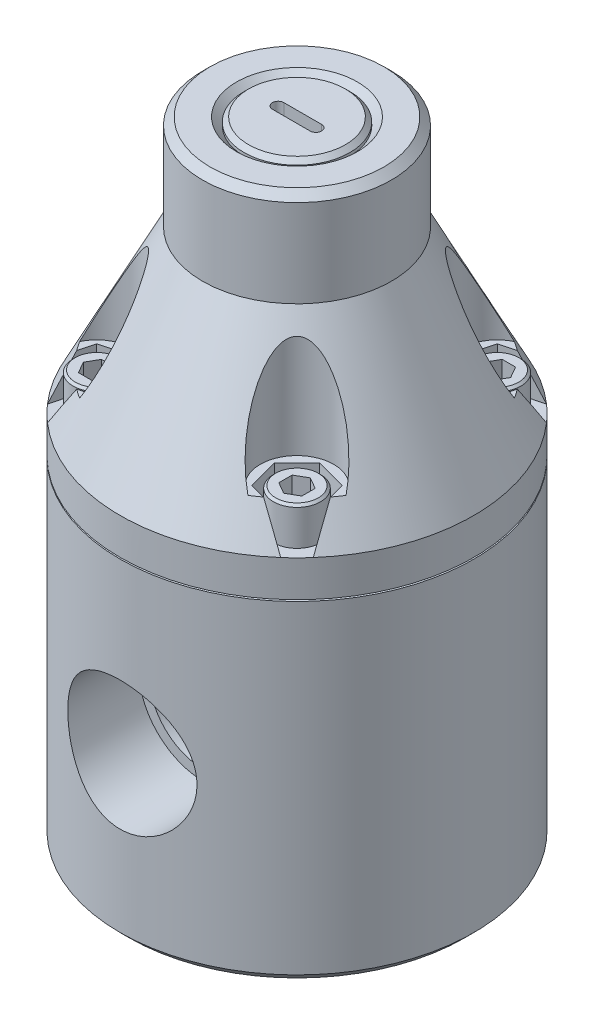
ISO-10303-21;
HEADER;
FILE_DESCRIPTION(('STEP AP214'),'2;1');
FILE_NAME('part.step','',(''),(''),'','','');
FILE_SCHEMA(('AUTOMOTIVE_DESIGN { 1 0 10303 214 1 1 1 1 }'));
ENDSEC;
DATA;
#1=APPLICATION_CONTEXT('core data for automotive mechanical design processes');
#2=APPLICATION_PROTOCOL_DEFINITION('international standard','automotive_design',2000,#1);
#3=PRODUCT_CONTEXT('',#1,'mechanical');
#4=PRODUCT('Part','Part','',(#3));
#5=PRODUCT_RELATED_PRODUCT_CATEGORY('part','',(#4));
#6=PRODUCT_DEFINITION_FORMATION('','',#4);
#7=PRODUCT_DEFINITION_CONTEXT('part definition',#1,'design');
#8=PRODUCT_DEFINITION('design','',#6,#7);
#9=PRODUCT_DEFINITION_SHAPE('','',#8);
#10=(LENGTH_UNIT() NAMED_UNIT(*) SI_UNIT(.MILLI.,.METRE.));
#11=(NAMED_UNIT(*) PLANE_ANGLE_UNIT() SI_UNIT($,.RADIAN.));
#12=(NAMED_UNIT(*) SI_UNIT($,.STERADIAN.) SOLID_ANGLE_UNIT());
#13=UNCERTAINTY_MEASURE_WITH_UNIT(LENGTH_MEASURE(1.E-05),#10,'distance_accuracy_value','');
#14=(GEOMETRIC_REPRESENTATION_CONTEXT(3) GLOBAL_UNCERTAINTY_ASSIGNED_CONTEXT((#13)) GLOBAL_UNIT_ASSIGNED_CONTEXT((#10,
#11,#12)) REPRESENTATION_CONTEXT('',''));
#15=CARTESIAN_POINT('',(0.,0.,0.));
#16=DIRECTION('',(0.,0.,1.));
#17=DIRECTION('',(1.,0.,0.));
#18=AXIS2_PLACEMENT_3D('',#15,#16,#17);
#19=CARTESIAN_POINT('',(0.,62.23,0.));
#20=DIRECTION('',(0.,-1.,0.));
#21=DIRECTION('',(0.,0.,-1.));
#22=AXIS2_PLACEMENT_3D('',#19,#20,#21);
#23=CONICAL_SURFACE('',#22,29.718,0.471096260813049);
#24=CARTESIAN_POINT('',(-22.3373805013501,62.2298,-19.6011992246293));
#25=CARTESIAN_POINT('',(-22.2547645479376,62.7634166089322,-19.2832519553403));
#26=CARTESIAN_POINT('',(-22.1717744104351,63.29612059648,-18.9638646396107));
#27=CARTESIAN_POINT('',(-22.0049530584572,64.3594037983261,-18.3218531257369));
#28=CARTESIAN_POINT('',(-21.9211218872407,64.8899831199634,-17.9992290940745));
#29=CARTESIAN_POINT('',(-21.7525165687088,65.9487768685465,-17.3503519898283));
#30=CARTESIAN_POINT('',(-21.6677424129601,66.4769912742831,-17.0240988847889));
#31=CARTESIAN_POINT('',(-21.4971243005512,67.5307185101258,-16.367475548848));
#32=CARTESIAN_POINT('',(-21.4112802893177,68.0562312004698,-16.0371051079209));
#33=CARTESIAN_POINT('',(-21.3248419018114,68.5802,-15.7044472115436));
#34=B_SPLINE_CURVE_WITH_KNOTS('',3,(#24,#25,#26,#27,#28,#29,#30,#31,#32,#33),.UNSPECIFIED.,.F.,
.F.,(4,2,2,2,4),(0.,1.87988537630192,3.75967455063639,5.63948054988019,7.51938283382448),.UNSPECIFIED.);
#35=CARTESIAN_POINT('',(-22.3373495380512,62.23,-19.6010800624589));
#36=VERTEX_POINT('',#35);
#37=CARTESIAN_POINT('',(-21.324874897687,68.58,-15.7045741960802));
#38=VERTEX_POINT('',#37);
#39=EDGE_CURVE('E627',#36,#38,#34,.T.);
#40=ORIENTED_EDGE('',*,*,#39,.F.);
#41=CARTESIAN_POINT('',(0.,62.23,0.));
#42=DIRECTION('',(0.,-1.,0.));
#43=DIRECTION('',(0.,0.,-1.));
#44=AXIS2_PLACEMENT_3D('',#41,#42,#43);
#45=CIRCLE('',#44,29.718);
#46=CARTESIAN_POINT('',(-22.3373495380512,62.23,19.6010800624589));
#47=VERTEX_POINT('',#46);
#48=EDGE_CURVE('E935',#47,#36,#45,.T.);
#49=ORIENTED_EDGE('',*,*,#48,.F.);
#50=CARTESIAN_POINT('',(-21.3248419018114,68.5802,15.7044472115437));
#51=CARTESIAN_POINT('',(-21.4112802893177,68.0562312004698,16.0371051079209));
#52=CARTESIAN_POINT('',(-21.4971243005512,67.5307185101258,16.367475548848));
#53=CARTESIAN_POINT('',(-21.66774241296,66.4769912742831,17.024098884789));
#54=CARTESIAN_POINT('',(-21.7525165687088,65.9487768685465,17.3503519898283));
#55=CARTESIAN_POINT('',(-21.9211218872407,64.8899831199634,17.9992290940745));
#56=CARTESIAN_POINT('',(-22.0049530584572,64.3594037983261,18.3218531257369));
#57=CARTESIAN_POINT('',(-22.1717744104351,63.29612059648,18.9638646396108));
#58=CARTESIAN_POINT('',(-22.2547645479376,62.7634166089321,19.2832519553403));
#59=CARTESIAN_POINT('',(-22.3373805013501,62.2298,19.6011992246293));
#60=B_SPLINE_CURVE_WITH_KNOTS('',3,(#50,#51,#52,#53,#54,#55,#56,#57,#58,#59),.UNSPECIFIED.,.F.,
.F.,(4,2,2,2,4),(0.,1.87990228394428,3.75970828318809,5.63949745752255,7.51938283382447),.UNSPECIFIED.);
#61=CARTESIAN_POINT('',(-21.324874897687,68.58,15.7045741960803));
#62=VERTEX_POINT('',#61);
#63=EDGE_CURVE('E681',#62,#47,#60,.T.);
#64=ORIENTED_EDGE('',*,*,#63,.F.);
#65=CARTESIAN_POINT('',(0.,68.58,0.));
#66=DIRECTION('',(0.,1.,0.));
#67=DIRECTION('',(0.,0.,1.));
#68=AXIS2_PLACEMENT_3D('',#65,#66,#67);
#69=CIRCLE('',#68,26.4836542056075);
#70=CARTESIAN_POINT('',(-22.3908779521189,68.58,14.1432854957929));
#71=VERTEX_POINT('',#70);
#72=EDGE_CURVE('E1431',#62,#71,#69,.F.);
#73=ORIENTED_EDGE('',*,*,#72,.T.);
#74=CARTESIAN_POINT('',(-22.3909303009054,68.5798,14.143393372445));
#75=CARTESIAN_POINT('',(-22.350304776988,68.7350022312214,14.0596815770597));
#76=CARTESIAN_POINT('',(-22.3081630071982,68.89069928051,13.9776470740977));
#77=CARTESIAN_POINT('',(-22.2210302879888,69.2029732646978,13.8168553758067));
#78=CARTESIAN_POINT('',(-22.1760395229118,69.3595501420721,13.7380979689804));
#79=CARTESIAN_POINT('',(-22.0370947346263,69.8303500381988,13.5066666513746));
#80=CARTESIAN_POINT('',(-21.9391379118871,70.1457572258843,13.3587718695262));
#81=CARTESIAN_POINT('',(-21.7338262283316,70.7787217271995,13.0753567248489));
#82=CARTESIAN_POINT('',(-21.6264783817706,71.0962772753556,12.9398272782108));
#83=CARTESIAN_POINT('',(-21.4032338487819,71.7332404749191,12.6806046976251));
#84=CARTESIAN_POINT('',(-21.2873363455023,72.0526483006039,12.556912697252));
#85=CARTESIAN_POINT('',(-21.0470421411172,72.6946343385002,12.3204109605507));
#86=CARTESIAN_POINT('',(-20.9226003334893,73.0172202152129,12.2076680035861));
#87=CARTESIAN_POINT('',(-20.6663853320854,73.6632945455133,11.9936819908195));
#88=CARTESIAN_POINT('',(-20.5346119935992,73.9867830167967,11.8924391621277));
#89=CARTESIAN_POINT('',(-20.2641447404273,74.6342665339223,11.7013595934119));
#90=CARTESIAN_POINT('',(-20.1254503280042,74.9582616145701,11.6115236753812));
#91=CARTESIAN_POINT('',(-19.8414364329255,75.6062899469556,11.4433041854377));
#92=CARTESIAN_POINT('',(-19.6961171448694,75.9303231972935,11.3649202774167));
#93=CARTESIAN_POINT('',(-19.3211632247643,76.7476954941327,11.1817059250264));
#94=CARTESIAN_POINT('',(-19.0872302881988,77.2408247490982,11.0845248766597));
#95=CARTESIAN_POINT('',(-18.7249280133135,77.9784605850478,10.9599064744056));
#96=CARTESIAN_POINT('',(-18.6022415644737,78.2240315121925,10.9218885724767));
#97=CARTESIAN_POINT('',(-18.3529388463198,78.7141977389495,10.8531925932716));
#98=CARTESIAN_POINT('',(-18.2263228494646,78.9587931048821,10.8225140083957));
#99=CARTESIAN_POINT('',(-17.9690231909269,79.4465771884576,10.7688733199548));
#100=CARTESIAN_POINT('',(-17.8383410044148,79.6897663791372,10.7459084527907));
#101=CARTESIAN_POINT('',(-17.5726008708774,80.1743656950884,10.7081842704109));
#102=CARTESIAN_POINT('',(-17.4375433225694,80.4157759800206,10.693424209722));
#103=CARTESIAN_POINT('',(-17.1627429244,80.8961071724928,10.6727907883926));
#104=CARTESIAN_POINT('',(-17.0230031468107,81.1350295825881,10.6669117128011));
#105=CARTESIAN_POINT('',(-16.7382475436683,81.6097183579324,10.6649433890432));
#106=CARTESIAN_POINT('',(-16.5932325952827,81.8454852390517,10.6688525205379));
#107=CARTESIAN_POINT('',(-16.2968182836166,82.3133650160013,10.6877509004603));
#108=CARTESIAN_POINT('',(-16.1454043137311,82.5454676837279,10.7027669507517));
#109=CARTESIAN_POINT('',(-15.8354539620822,83.0038758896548,10.7457309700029));
#110=CARTESIAN_POINT('',(-15.6769137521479,83.2301782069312,10.7736859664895));
#111=CARTESIAN_POINT('',(-15.3515270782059,83.6741617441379,10.8451251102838));
#112=CARTESIAN_POINT('',(-15.1846866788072,83.8918490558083,10.8885980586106));
#113=CARTESIAN_POINT('',(-14.9269806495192,84.2084557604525,10.9683843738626));
#114=CARTESIAN_POINT('',(-14.839881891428,84.3122892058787,10.997391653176));
#115=CARTESIAN_POINT('',(-14.6629301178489,84.515808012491,11.0609509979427));
#116=CARTESIAN_POINT('',(-14.5730777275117,84.6154943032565,11.0955018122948));
#117=CARTESIAN_POINT('',(-14.3891167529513,84.8109037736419,11.1714874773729));
#118=CARTESIAN_POINT('',(-14.2949676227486,84.9065572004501,11.2130072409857));
#119=CARTESIAN_POINT('',(-14.1034347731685,85.0907355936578,11.3035808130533));
#120=CARTESIAN_POINT('',(-14.0060494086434,85.1792568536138,11.3526385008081));
#121=CARTESIAN_POINT('',(-13.7101223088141,85.429646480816,11.5123405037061));
#122=CARTESIAN_POINT('',(-13.5060546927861,85.5782916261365,11.6361944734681));
#123=CARTESIAN_POINT('',(-13.1996116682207,85.7493306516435,11.8507095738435));
#124=CARTESIAN_POINT('',(-13.0998509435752,85.7971000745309,11.9248690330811));
#125=CARTESIAN_POINT('',(-12.900706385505,85.873763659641,12.0829789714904));
#126=CARTESIAN_POINT('',(-12.8013223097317,85.9026733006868,12.1669213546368));
#127=CARTESIAN_POINT('',(-12.6053038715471,85.9385908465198,12.3437610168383));
#128=CARTESIAN_POINT('',(-12.5086917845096,85.9454540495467,12.4367133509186));
#129=CARTESIAN_POINT('',(-12.3223166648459,85.9359739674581,12.6281475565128));
#130=CARTESIAN_POINT('',(-12.2325552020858,85.9196253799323,12.7266306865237));
#131=CARTESIAN_POINT('',(-12.0684910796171,85.8677160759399,12.9184346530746));
#132=CARTESIAN_POINT('',(-11.9935403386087,85.8336265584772,13.0116153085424));
#133=CARTESIAN_POINT('',(-11.8522698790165,85.7502029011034,13.1975950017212));
#134=CARTESIAN_POINT('',(-11.7859543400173,85.7008614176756,13.290393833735));
#135=CARTESIAN_POINT('',(-11.6163662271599,85.5496530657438,13.5413620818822));
#136=CARTESIAN_POINT('',(-11.5214197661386,85.4357254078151,13.6978402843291));
#137=CARTESIAN_POINT('',(-11.3524385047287,85.1845941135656,14.0032728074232));
#138=CARTESIAN_POINT('',(-11.2784789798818,85.0473094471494,14.1521985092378));
#139=CARTESIAN_POINT('',(-11.1484302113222,84.7600134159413,14.44015441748));
#140=CARTESIAN_POINT('',(-11.0920802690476,84.6102339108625,14.5793027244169));
#141=CARTESIAN_POINT('',(-10.9925096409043,84.3006741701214,14.851149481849));
#142=CARTESIAN_POINT('',(-10.9493023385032,84.1408839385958,14.9838412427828));
#143=CARTESIAN_POINT('',(-10.8736636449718,83.8139640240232,15.2438249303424));
#144=CARTESIAN_POINT('',(-10.8412572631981,83.6468183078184,15.3711037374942));
#145=CARTESIAN_POINT('',(-10.7856662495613,83.307480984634,15.6206584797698));
#146=CARTESIAN_POINT('',(-10.7624784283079,83.1352911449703,15.7429361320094));
#147=CARTESIAN_POINT('',(-10.7205377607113,82.7552655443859,16.0051192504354));
#148=CARTESIAN_POINT('',(-10.7033691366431,82.5466647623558,16.1441638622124));
#149=CARTESIAN_POINT('',(-10.6786273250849,82.125493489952,16.4170496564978));
#150=CARTESIAN_POINT('',(-10.6710565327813,81.9129220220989,16.5508895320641));
#151=CARTESIAN_POINT('',(-10.664422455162,81.4846459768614,16.8140587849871));
#152=CARTESIAN_POINT('',(-10.6653663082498,81.2689389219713,16.9433842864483));
#153=CARTESIAN_POINT('',(-10.674967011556,80.8352423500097,17.1978874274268));
#154=CARTESIAN_POINT('',(-10.6836247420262,80.6172525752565,17.323064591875));
#155=CARTESIAN_POINT('',(-10.7080782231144,80.178919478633,17.5699535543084));
#156=CARTESIAN_POINT('',(-10.7238938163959,79.9585712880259,17.691654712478));
#157=CARTESIAN_POINT('',(-10.7622068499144,79.516512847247,17.9314908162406));
#158=CARTESIAN_POINT('',(-10.7847047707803,79.2948025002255,18.0496255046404));
#159=CARTESIAN_POINT('',(-10.8616544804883,78.628245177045,18.3989144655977));
#160=CARTESIAN_POINT('',(-10.9255713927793,78.1818168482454,18.6250403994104));
#161=CARTESIAN_POINT('',(-11.0664102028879,77.3479438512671,19.0346218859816));
#162=CARTESIAN_POINT('',(-11.1403619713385,76.9607742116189,19.2196861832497));
#163=CARTESIAN_POINT('',(-11.3050181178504,76.1856258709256,19.5805572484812));
#164=CARTESIAN_POINT('',(-11.3957241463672,75.7976470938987,19.7563631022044));
#165=CARTESIAN_POINT('',(-11.5935742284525,75.0216151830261,20.0985507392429));
#166=CARTESIAN_POINT('',(-11.7007221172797,74.6335620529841,20.264930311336));
#167=CARTESIAN_POINT('',(-11.9313879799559,73.8581881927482,20.5877481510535));
#168=CARTESIAN_POINT('',(-12.0549056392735,73.470867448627,20.7441866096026));
#169=CARTESIAN_POINT('',(-12.3163714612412,72.7038997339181,21.0439307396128));
#170=CARTESIAN_POINT('',(-12.4540552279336,72.3242296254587,21.1874073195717));
#171=CARTESIAN_POINT('',(-12.7458005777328,71.5671030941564,21.4629534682));
#172=CARTESIAN_POINT('',(-12.8998598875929,71.1896463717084,21.5950246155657));
#173=CARTESIAN_POINT('',(-13.2250025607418,70.4376533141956,21.8464430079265));
#174=CARTESIAN_POINT('',(-13.396090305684,70.0631177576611,21.9657869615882));
#175=CARTESIAN_POINT('',(-13.6660711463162,69.5043911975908,22.1338540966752));
#176=CARTESIAN_POINT('',(-13.7583155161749,69.3186135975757,22.1880644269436));
#177=CARTESIAN_POINT('',(-13.9473861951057,68.9482602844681,22.2925349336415));
#178=CARTESIAN_POINT('',(-14.044212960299,68.7636846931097,22.3427947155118));
#179=CARTESIAN_POINT('',(-14.1433933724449,68.5798000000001,22.3909303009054));
#180=B_SPLINE_CURVE_WITH_KNOTS('',3,(#74,#75,#76,#77,#78,#79,#80,#81,#82,#83,#84,#85,#86,#87,
#88,#89,#90,#91,#92,#93,#94,#95,#96,#97,#98,#99,#100,#101,#102,#103,#104,#105,#106,#107,#108,
#109,#110,#111,#112,#113,#114,#115,#116,#117,#118,#119,#120,#121,#122,#123,#124,#125,#126,#127,
#128,#129,#130,#131,#132,#133,#134,#135,#136,#137,#138,#139,#140,#141,#142,#143,#144,#145,#146,
#147,#148,#149,#150,#151,#152,#153,#154,#155,#156,#157,#158,#159,#160,#161,#162,#163,#164,#165,
#166,#167,#168,#169,#170,#171,#172,#173,#174,#175,#176,#177,#178,#179),.UNSPECIFIED.,.F.,.F.,(4,
2,2,2,2,2,2,2,2,2,2,2,2,2,2,2,2,2,2,2,2,2,2,2,2,2,2,2,2,2,2,2,2,2,2,2,2,2,2,2,2,2,2,2,2,2,2,2,2,
2,2,2,4),(0.,0.542840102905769,1.08564511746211,2.17085376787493,3.25525867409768,
4.33976732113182,5.43052218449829,6.5212985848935,7.61215354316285,8.70297647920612,
10.3650975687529,11.196398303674,12.027641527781,12.8585866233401,13.6894562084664,
14.5197908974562,15.3499881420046,16.1821952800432,17.014854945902,17.8469149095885,
18.2625409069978,18.6780732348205,19.0990950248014,19.5203342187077,20.354755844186,
20.7529146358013,21.1507462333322,21.5511837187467,21.9517126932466,22.32334462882,
22.6951557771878,23.3381727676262,23.9834677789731,24.6186994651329,25.2545758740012,
25.8919145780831,26.5290325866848,27.2825500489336,28.0362555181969,28.7905929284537,
29.5450164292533,30.3015442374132,31.0581264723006,32.5707579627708,33.8767149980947,
35.1828007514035,36.4891916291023,37.7955574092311,39.0808873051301,40.3660390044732,
41.6515222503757,42.2946005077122,42.9377429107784),.UNSPECIFIED.);
#181=CARTESIAN_POINT('',(-14.1432854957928,68.58,22.390877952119));
#182=VERTEX_POINT('',#181);
#183=EDGE_CURVE('E1425',#71,#182,#180,.T.);
#184=ORIENTED_EDGE('',*,*,#183,.T.);
#185=CARTESIAN_POINT('',(-15.7045741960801,68.58,21.3248748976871));
#186=VERTEX_POINT('',#185);
#187=EDGE_CURVE('E1358',#182,#186,#69,.F.);
#188=ORIENTED_EDGE('',*,*,#187,.T.);
#189=CARTESIAN_POINT('',(-19.6011992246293,62.2298,22.3373805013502));
#190=CARTESIAN_POINT('',(-19.2832519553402,62.7634166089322,22.2547645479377));
#191=CARTESIAN_POINT('',(-18.9638646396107,63.29612059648,22.1717744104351));
#192=CARTESIAN_POINT('',(-18.3218531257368,64.3594037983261,22.0049530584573));
#193=CARTESIAN_POINT('',(-17.9992290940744,64.8899831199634,21.9211218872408));
#194=CARTESIAN_POINT('',(-17.3503519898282,65.9487768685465,21.7525165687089));
#195=CARTESIAN_POINT('',(-17.0240988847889,66.4769912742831,21.6677424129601));
#196=CARTESIAN_POINT('',(-16.3674755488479,67.5307185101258,21.4971243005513));
#197=CARTESIAN_POINT('',(-16.0371051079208,68.0562312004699,21.4112802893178));
#198=CARTESIAN_POINT('',(-15.7044472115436,68.5802,21.3248419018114));
#199=B_SPLINE_CURVE_WITH_KNOTS('',3,(#189,#190,#191,#192,#193,#194,#195,#196,#197,#198),
.UNSPECIFIED.,.F.,.F.,(4,2,2,2,4),(0.,1.87988537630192,3.75967455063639,5.63948054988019,
7.51938283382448),.UNSPECIFIED.);
#200=CARTESIAN_POINT('',(-19.6010800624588,62.23,22.3373495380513));
#201=VERTEX_POINT('',#200);
#202=EDGE_CURVE('E674',#201,#186,#199,.T.);
#203=ORIENTED_EDGE('',*,*,#202,.F.);
#204=CARTESIAN_POINT('',(19.601080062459,62.23,22.3373495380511));
#205=VERTEX_POINT('',#204);
#206=EDGE_CURVE('E948',#205,#201,#45,.T.);
#207=ORIENTED_EDGE('',*,*,#206,.F.);
#208=CARTESIAN_POINT('',(15.7044472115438,68.5802,21.3248419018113));
#209=CARTESIAN_POINT('',(16.037105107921,68.0562312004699,21.4112802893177));
#210=CARTESIAN_POINT('',(16.3674755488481,67.5307185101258,21.4971243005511));
#211=CARTESIAN_POINT('',(17.024098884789,66.4769912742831,21.66774241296));
#212=CARTESIAN_POINT('',(17.3503519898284,65.9487768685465,21.7525165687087));
#213=CARTESIAN_POINT('',(17.9992290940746,64.8899831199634,21.9211218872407));
#214=CARTESIAN_POINT('',(18.321853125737,64.3594037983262,22.0049530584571));
#215=CARTESIAN_POINT('',(18.9638646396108,63.29612059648,22.171774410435));
#216=CARTESIAN_POINT('',(19.2832519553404,62.7634166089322,22.2547645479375));
#217=CARTESIAN_POINT('',(19.6011992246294,62.2298,22.33738050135));
#218=B_SPLINE_CURVE_WITH_KNOTS('',3,(#208,#209,#210,#211,#212,#213,#214,#215,#216,#217),
.UNSPECIFIED.,.F.,.F.,(4,2,2,2,4),(0.,1.87990228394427,3.75970828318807,5.63949745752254,
7.51938283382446),.UNSPECIFIED.);
#219=CARTESIAN_POINT('',(15.7045741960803,68.58,21.3248748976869));
#220=VERTEX_POINT('',#219);
#221=EDGE_CURVE('E712',#220,#205,#218,.T.);
#222=ORIENTED_EDGE('',*,*,#221,.F.);
#223=CARTESIAN_POINT('',(0.,68.58,0.));
#224=DIRECTION('',(0.,1.,0.));
#225=DIRECTION('',(0.,0.,1.));
#226=AXIS2_PLACEMENT_3D('',#223,#224,#225);
#227=CIRCLE('',#226,26.4836542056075);
#228=CARTESIAN_POINT('',(14.143285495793,68.58,22.3908779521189));
#229=VERTEX_POINT('',#228);
#230=EDGE_CURVE('E979',#220,#229,#227,.F.);
#231=ORIENTED_EDGE('',*,*,#230,.T.);
#232=CARTESIAN_POINT('',(14.1433933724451,68.5798,22.3909303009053));
#233=CARTESIAN_POINT('',(14.0596815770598,68.7350022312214,22.3503047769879));
#234=CARTESIAN_POINT('',(13.9776470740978,68.89069928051,22.3081630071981));
#235=CARTESIAN_POINT('',(13.8168553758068,69.2029732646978,22.2210302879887));
#236=CARTESIAN_POINT('',(13.7380979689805,69.3595501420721,22.1760395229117));
#237=CARTESIAN_POINT('',(13.5066666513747,69.8303500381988,22.0370947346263));
#238=CARTESIAN_POINT('',(13.3587718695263,70.1457572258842,21.939137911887));
#239=CARTESIAN_POINT('',(13.075356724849,70.7787217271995,21.7338262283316));
#240=CARTESIAN_POINT('',(12.9398272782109,71.0962772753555,21.6264783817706));
#241=CARTESIAN_POINT('',(12.6806046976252,71.7332404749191,21.4032338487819));
#242=CARTESIAN_POINT('',(12.5569126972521,72.0526483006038,21.2873363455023));
#243=CARTESIAN_POINT('',(12.3204109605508,72.6946343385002,21.0470421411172));
#244=CARTESIAN_POINT('',(12.2076680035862,73.0172202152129,20.9226003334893));
#245=CARTESIAN_POINT('',(11.9936819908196,73.6632945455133,20.6663853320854));
#246=CARTESIAN_POINT('',(11.8924391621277,73.9867830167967,20.5346119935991));
#247=CARTESIAN_POINT('',(11.7013595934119,74.6342665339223,20.2641447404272));
#248=CARTESIAN_POINT('',(11.6115236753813,74.9582616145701,20.1254503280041));
#249=CARTESIAN_POINT('',(11.4433041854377,75.6062899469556,19.8414364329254));
#250=CARTESIAN_POINT('',(11.3649202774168,75.9303231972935,19.6961171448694));
#251=CARTESIAN_POINT('',(11.1817059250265,76.7476954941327,19.3211632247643));
#252=CARTESIAN_POINT('',(11.0845248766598,77.2408247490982,19.0872302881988));
#253=CARTESIAN_POINT('',(10.9599064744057,77.9784605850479,18.7249280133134));
#254=CARTESIAN_POINT('',(10.9218885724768,78.2240315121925,18.6022415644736));
#255=CARTESIAN_POINT('',(10.8531925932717,78.7141977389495,18.3529388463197));
#256=CARTESIAN_POINT('',(10.8225140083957,78.9587931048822,18.2263228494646));
#257=CARTESIAN_POINT('',(10.7688733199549,79.4465771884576,17.9690231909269));
#258=CARTESIAN_POINT('',(10.7459084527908,79.6897663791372,17.8383410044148));
#259=CARTESIAN_POINT('',(10.7081842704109,80.1743656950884,17.5726008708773));
#260=CARTESIAN_POINT('',(10.6934242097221,80.4157759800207,17.4375433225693));
#261=CARTESIAN_POINT('',(10.6727907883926,80.8961071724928,17.1627429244));
#262=CARTESIAN_POINT('',(10.6669117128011,81.1350295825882,17.0230031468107));
#263=CARTESIAN_POINT('',(10.6649433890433,81.6097183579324,16.7382475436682));
#264=CARTESIAN_POINT('',(10.668852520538,81.8454852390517,16.5932325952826));
#265=CARTESIAN_POINT('',(10.6877509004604,82.3133650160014,16.2968182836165));
#266=CARTESIAN_POINT('',(10.7027669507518,82.545467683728,16.1454043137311));
#267=CARTESIAN_POINT('',(10.745730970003,83.0038758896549,15.8354539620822));
#268=CARTESIAN_POINT('',(10.7736859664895,83.2301782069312,15.6769137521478));
#269=CARTESIAN_POINT('',(10.8451251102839,83.6741617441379,15.3515270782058));
#270=CARTESIAN_POINT('',(10.8885980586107,83.8918490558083,15.1846866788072));
#271=CARTESIAN_POINT('',(10.9683843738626,84.2084557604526,14.9269806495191));
#272=CARTESIAN_POINT('',(10.997391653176,84.3122892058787,14.8398818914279));
#273=CARTESIAN_POINT('',(11.0609509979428,84.515808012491,14.6629301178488));
#274=CARTESIAN_POINT('',(11.0955018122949,84.6154943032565,14.5730777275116));
#275=CARTESIAN_POINT('',(11.171487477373,84.8109037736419,14.3891167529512));
#276=CARTESIAN_POINT('',(11.2130072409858,84.9065572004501,14.2949676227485));
#277=CARTESIAN_POINT('',(11.3035808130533,85.0907355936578,14.1034347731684));
#278=CARTESIAN_POINT('',(11.3526385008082,85.1792568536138,14.0060494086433));
#279=CARTESIAN_POINT('',(11.5123405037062,85.4296464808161,13.710122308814));
#280=CARTESIAN_POINT('',(11.6361944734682,85.5782916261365,13.506054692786));
#281=CARTESIAN_POINT('',(11.8507095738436,85.7493306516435,13.1996116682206));
#282=CARTESIAN_POINT('',(11.9248690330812,85.797100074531,13.0998509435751));
#283=CARTESIAN_POINT('',(12.0829789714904,85.873763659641,12.9007063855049));
#284=CARTESIAN_POINT('',(12.1669213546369,85.9026733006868,12.8013223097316));
#285=CARTESIAN_POINT('',(12.3437610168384,85.9385908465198,12.605303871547));
#286=CARTESIAN_POINT('',(12.4367133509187,85.9454540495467,12.5086917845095));
#287=CARTESIAN_POINT('',(12.6281475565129,85.9359739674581,12.3223166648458));
#288=CARTESIAN_POINT('',(12.7266306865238,85.9196253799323,12.2325552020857));
#289=CARTESIAN_POINT('',(12.9184346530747,85.8677160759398,12.068491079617));
#290=CARTESIAN_POINT('',(13.0116153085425,85.8336265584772,11.9935403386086));
#291=CARTESIAN_POINT('',(13.1975950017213,85.7502029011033,11.8522698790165));
#292=CARTESIAN_POINT('',(13.2903938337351,85.7008614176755,11.7859543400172));
#293=CARTESIAN_POINT('',(13.5413620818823,85.5496530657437,11.6163662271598));
#294=CARTESIAN_POINT('',(13.6978402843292,85.435725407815,11.5214197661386));
#295=CARTESIAN_POINT('',(14.0032728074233,85.1845941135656,11.3524385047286));
#296=CARTESIAN_POINT('',(14.1521985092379,85.0473094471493,11.2784789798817));
#297=CARTESIAN_POINT('',(14.4401544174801,84.7600134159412,11.1484302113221));
#298=CARTESIAN_POINT('',(14.579302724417,84.6102339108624,11.0920802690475));
#299=CARTESIAN_POINT('',(14.8511494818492,84.3006741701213,10.9925096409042));
#300=CARTESIAN_POINT('',(14.983841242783,84.1408839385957,10.9493023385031));
#301=CARTESIAN_POINT('',(15.2438249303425,83.813964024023,10.8736636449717));
#302=CARTESIAN_POINT('',(15.3711037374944,83.6468183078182,10.841257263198));
#303=CARTESIAN_POINT('',(15.62065847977,83.3074809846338,10.7856662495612));
#304=CARTESIAN_POINT('',(15.7429361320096,83.1352911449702,10.7624784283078));
#305=CARTESIAN_POINT('',(16.0051192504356,82.7552655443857,10.7205377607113));
#306=CARTESIAN_POINT('',(16.1441638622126,82.5466647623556,10.703369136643));
#307=CARTESIAN_POINT('',(16.417049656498,82.1254934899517,10.6786273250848));
#308=CARTESIAN_POINT('',(16.5508895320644,81.9129220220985,10.6710565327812));
#309=CARTESIAN_POINT('',(16.8140587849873,81.4846459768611,10.6644224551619));
#310=CARTESIAN_POINT('',(16.9433842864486,81.2689389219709,10.6653663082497));
#311=CARTESIAN_POINT('',(17.1978874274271,80.8352423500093,10.674967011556));
#312=CARTESIAN_POINT('',(17.3230645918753,80.6172525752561,10.6836247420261));
#313=CARTESIAN_POINT('',(17.5699535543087,80.1789194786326,10.7080782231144));
#314=CARTESIAN_POINT('',(17.6916547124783,79.9585712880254,10.7238938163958));
#315=CARTESIAN_POINT('',(17.9314908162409,79.5165128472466,10.7622068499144));
#316=CARTESIAN_POINT('',(18.0496255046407,79.294802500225,10.7847047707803));
#317=CARTESIAN_POINT('',(18.398914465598,78.6282451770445,10.8616544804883));
#318=CARTESIAN_POINT('',(18.6250403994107,78.1818168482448,10.9255713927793));
#319=CARTESIAN_POINT('',(19.0346218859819,77.3479438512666,11.0664102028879));
#320=CARTESIAN_POINT('',(19.21968618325,76.9607742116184,11.1403619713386));
#321=CARTESIAN_POINT('',(19.5805572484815,76.1856258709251,11.3050181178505));
#322=CARTESIAN_POINT('',(19.7563631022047,75.7976470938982,11.3957241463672));
#323=CARTESIAN_POINT('',(20.0985507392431,75.0216151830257,11.5935742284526));
#324=CARTESIAN_POINT('',(20.2649303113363,74.6335620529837,11.7007221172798));
#325=CARTESIAN_POINT('',(20.5877481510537,73.8581881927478,11.9313879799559));
#326=CARTESIAN_POINT('',(20.7441866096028,73.4708674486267,12.0549056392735));
#327=CARTESIAN_POINT('',(21.0439307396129,72.7038997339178,12.3163714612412));
#328=CARTESIAN_POINT('',(21.1874073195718,72.3242296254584,12.4540552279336));
#329=CARTESIAN_POINT('',(21.4629534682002,71.5671030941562,12.7458005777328));
#330=CARTESIAN_POINT('',(21.5950246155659,71.1896463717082,12.8998598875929));
#331=CARTESIAN_POINT('',(21.8464430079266,70.4376533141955,13.2250025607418));
#332=CARTESIAN_POINT('',(21.9657869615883,70.0631177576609,13.396090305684));
#333=CARTESIAN_POINT('',(22.1338540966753,69.5043911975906,13.6660711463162));
#334=CARTESIAN_POINT('',(22.1880644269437,69.3186135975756,13.7583155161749));
#335=CARTESIAN_POINT('',(22.2925349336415,68.948260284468,13.9473861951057));
#336=CARTESIAN_POINT('',(22.3427947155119,68.7636846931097,14.0442129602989));
#337=CARTESIAN_POINT('',(22.3909303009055,68.5798,14.1433933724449));
#338=B_SPLINE_CURVE_WITH_KNOTS('',3,(#232,#233,#234,#235,#236,#237,#238,#239,#240,#241,#242,
#243,#244,#245,#246,#247,#248,#249,#250,#251,#252,#253,#254,#255,#256,#257,#258,#259,#260,#261,
#262,#263,#264,#265,#266,#267,#268,#269,#270,#271,#272,#273,#274,#275,#276,#277,#278,#279,#280,
#281,#282,#283,#284,#285,#286,#287,#288,#289,#290,#291,#292,#293,#294,#295,#296,#297,#298,#299,
#300,#301,#302,#303,#304,#305,#306,#307,#308,#309,#310,#311,#312,#313,#314,#315,#316,#317,#318,
#319,#320,#321,#322,#323,#324,#325,#326,#327,#328,#329,#330,#331,#332,#333,#334,#335,#336,#337),
.UNSPECIFIED.,.F.,.F.,(4,2,2,2,2,2,2,2,2,2,2,2,2,2,2,2,2,2,2,2,2,2,2,2,2,2,2,2,2,2,2,2,2,2,2,2,
2,2,2,2,2,2,2,2,2,2,2,2,2,2,2,2,4),(0.,0.542840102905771,1.08564511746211,2.17085376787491,
3.25525867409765,4.3397673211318,5.43052218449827,6.52129858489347,7.61215354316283,
8.7029764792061,10.3650975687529,11.196398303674,12.0276415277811,12.8585866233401,
13.6894562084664,14.5197908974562,15.3499881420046,16.1821952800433,17.0148549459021,
17.8469149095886,18.2625409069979,18.6780732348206,19.0990950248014,19.5203342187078,
20.3547558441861,20.7529146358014,21.1507462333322,21.5511837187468,21.9517126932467,
22.3233446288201,22.6951557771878,23.3381727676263,23.9834677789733,24.618699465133,
25.2545758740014,25.8919145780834,26.529032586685,27.2825500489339,28.0362555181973,
28.7905929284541,29.5450164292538,30.3015442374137,31.0581264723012,32.5707579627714,
33.8767149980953,35.182800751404,36.4891916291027,37.7955574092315,39.0808873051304,
40.3660390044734,41.6515222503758,42.2946005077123,42.9377429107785),.UNSPECIFIED.);
#339=CARTESIAN_POINT('',(22.390877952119,68.58,14.1432854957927));
#340=VERTEX_POINT('',#339);
#341=EDGE_CURVE('E1432',#229,#340,#338,.T.);
#342=ORIENTED_EDGE('',*,*,#341,.T.);
#343=CARTESIAN_POINT('',(21.3248748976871,68.58,15.7045741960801));
#344=VERTEX_POINT('',#343);
#345=EDGE_CURVE('E989',#340,#344,#227,.F.);
#346=ORIENTED_EDGE('',*,*,#345,.T.);
#347=CARTESIAN_POINT('',(22.3373805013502,62.2298,19.6011992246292));
#348=CARTESIAN_POINT('',(22.2547645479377,62.7634166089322,19.2832519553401));
#349=CARTESIAN_POINT('',(22.1717744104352,63.29612059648,18.9638646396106));
#350=CARTESIAN_POINT('',(22.0049530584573,64.3594037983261,18.3218531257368));
#351=CARTESIAN_POINT('',(21.9211218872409,64.8899831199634,17.9992290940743));
#352=CARTESIAN_POINT('',(21.752516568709,65.9487768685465,17.3503519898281));
#353=CARTESIAN_POINT('',(21.6677424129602,66.4769912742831,17.0240988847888));
#354=CARTESIAN_POINT('',(21.4971243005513,67.5307185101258,16.3674755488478));
#355=CARTESIAN_POINT('',(21.4112802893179,68.0562312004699,16.0371051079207));
#356=CARTESIAN_POINT('',(21.3248419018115,68.5802,15.7044472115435));
#357=B_SPLINE_CURVE_WITH_KNOTS('',3,(#347,#348,#349,#350,#351,#352,#353,#354,#355,#356),
.UNSPECIFIED.,.F.,.F.,(4,2,2,2,4),(0.,1.87988537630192,3.75967455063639,5.63948054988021,
7.51938283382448),.UNSPECIFIED.);
#358=CARTESIAN_POINT('',(22.3373495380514,62.23,19.6010800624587));
#359=VERTEX_POINT('',#358);
#360=EDGE_CURVE('E725',#359,#344,#357,.T.);
#361=ORIENTED_EDGE('',*,*,#360,.F.);
#362=CARTESIAN_POINT('',(22.3373495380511,62.23,-19.6010800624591));
#363=VERTEX_POINT('',#362);
#364=EDGE_CURVE('E854',#363,#359,#45,.T.);
#365=ORIENTED_EDGE('',*,*,#364,.F.);
#366=CARTESIAN_POINT('',(21.3248419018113,68.5802,-15.7044472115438));
#367=CARTESIAN_POINT('',(21.4112802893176,68.0562312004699,-16.037105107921));
#368=CARTESIAN_POINT('',(21.4971243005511,67.5307185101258,-16.3674755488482));
#369=CARTESIAN_POINT('',(21.6677424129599,66.4769912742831,-17.0240988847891));
#370=CARTESIAN_POINT('',(21.7525165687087,65.9487768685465,-17.3503519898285));
#371=CARTESIAN_POINT('',(21.9211218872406,64.8899831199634,-17.9992290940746));
#372=CARTESIAN_POINT('',(22.004953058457,64.3594037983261,-18.3218531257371));
#373=CARTESIAN_POINT('',(22.1717744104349,63.29612059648,-18.9638646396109));
#374=CARTESIAN_POINT('',(22.2547645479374,62.7634166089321,-19.2832519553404));
#375=CARTESIAN_POINT('',(22.3373805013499,62.2298,-19.6011992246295));
#376=B_SPLINE_CURVE_WITH_KNOTS('',3,(#366,#367,#368,#369,#370,#371,#372,#373,#374,#375),
.UNSPECIFIED.,.F.,.F.,(4,2,2,2,4),(0.,1.87990228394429,3.75970828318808,5.63949745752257,
7.51938283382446),.UNSPECIFIED.);
#377=CARTESIAN_POINT('',(21.3248748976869,68.58,-15.7045741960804));
#378=VERTEX_POINT('',#377);
#379=EDGE_CURVE('E774',#378,#363,#376,.T.);
#380=ORIENTED_EDGE('',*,*,#379,.F.);
#381=CARTESIAN_POINT('',(0.,68.58,0.));
#382=DIRECTION('',(0.,1.,0.));
#383=DIRECTION('',(0.,0.,1.));
#384=AXIS2_PLACEMENT_3D('',#381,#382,#383);
#385=CIRCLE('',#384,26.4836542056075);
#386=CARTESIAN_POINT('',(22.3908779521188,68.58,-14.1432854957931));
#387=VERTEX_POINT('',#386);
#388=EDGE_CURVE('E977',#378,#387,#385,.F.);
#389=ORIENTED_EDGE('',*,*,#388,.T.);
#390=CARTESIAN_POINT('',(22.3909303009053,68.5798000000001,-14.1433933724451));
#391=CARTESIAN_POINT('',(22.3503047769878,68.7350022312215,-14.0596815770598));
#392=CARTESIAN_POINT('',(22.3081630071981,68.8906992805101,-13.9776470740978));
#393=CARTESIAN_POINT('',(22.2210302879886,69.2029732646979,-13.8168553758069));
#394=CARTESIAN_POINT('',(22.1760395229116,69.3595501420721,-13.7380979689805));
#395=CARTESIAN_POINT('',(22.0370947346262,69.8303500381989,-13.5066666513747));
#396=CARTESIAN_POINT('',(21.939137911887,70.1457572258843,-13.3587718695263));
#397=CARTESIAN_POINT('',(21.7338262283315,70.7787217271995,-13.075356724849));
#398=CARTESIAN_POINT('',(21.6264783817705,71.0962772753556,-12.9398272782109));
#399=CARTESIAN_POINT('',(21.4032338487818,71.7332404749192,-12.6806046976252));
#400=CARTESIAN_POINT('',(21.2873363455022,72.0526483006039,-12.5569126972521));
#401=CARTESIAN_POINT('',(21.0470421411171,72.6946343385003,-12.3204109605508));
#402=CARTESIAN_POINT('',(20.9226003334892,73.017220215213,-12.2076680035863));
#403=CARTESIAN_POINT('',(20.6663853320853,73.6632945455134,-11.9936819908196));
#404=CARTESIAN_POINT('',(20.5346119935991,73.9867830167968,-11.8924391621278));
#405=CARTESIAN_POINT('',(20.2641447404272,74.6342665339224,-11.701359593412));
#406=CARTESIAN_POINT('',(20.1254503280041,74.9582616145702,-11.6115236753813));
#407=CARTESIAN_POINT('',(19.8414364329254,75.6062899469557,-11.4433041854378));
#408=CARTESIAN_POINT('',(19.6961171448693,75.9303231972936,-11.3649202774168));
#409=CARTESIAN_POINT('',(19.3211632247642,76.7476954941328,-11.1817059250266));
#410=CARTESIAN_POINT('',(19.0872302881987,77.2408247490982,-11.0845248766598));
#411=CARTESIAN_POINT('',(18.7249280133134,77.9784605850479,-10.9599064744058));
#412=CARTESIAN_POINT('',(18.6022415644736,78.2240315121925,-10.9218885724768));
#413=CARTESIAN_POINT('',(18.3529388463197,78.7141977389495,-10.8531925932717));
#414=CARTESIAN_POINT('',(18.2263228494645,78.9587931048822,-10.8225140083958));
#415=CARTESIAN_POINT('',(17.9690231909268,79.4465771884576,-10.7688733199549));
#416=CARTESIAN_POINT('',(17.8383410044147,79.6897663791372,-10.7459084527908));
#417=CARTESIAN_POINT('',(17.5726008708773,80.1743656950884,-10.708184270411));
#418=CARTESIAN_POINT('',(17.4375433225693,80.4157759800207,-10.6934242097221));
#419=CARTESIAN_POINT('',(17.1627429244,80.8961071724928,-10.6727907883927));
#420=CARTESIAN_POINT('',(17.0230031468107,81.1350295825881,-10.6669117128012));
#421=CARTESIAN_POINT('',(16.7382475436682,81.6097183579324,-10.6649433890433));
#422=CARTESIAN_POINT('',(16.5932325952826,81.8454852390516,-10.668852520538));
#423=CARTESIAN_POINT('',(16.2968182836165,82.3133650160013,-10.6877509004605));
#424=CARTESIAN_POINT('',(16.1454043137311,82.5454676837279,-10.7027669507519));
#425=CARTESIAN_POINT('',(15.8354539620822,83.0038758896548,-10.745730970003));
#426=CARTESIAN_POINT('',(15.6769137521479,83.2301782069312,-10.7736859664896));
#427=CARTESIAN_POINT('',(15.3515270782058,83.6741617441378,-10.8451251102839));
#428=CARTESIAN_POINT('',(15.1846866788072,83.8918490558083,-10.8885980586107));
#429=CARTESIAN_POINT('',(14.9269806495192,84.2084557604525,-10.9683843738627));
#430=CARTESIAN_POINT('',(14.8398818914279,84.3122892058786,-10.9973916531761));
#431=CARTESIAN_POINT('',(14.6629301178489,84.5158080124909,-11.0609509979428));
#432=CARTESIAN_POINT('',(14.5730777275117,84.6154943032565,-11.0955018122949));
#433=CARTESIAN_POINT('',(14.3891167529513,84.8109037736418,-11.171487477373));
#434=CARTESIAN_POINT('',(14.2949676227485,84.90655720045,-11.2130072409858));
#435=CARTESIAN_POINT('',(14.1034347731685,85.0907355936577,-11.3035808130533));
#436=CARTESIAN_POINT('',(14.0060494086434,85.1792568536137,-11.3526385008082));
#437=CARTESIAN_POINT('',(13.7101223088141,85.429646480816,-11.5123405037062));
#438=CARTESIAN_POINT('',(13.5060546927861,85.5782916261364,-11.6361944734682));
#439=CARTESIAN_POINT('',(13.1996116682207,85.7493306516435,-11.8507095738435));
#440=CARTESIAN_POINT('',(13.0998509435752,85.7971000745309,-11.9248690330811));
#441=CARTESIAN_POINT('',(12.9007063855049,85.873763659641,-12.0829789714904));
#442=CARTESIAN_POINT('',(12.8013223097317,85.9026733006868,-12.1669213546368));
#443=CARTESIAN_POINT('',(12.6053038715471,85.9385908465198,-12.3437610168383));
#444=CARTESIAN_POINT('',(12.5086917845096,85.9454540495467,-12.4367133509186));
#445=CARTESIAN_POINT('',(12.3223166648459,85.9359739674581,-12.6281475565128));
#446=CARTESIAN_POINT('',(12.2325552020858,85.9196253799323,-12.7266306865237));
#447=CARTESIAN_POINT('',(12.0684910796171,85.8677160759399,-12.9184346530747));
#448=CARTESIAN_POINT('',(11.9935403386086,85.8336265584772,-13.0116153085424));
#449=CARTESIAN_POINT('',(11.8522698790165,85.7502029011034,-13.1975950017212));
#450=CARTESIAN_POINT('',(11.7859543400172,85.7008614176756,-13.290393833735));
#451=CARTESIAN_POINT('',(11.6163662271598,85.5496530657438,-13.5413620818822));
#452=CARTESIAN_POINT('',(11.5214197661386,85.4357254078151,-13.6978402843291));
#453=CARTESIAN_POINT('',(11.3524385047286,85.1845941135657,-14.0032728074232));
#454=CARTESIAN_POINT('',(11.2784789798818,85.0473094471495,-14.1521985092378));
#455=CARTESIAN_POINT('',(11.1484302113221,84.7600134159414,-14.4401544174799));
#456=CARTESIAN_POINT('',(11.0920802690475,84.6102339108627,-14.5793027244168));
#457=CARTESIAN_POINT('',(10.9925096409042,84.3006741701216,-14.851149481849));
#458=CARTESIAN_POINT('',(10.9493023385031,84.140883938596,-14.9838412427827));
#459=CARTESIAN_POINT('',(10.8736636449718,83.8139640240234,-15.2438249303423));
#460=CARTESIAN_POINT('',(10.841257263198,83.6468183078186,-15.3711037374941));
#461=CARTESIAN_POINT('',(10.7856662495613,83.3074809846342,-15.6206584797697));
#462=CARTESIAN_POINT('',(10.7624784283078,83.1352911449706,-15.7429361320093));
#463=CARTESIAN_POINT('',(10.7205377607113,82.7552655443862,-16.0051192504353));
#464=CARTESIAN_POINT('',(10.703369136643,82.5466647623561,-16.1441638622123));
#465=CARTESIAN_POINT('',(10.6786273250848,82.1254934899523,-16.4170496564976));
#466=CARTESIAN_POINT('',(10.6710565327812,81.9129220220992,-16.550889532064));
#467=CARTESIAN_POINT('',(10.6644224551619,81.4846459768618,-16.814058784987));
#468=CARTESIAN_POINT('',(10.6653663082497,81.2689389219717,-16.9433842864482));
#469=CARTESIAN_POINT('',(10.6749670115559,80.8352423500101,-17.1978874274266));
#470=CARTESIAN_POINT('',(10.683624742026,80.6172525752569,-17.3230645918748));
#471=CARTESIAN_POINT('',(10.7080782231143,80.1789194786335,-17.5699535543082));
#472=CARTESIAN_POINT('',(10.7238938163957,79.9585712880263,-17.6916547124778));
#473=CARTESIAN_POINT('',(10.7622068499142,79.5165128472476,-17.9314908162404));
#474=CARTESIAN_POINT('',(10.7847047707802,79.2948025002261,-18.0496255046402));
#475=CARTESIAN_POINT('',(10.8616544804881,78.6282451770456,-18.3989144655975));
#476=CARTESIAN_POINT('',(10.9255713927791,78.181816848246,-18.6250403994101));
#477=CARTESIAN_POINT('',(11.0664102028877,77.3479438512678,-19.0346218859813));
#478=CARTESIAN_POINT('',(11.1403619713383,76.9607742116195,-19.2196861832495));
#479=CARTESIAN_POINT('',(11.3050181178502,76.1856258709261,-19.580557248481));
#480=CARTESIAN_POINT('',(11.3957241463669,75.7976470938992,-19.7563631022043));
#481=CARTESIAN_POINT('',(11.5935742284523,75.0216151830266,-20.0985507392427));
#482=CARTESIAN_POINT('',(11.7007221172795,74.6335620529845,-20.264930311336));
#483=CARTESIAN_POINT('',(11.9313879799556,73.8581881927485,-20.5877481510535));
#484=CARTESIAN_POINT('',(12.0549056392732,73.4708674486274,-20.7441866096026));
#485=CARTESIAN_POINT('',(12.3163714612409,72.7038997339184,-21.0439307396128));
#486=CARTESIAN_POINT('',(12.4540552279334,72.3242296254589,-21.1874073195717));
#487=CARTESIAN_POINT('',(12.7458005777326,71.5671030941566,-21.4629534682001));
#488=CARTESIAN_POINT('',(12.8998598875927,71.1896463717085,-21.5950246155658));
#489=CARTESIAN_POINT('',(13.2250025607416,70.4376533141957,-21.8464430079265));
#490=CARTESIAN_POINT('',(13.3960903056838,70.0631177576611,-21.9657869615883));
#491=CARTESIAN_POINT('',(13.666071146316,69.5043911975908,-22.1338540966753));
#492=CARTESIAN_POINT('',(13.7583155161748,69.3186135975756,-22.1880644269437));
#493=CARTESIAN_POINT('',(13.9473861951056,68.948260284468,-22.2925349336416));
#494=CARTESIAN_POINT('',(14.0442129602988,68.7636846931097,-22.3427947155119));
#495=CARTESIAN_POINT('',(14.1433933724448,68.5798,-22.3909303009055));
#496=B_SPLINE_CURVE_WITH_KNOTS('',3,(#390,#391,#392,#393,#394,#395,#396,#397,#398,#399,#400,
#401,#402,#403,#404,#405,#406,#407,#408,#409,#410,#411,#412,#413,#414,#415,#416,#417,#418,#419,
#420,#421,#422,#423,#424,#425,#426,#427,#428,#429,#430,#431,#432,#433,#434,#435,#436,#437,#438,
#439,#440,#441,#442,#443,#444,#445,#446,#447,#448,#449,#450,#451,#452,#453,#454,#455,#456,#457,
#458,#459,#460,#461,#462,#463,#464,#465,#466,#467,#468,#469,#470,#471,#472,#473,#474,#475,#476,
#477,#478,#479,#480,#481,#482,#483,#484,#485,#486,#487,#488,#489,#490,#491,#492,#493,#494,#495),
.UNSPECIFIED.,.F.,.F.,(4,2,2,2,2,2,2,2,2,2,2,2,2,2,2,2,2,2,2,2,2,2,2,2,2,2,2,2,2,2,2,2,2,2,2,2,
2,2,2,2,2,2,2,2,2,2,2,2,2,2,2,2,4),(0.,0.542840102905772,1.08564511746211,2.17085376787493,
3.25525867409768,4.33976732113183,5.4305221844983,6.5212985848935,7.61215354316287,
8.70297647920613,10.3650975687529,11.196398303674,12.027641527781,12.85858662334,
13.6894562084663,14.5197908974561,15.3499881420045,16.1821952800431,17.0148549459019,
17.8469149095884,18.2625409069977,18.6780732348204,19.0990950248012,19.5203342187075,
20.3547558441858,20.7529146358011,21.150746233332,21.5511837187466,21.9517126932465,
22.3233446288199,22.6951557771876,23.338172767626,23.9834677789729,24.6186994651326,
25.2545758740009,25.8919145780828,26.5290325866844,27.2825500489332,28.0362555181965,
28.7905929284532,29.5450164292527,30.3015442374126,31.0581264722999,32.5707579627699,
33.876714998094,35.1828007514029,36.4891916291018,37.7955574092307,39.0808873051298,
40.366039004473,41.6515222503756,42.2946005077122,42.9377429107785),.UNSPECIFIED.);
#497=CARTESIAN_POINT('',(14.1432854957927,68.58,-22.3908779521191));
#498=VERTEX_POINT('',#497);
#499=EDGE_CURVE('E974',#387,#498,#496,.T.);
#500=ORIENTED_EDGE('',*,*,#499,.T.);
#501=CARTESIAN_POINT('',(15.70457419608,68.58,-21.3248748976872));
#502=VERTEX_POINT('',#501);
#503=EDGE_CURVE('E972',#498,#502,#385,.F.);
#504=ORIENTED_EDGE('',*,*,#503,.T.);
#505=CARTESIAN_POINT('',(19.6011992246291,62.2298,-22.3373805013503));
#506=CARTESIAN_POINT('',(19.28325195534,62.7634166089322,-22.2547645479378));
#507=CARTESIAN_POINT('',(18.9638646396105,63.29612059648,-22.1717744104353));
#508=CARTESIAN_POINT('',(18.3218531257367,64.3594037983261,-22.0049530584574));
#509=CARTESIAN_POINT('',(17.9992290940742,64.8899831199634,-21.9211218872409));
#510=CARTESIAN_POINT('',(17.350351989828,65.9487768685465,-21.752516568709));
#511=CARTESIAN_POINT('',(17.0240988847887,66.4769912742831,-21.6677424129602));
#512=CARTESIAN_POINT('',(16.3674755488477,67.5307185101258,-21.4971243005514));
#513=CARTESIAN_POINT('',(16.0371051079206,68.0562312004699,-21.4112802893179));
#514=CARTESIAN_POINT('',(15.7044472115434,68.5802,-21.3248419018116));
#515=B_SPLINE_CURVE_WITH_KNOTS('',3,(#505,#506,#507,#508,#509,#510,#511,#512,#513,#514),
.UNSPECIFIED.,.F.,.F.,(4,2,2,2,4),(0.,1.87988537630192,3.75967455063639,5.63948054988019,
7.51938283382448),.UNSPECIFIED.);
#516=CARTESIAN_POINT('',(19.6010800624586,62.23,-22.3373495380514));
#517=VERTEX_POINT('',#516);
#518=EDGE_CURVE('E767',#517,#502,#515,.T.);
#519=ORIENTED_EDGE('',*,*,#518,.F.);
#520=CARTESIAN_POINT('',(-19.6010800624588,62.23,-22.3373495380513));
#521=VERTEX_POINT('',#520);
#522=EDGE_CURVE('E849',#521,#517,#45,.T.);
#523=ORIENTED_EDGE('',*,*,#522,.F.);
#524=CARTESIAN_POINT('',(-15.7044472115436,68.5802,-21.3248419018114));
#525=CARTESIAN_POINT('',(-16.0371051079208,68.0562312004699,-21.4112802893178));
#526=CARTESIAN_POINT('',(-16.3674755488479,67.5307185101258,-21.4971243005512));
#527=CARTESIAN_POINT('',(-17.0240988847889,66.4769912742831,-21.6677424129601));
#528=CARTESIAN_POINT('',(-17.3503519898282,65.9487768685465,-21.7525165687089));
#529=CARTESIAN_POINT('',(-17.9992290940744,64.8899831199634,-21.9211218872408));
#530=CARTESIAN_POINT('',(-18.3218531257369,64.3594037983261,-22.0049530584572));
#531=CARTESIAN_POINT('',(-18.9638646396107,63.29612059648,-22.1717744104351));
#532=CARTESIAN_POINT('',(-19.2832519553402,62.7634166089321,-22.2547645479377));
#533=CARTESIAN_POINT('',(-19.6011992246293,62.2298,-22.3373805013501));
#534=B_SPLINE_CURVE_WITH_KNOTS('',3,(#524,#525,#526,#527,#528,#529,#530,#531,#532,#533),
.UNSPECIFIED.,.F.,.F.,(4,2,2,2,4),(0.,1.87990228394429,3.75970828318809,5.63949745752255,
7.51938283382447),.UNSPECIFIED.);
#535=CARTESIAN_POINT('',(-15.7045741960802,68.58,-21.3248748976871));
#536=VERTEX_POINT('',#535);
#537=EDGE_CURVE('E613',#536,#521,#534,.T.);
#538=ORIENTED_EDGE('',*,*,#537,.F.);
#539=CARTESIAN_POINT('',(0.,68.58,0.));
#540=DIRECTION('',(0.,1.,0.));
#541=DIRECTION('',(0.,0.,1.));
#542=AXIS2_PLACEMENT_3D('',#539,#540,#541);
#543=CIRCLE('',#542,26.4836542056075);
#544=CARTESIAN_POINT('',(-14.1432854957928,68.58,-22.390877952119));
#545=VERTEX_POINT('',#544);
#546=EDGE_CURVE('E1430',#536,#545,#543,.F.);
#547=ORIENTED_EDGE('',*,*,#546,.T.);
#548=CARTESIAN_POINT('',(-14.1433933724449,68.5798000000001,-22.3909303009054));
#549=CARTESIAN_POINT('',(-14.0596815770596,68.7350022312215,-22.350304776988));
#550=CARTESIAN_POINT('',(-13.9776470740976,68.8906992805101,-22.3081630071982));
#551=CARTESIAN_POINT('',(-13.8168553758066,69.2029732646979,-22.2210302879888));
#552=CARTESIAN_POINT('',(-13.7380979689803,69.3595501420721,-22.1760395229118));
#553=CARTESIAN_POINT('',(-13.5066666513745,69.8303500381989,-22.0370947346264));
#554=CARTESIAN_POINT('',(-13.3587718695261,70.1457572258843,-21.9391379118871));
#555=CARTESIAN_POINT('',(-13.0753567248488,70.7787217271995,-21.7338262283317));
#556=CARTESIAN_POINT('',(-12.9398272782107,71.0962772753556,-21.6264783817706));
#557=CARTESIAN_POINT('',(-12.680604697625,71.7332404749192,-21.4032338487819));
#558=CARTESIAN_POINT('',(-12.5569126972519,72.0526483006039,-21.2873363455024));
#559=CARTESIAN_POINT('',(-12.3204109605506,72.6946343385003,-21.0470421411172));
#560=CARTESIAN_POINT('',(-12.207668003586,73.017220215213,-20.9226003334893));
#561=CARTESIAN_POINT('',(-11.9936819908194,73.6632945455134,-20.6663853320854));
#562=CARTESIAN_POINT('',(-11.8924391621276,73.9867830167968,-20.5346119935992));
#563=CARTESIAN_POINT('',(-11.7013595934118,74.6342665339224,-20.2641447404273));
#564=CARTESIAN_POINT('',(-11.6115236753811,74.9582616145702,-20.1254503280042));
#565=CARTESIAN_POINT('',(-11.4433041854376,75.6062899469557,-19.8414364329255));
#566=CARTESIAN_POINT('',(-11.3649202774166,75.9303231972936,-19.6961171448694));
#567=CARTESIAN_POINT('',(-11.1817059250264,76.7476954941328,-19.3211632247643));
#568=CARTESIAN_POINT('',(-11.0845248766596,77.2408247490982,-19.0872302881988));
#569=CARTESIAN_POINT('',(-10.9599064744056,77.9784605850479,-18.7249280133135));
#570=CARTESIAN_POINT('',(-10.9218885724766,78.2240315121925,-18.6022415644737));
#571=CARTESIAN_POINT('',(-10.8531925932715,78.7141977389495,-18.3529388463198));
#572=CARTESIAN_POINT('',(-10.8225140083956,78.9587931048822,-18.2263228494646));
#573=CARTESIAN_POINT('',(-10.7688733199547,79.4465771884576,-17.9690231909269));
#574=CARTESIAN_POINT('',(-10.7459084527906,79.6897663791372,-17.8383410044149));
#575=CARTESIAN_POINT('',(-10.7081842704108,80.1743656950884,-17.5726008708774));
#576=CARTESIAN_POINT('',(-10.693424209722,80.4157759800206,-17.4375433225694));
#577=CARTESIAN_POINT('',(-10.6727907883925,80.8961071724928,-17.1627429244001));
#578=CARTESIAN_POINT('',(-10.666911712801,81.1350295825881,-17.0230031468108));
#579=CARTESIAN_POINT('',(-10.6649433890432,81.6097183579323,-16.7382475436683));
#580=CARTESIAN_POINT('',(-10.6688525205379,81.8454852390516,-16.5932325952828));
#581=CARTESIAN_POINT('',(-10.6877509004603,82.3133650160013,-16.2968182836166));
#582=CARTESIAN_POINT('',(-10.7027669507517,82.5454676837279,-16.1454043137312));
#583=CARTESIAN_POINT('',(-10.7457309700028,83.0038758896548,-15.8354539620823));
#584=CARTESIAN_POINT('',(-10.7736859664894,83.2301782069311,-15.676913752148));
#585=CARTESIAN_POINT('',(-10.8451251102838,83.6741617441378,-15.351527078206));
#586=CARTESIAN_POINT('',(-10.8885980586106,83.8918490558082,-15.1846866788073));
#587=CARTESIAN_POINT('',(-10.9683843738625,84.2084557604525,-14.9269806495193));
#588=CARTESIAN_POINT('',(-10.9973916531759,84.3122892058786,-14.8398818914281));
#589=CARTESIAN_POINT('',(-11.0609509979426,84.5158080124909,-14.662930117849));
#590=CARTESIAN_POINT('',(-11.0955018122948,84.6154943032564,-14.5730777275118));
#591=CARTESIAN_POINT('',(-11.1714874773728,84.8109037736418,-14.3891167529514));
#592=CARTESIAN_POINT('',(-11.2130072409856,84.90655720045,-14.2949676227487));
#593=CARTESIAN_POINT('',(-11.3035808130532,85.0907355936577,-14.1034347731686));
#594=CARTESIAN_POINT('',(-11.352638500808,85.1792568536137,-14.0060494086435));
#595=CARTESIAN_POINT('',(-11.512340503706,85.429646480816,-13.7101223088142));
#596=CARTESIAN_POINT('',(-11.636194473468,85.5782916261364,-13.5060546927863));
#597=CARTESIAN_POINT('',(-11.8507095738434,85.7493306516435,-13.1996116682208));
#598=CARTESIAN_POINT('',(-11.924869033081,85.7971000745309,-13.0998509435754));
#599=CARTESIAN_POINT('',(-12.0829789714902,85.873763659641,-12.9007063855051));
#600=CARTESIAN_POINT('',(-12.1669213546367,85.9026733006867,-12.8013223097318));
#601=CARTESIAN_POINT('',(-12.3437610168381,85.9385908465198,-12.6053038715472));
#602=CARTESIAN_POINT('',(-12.4367133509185,85.9454540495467,-12.5086917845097));
#603=CARTESIAN_POINT('',(-12.6281475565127,85.9359739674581,-12.322316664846));
#604=CARTESIAN_POINT('',(-12.7266306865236,85.9196253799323,-12.2325552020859));
#605=CARTESIAN_POINT('',(-12.9184346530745,85.8677160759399,-12.0684910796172));
#606=CARTESIAN_POINT('',(-13.0116153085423,85.8336265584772,-11.9935403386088));
#607=CARTESIAN_POINT('',(-13.1975950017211,85.7502029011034,-11.8522698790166));
#608=CARTESIAN_POINT('',(-13.2903938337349,85.7008614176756,-11.7859543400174));
#609=CARTESIAN_POINT('',(-13.5413620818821,85.5496530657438,-11.61636622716));
#610=CARTESIAN_POINT('',(-13.697840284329,85.4357254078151,-11.5214197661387));
#611=CARTESIAN_POINT('',(-14.0032728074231,85.1845941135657,-11.3524385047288));
#612=CARTESIAN_POINT('',(-14.1521985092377,85.0473094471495,-11.2784789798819));
#613=CARTESIAN_POINT('',(-14.4401544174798,84.7600134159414,-11.1484302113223));
#614=CARTESIAN_POINT('',(-14.5793027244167,84.6102339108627,-11.0920802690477));
#615=CARTESIAN_POINT('',(-14.8511494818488,84.3006741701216,-10.9925096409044));
#616=CARTESIAN_POINT('',(-14.9838412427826,84.140883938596,-10.9493023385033));
#617=CARTESIAN_POINT('',(-15.2438249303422,83.8139640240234,-10.8736636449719));
#618=CARTESIAN_POINT('',(-15.371103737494,83.6468183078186,-10.8412572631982));
#619=CARTESIAN_POINT('',(-15.6206584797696,83.3074809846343,-10.7856662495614));
#620=CARTESIAN_POINT('',(-15.7429361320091,83.1352911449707,-10.762478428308));
#621=CARTESIAN_POINT('',(-16.0051192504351,82.7552655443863,-10.7205377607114));
#622=CARTESIAN_POINT('',(-16.1441638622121,82.5466647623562,-10.7033691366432));
#623=CARTESIAN_POINT('',(-16.4170496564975,82.1254934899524,-10.678627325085));
#624=CARTESIAN_POINT('',(-16.5508895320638,81.9129220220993,-10.6710565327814));
#625=CARTESIAN_POINT('',(-16.8140587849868,81.4846459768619,-10.664422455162));
#626=CARTESIAN_POINT('',(-16.943384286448,81.2689389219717,-10.6653663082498));
#627=CARTESIAN_POINT('',(-17.1978874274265,80.8352423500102,-10.674967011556));
#628=CARTESIAN_POINT('',(-17.3230645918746,80.6172525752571,-10.6836247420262));
#629=CARTESIAN_POINT('',(-17.5699535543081,80.1789194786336,-10.7080782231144));
#630=CARTESIAN_POINT('',(-17.6916547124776,79.9585712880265,-10.7238938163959));
#631=CARTESIAN_POINT('',(-17.9314908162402,79.5165128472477,-10.7622068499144));
#632=CARTESIAN_POINT('',(-18.04962550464,79.2948025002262,-10.7847047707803));
#633=CARTESIAN_POINT('',(-18.3989144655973,78.6282451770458,-10.8616544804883));
#634=CARTESIAN_POINT('',(-18.62504039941,78.1818168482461,-10.9255713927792));
#635=CARTESIAN_POINT('',(-19.0346218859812,77.3479438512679,-11.0664102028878));
#636=CARTESIAN_POINT('',(-19.2196861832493,76.9607742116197,-11.1403619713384));
#637=CARTESIAN_POINT('',(-19.5805572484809,76.1856258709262,-11.3050181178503));
#638=CARTESIAN_POINT('',(-19.7563631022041,75.7976470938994,-11.3957241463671));
#639=CARTESIAN_POINT('',(-20.0985507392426,75.0216151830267,-11.5935742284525));
#640=CARTESIAN_POINT('',(-20.2649303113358,74.6335620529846,-11.7007221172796));
#641=CARTESIAN_POINT('',(-20.5877481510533,73.8581881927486,-11.9313879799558));
#642=CARTESIAN_POINT('',(-20.7441866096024,73.4708674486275,-12.0549056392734));
#643=CARTESIAN_POINT('',(-21.0439307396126,72.7038997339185,-12.3163714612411));
#644=CARTESIAN_POINT('',(-21.1874073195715,72.324229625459,-12.4540552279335));
#645=CARTESIAN_POINT('',(-21.4629534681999,71.5671030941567,-12.7458005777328));
#646=CARTESIAN_POINT('',(-21.5950246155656,71.1896463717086,-12.8998598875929));
#647=CARTESIAN_POINT('',(-21.8464430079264,70.4376533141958,-13.2250025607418));
#648=CARTESIAN_POINT('',(-21.9657869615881,70.0631177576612,-13.396090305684));
#649=CARTESIAN_POINT('',(-22.1338540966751,69.5043911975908,-13.6660711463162));
#650=CARTESIAN_POINT('',(-22.1880644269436,69.3186135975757,-13.7583155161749));
#651=CARTESIAN_POINT('',(-22.2925349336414,68.9482602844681,-13.9473861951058));
#652=CARTESIAN_POINT('',(-22.3427947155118,68.7636846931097,-14.044212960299));
#653=CARTESIAN_POINT('',(-22.3909303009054,68.5798000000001,-14.143393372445));
#654=B_SPLINE_CURVE_WITH_KNOTS('',3,(#548,#549,#550,#551,#552,#553,#554,#555,#556,#557,#558,
#559,#560,#561,#562,#563,#564,#565,#566,#567,#568,#569,#570,#571,#572,#573,#574,#575,#576,#577,
#578,#579,#580,#581,#582,#583,#584,#585,#586,#587,#588,#589,#590,#591,#592,#593,#594,#595,#596,
#597,#598,#599,#600,#601,#602,#603,#604,#605,#606,#607,#608,#609,#610,#611,#612,#613,#614,#615,
#616,#617,#618,#619,#620,#621,#622,#623,#624,#625,#626,#627,#628,#629,#630,#631,#632,#633,#634,
#635,#636,#637,#638,#639,#640,#641,#642,#643,#644,#645,#646,#647,#648,#649,#650,#651,#652,#653),
.UNSPECIFIED.,.F.,.F.,(4,2,2,2,2,2,2,2,2,2,2,2,2,2,2,2,2,2,2,2,2,2,2,2,2,2,2,2,2,2,2,2,2,2,2,2,
2,2,2,2,2,2,2,2,2,2,2,2,2,2,2,2,4),(0.,0.542840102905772,1.08564511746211,2.17085376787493,
3.25525867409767,4.33976732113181,5.43052218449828,6.52129858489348,7.61215354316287,
8.70297647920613,10.3650975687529,11.196398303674,12.027641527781,12.85858662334,
13.6894562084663,14.5197908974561,15.3499881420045,16.1821952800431,17.0148549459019,
17.8469149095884,18.2625409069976,18.6780732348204,19.0990950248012,19.5203342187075,
20.3547558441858,20.7529146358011,21.150746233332,21.5511837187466,21.9517126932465,
22.3233446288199,22.6951557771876,23.338172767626,23.9834677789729,24.6186994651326,
25.2545758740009,25.8919145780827,26.5290325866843,27.2825500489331,28.0362555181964,
28.7905929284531,29.5450164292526,30.3015442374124,31.0581264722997,32.5707579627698,
33.8767149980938,35.1828007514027,36.4891916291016,37.7955574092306,39.0808873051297,
40.3660390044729,41.6515222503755,42.294600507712,42.9377429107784),.UNSPECIFIED.);
#655=CARTESIAN_POINT('',(-22.3908779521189,68.58,-14.1432854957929));
#656=VERTEX_POINT('',#655);
#657=EDGE_CURVE('E1400',#545,#656,#654,.T.);
#658=ORIENTED_EDGE('',*,*,#657,.T.);
#659=EDGE_CURVE('E938',#656,#38,#543,.F.);
#660=ORIENTED_EDGE('',*,*,#659,.T.);
#661=EDGE_LOOP('',(#40,#49,#64,#73,#184,#188,#203,#207,#222,#231,#342,#346,#361,#365,#380,#389,
#500,#504,#519,#523,#538,#547,#658,#660));
#662=FACE_BOUND('',#661,.T.);
#663=CARTESIAN_POINT('',(0.,89.408,0.));
#664=DIRECTION('',(0.,-1.,0.));
#665=DIRECTION('',(0.,0.,-1.));
#666=AXIS2_PLACEMENT_3D('',#663,#664,#665);
#667=CIRCLE('',#666,15.875);
#668=CARTESIAN_POINT('',(0.,89.408,-15.875));
#669=VERTEX_POINT('',#668);
#670=EDGE_CURVE('E846',#669,#669,#667,.T.);
#671=ORIENTED_EDGE('',*,*,#670,.T.);
#672=EDGE_LOOP('',(#671));
#673=FACE_BOUND('',#672,.T.);
#674=ADVANCED_FACE('F31',(#662,#673),#23,.T.);
#675=CARTESIAN_POINT('',(0.,105.41,0.));
#676=DIRECTION('',(0.,-1.,0.));
#677=DIRECTION('',(0.,0.,-1.));
#678=AXIS2_PLACEMENT_3D('',#675,#676,#677);
#679=CYLINDRICAL_SURFACE('',#678,29.718);
#680=CARTESIAN_POINT('',(0.,1.52399999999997,0.));
#681=DIRECTION('',(0.,1.,0.));
#682=DIRECTION('',(0.,0.,1.));
#683=AXIS2_PLACEMENT_3D('',#680,#681,#682);
#684=CIRCLE('',#683,29.718);
#685=CARTESIAN_POINT('',(0.,1.52399999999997,29.718));
#686=VERTEX_POINT('',#685);
#687=EDGE_CURVE('E1056',#686,#686,#684,.T.);
#688=ORIENTED_EDGE('',*,*,#687,.T.);
#689=EDGE_LOOP('',(#688));
#690=FACE_BOUND('',#689,.T.);
#691=CARTESIAN_POINT('',(0.,38.2905,-29.718));
#692=CARTESIAN_POINT('',(-0.294548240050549,38.2905010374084,-29.7180007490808));
#693=CARTESIAN_POINT('',(-0.589081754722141,38.2785058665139,-29.7136113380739));
#694=CARTESIAN_POINT('',(-1.1759304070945,38.2306511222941,-29.6961759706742));
#695=CARTESIAN_POINT('',(-1.46824569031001,38.194793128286,-29.6831305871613));
#696=CARTESIAN_POINT('',(-2.04848980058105,38.0995745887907,-29.648738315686));
#697=CARTESIAN_POINT('',(-2.33641904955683,38.0402163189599,-29.6273922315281));
#698=CARTESIAN_POINT('',(-2.9058858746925,37.898563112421,-29.5769685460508));
#699=CARTESIAN_POINT('',(-3.18742331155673,37.816267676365,-29.5478907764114));
#700=CARTESIAN_POINT('',(-3.74161054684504,37.6296802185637,-29.4828350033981));
#701=CARTESIAN_POINT('',(-4.01427785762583,37.5254350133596,-29.4468717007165));
#702=CARTESIAN_POINT('',(-4.54971413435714,37.2956722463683,-29.3689096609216));
#703=CARTESIAN_POINT('',(-4.8124793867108,37.1701467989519,-29.3269086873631));
#704=CARTESIAN_POINT('',(-5.32642826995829,36.898817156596,-29.2379327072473));
#705=CARTESIAN_POINT('',(-5.5776120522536,36.7530132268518,-29.1909577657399));
#706=CARTESIAN_POINT('',(-6.06699107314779,36.4421435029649,-29.0931851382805));
#707=CARTESIAN_POINT('',(-6.30518543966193,36.2770764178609,-29.0423871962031));
#708=CARTESIAN_POINT('',(-6.77573712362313,35.9223689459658,-28.9362954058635));
#709=CARTESIAN_POINT('',(-7.00756147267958,35.7320501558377,-28.8809050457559));
#710=CARTESIAN_POINT('',(-7.4545084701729,35.3330801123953,-28.7687838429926));
#711=CARTESIAN_POINT('',(-7.66963079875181,35.1244285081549,-28.712052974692));
#712=CARTESIAN_POINT('',(-8.08198220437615,34.6899820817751,-28.5987207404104));
#713=CARTESIAN_POINT('',(-8.27920609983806,34.4641823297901,-28.542119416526));
#714=CARTESIAN_POINT('',(-8.65448820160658,33.9968058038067,-28.4305766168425));
#715=CARTESIAN_POINT('',(-8.83254687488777,33.7552294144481,-28.3756351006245));
#716=CARTESIAN_POINT('',(-9.1744163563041,33.2486833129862,-28.2669938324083));
#717=CARTESIAN_POINT('',(-9.3374805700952,32.9831838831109,-28.2134105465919));
#718=CARTESIAN_POINT('',(-9.6404871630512,32.4385066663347,-28.1113161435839));
#719=CARTESIAN_POINT('',(-9.78043878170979,32.1593344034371,-28.0628030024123));
#720=CARTESIAN_POINT('',(-10.0360998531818,31.5890837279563,-27.9723903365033));
#721=CARTESIAN_POINT('',(-10.1518112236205,31.2980062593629,-27.9304902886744));
#722=CARTESIAN_POINT('',(-10.357902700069,30.7060024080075,-27.8547203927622));
#723=CARTESIAN_POINT('',(-10.4482842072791,30.4050765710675,-27.8208501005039));
#724=CARTESIAN_POINT('',(-10.5997392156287,29.8076570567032,-27.7634895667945));
#725=CARTESIAN_POINT('',(-10.6618251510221,29.511454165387,-27.7396436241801));
#726=CARTESIAN_POINT('',(-10.7611056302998,28.9143046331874,-27.7012810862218));
#727=CARTESIAN_POINT('',(-10.7983007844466,28.6133581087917,-27.6867642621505));
#728=CARTESIAN_POINT('',(-10.8473819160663,28.0091951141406,-27.6675717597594));
#729=CARTESIAN_POINT('',(-10.8592763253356,27.7059794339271,-27.6628928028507));
#730=CARTESIAN_POINT('',(-10.8576451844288,27.0996327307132,-27.6635332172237));
#731=CARTESIAN_POINT('',(-10.8441205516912,26.7965017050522,-27.668852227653));
#732=CARTESIAN_POINT('',(-10.7932874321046,26.2098235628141,-27.6887188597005));
#733=CARTESIAN_POINT('',(-10.7573644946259,25.926136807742,-27.7027286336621));
#734=CARTESIAN_POINT('',(-10.663384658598,25.3630072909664,-27.7390390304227));
#735=CARTESIAN_POINT('',(-10.6053287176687,25.0835643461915,-27.7613392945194));
#736=CARTESIAN_POINT('',(-10.4676281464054,24.5308091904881,-27.8135523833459));
#737=CARTESIAN_POINT('',(-10.3879851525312,24.2574965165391,-27.8434646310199));
#738=CARTESIAN_POINT('',(-10.207764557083,23.7186022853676,-27.910039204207));
#739=CARTESIAN_POINT('',(-10.1071789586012,23.4530237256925,-27.9467041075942));
#740=CARTESIAN_POINT('',(-9.88390646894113,22.9266013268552,-28.0264555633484));
#741=CARTESIAN_POINT('',(-9.76085608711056,22.6659274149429,-28.0696453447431));
#742=CARTESIAN_POINT('',(-9.49478353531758,22.1557405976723,-28.1607595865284));
#743=CARTESIAN_POINT('',(-9.35175456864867,21.9062315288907,-28.2086856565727));
#744=CARTESIAN_POINT('',(-9.04670591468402,21.4197989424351,-28.3079910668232));
#745=CARTESIAN_POINT('',(-8.88468425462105,21.1828767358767,-28.3593707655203));
#746=CARTESIAN_POINT('',(-8.54265749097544,20.7228884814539,-28.4642674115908));
#747=CARTESIAN_POINT('',(-8.36265166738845,20.4998229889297,-28.5177844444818));
#748=CARTESIAN_POINT('',(-7.97365177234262,20.0549627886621,-28.6290740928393));
#749=CARTESIAN_POINT('',(-7.76354104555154,19.8341566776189,-28.6869004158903));
#750=CARTESIAN_POINT('',(-7.32548560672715,19.4109648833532,-28.801875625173));
#751=CARTESIAN_POINT('',(-7.09754637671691,19.208573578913,-28.8590247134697));
#752=CARTESIAN_POINT('',(-6.62500696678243,18.8233255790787,-28.9711544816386));
#753=CARTESIAN_POINT('',(-6.38039821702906,18.6404790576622,-29.0261340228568));
#754=CARTESIAN_POINT('',(-5.87619404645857,18.2957761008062,-29.1323910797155));
#755=CARTESIAN_POINT('',(-5.61660465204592,18.1339113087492,-29.1836700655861));
#756=CARTESIAN_POINT('',(-5.08014552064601,17.8301510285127,-29.2818552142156));
#757=CARTESIAN_POINT('',(-4.80308184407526,17.6885739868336,-29.3286884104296));
#758=CARTESIAN_POINT('',(-4.23695259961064,17.4293918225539,-29.4158081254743));
#759=CARTESIAN_POINT('',(-3.94788682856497,17.3117871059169,-29.456094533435));
#760=CARTESIAN_POINT('',(-3.35992639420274,17.1016883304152,-29.52893714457));
#761=CARTESIAN_POINT('',(-3.06103511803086,17.0091857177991,-29.5614959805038));
#762=CARTESIAN_POINT('',(-2.45561571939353,16.8501802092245,-29.6179316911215));
#763=CARTESIAN_POINT('',(-2.14908802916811,16.7836758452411,-29.6418090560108));
#764=CARTESIAN_POINT('',(-1.54659615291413,16.6800844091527,-29.6791843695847));
#765=CARTESIAN_POINT('',(-1.25088809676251,16.6416726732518,-29.6931486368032));
#766=CARTESIAN_POINT('',(-0.657032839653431,16.5892987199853,-29.7122209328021));
#767=CARTESIAN_POINT('',(-0.358885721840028,16.5753356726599,-29.717329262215));
#768=CARTESIAN_POINT('',(0.237507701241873,16.5720035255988,-29.7185468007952));
#769=CARTESIAN_POINT('',(0.535753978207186,16.582629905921,-29.7146576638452));
#770=CARTESIAN_POINT('',(1.13011023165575,16.6283567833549,-29.6979924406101));
#771=CARTESIAN_POINT('',(1.4262202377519,16.6634569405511,-29.6852164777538));
#772=CARTESIAN_POINT('',(2.00342992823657,16.7560634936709,-29.6517509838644));
#773=CARTESIAN_POINT('',(2.28468519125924,16.8127137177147,-29.6313643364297));
#774=CARTESIAN_POINT('',(2.84122591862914,16.94789498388,-29.5831873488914));
#775=CARTESIAN_POINT('',(3.11651156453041,17.0264253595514,-29.555397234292));
#776=CARTESIAN_POINT('',(3.65931522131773,17.2046819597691,-29.4931105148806));
#777=CARTESIAN_POINT('',(3.92683393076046,17.304406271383,-29.4586145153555));
#778=CARTESIAN_POINT('',(4.45259400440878,17.5242929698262,-29.3837450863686));
#779=CARTESIAN_POINT('',(4.71083180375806,17.6444631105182,-29.3433694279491));
#780=CARTESIAN_POINT('',(5.22362230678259,17.9080176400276,-29.2565006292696));
#781=CARTESIAN_POINT('',(5.47786194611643,18.0519644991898,-29.2098662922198));
#782=CARTESIAN_POINT('',(5.97345658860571,18.3595182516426,-29.1125599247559));
#783=CARTESIAN_POINT('',(6.21480711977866,18.5231319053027,-29.061886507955));
#784=CARTESIAN_POINT('',(6.68322761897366,18.8689251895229,-28.9577549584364));
#785=CARTESIAN_POINT('',(6.91029567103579,19.0511073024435,-28.904296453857));
#786=CARTESIAN_POINT('',(7.34888993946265,19.4329136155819,-28.7959091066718));
#787=CARTESIAN_POINT('',(7.56041555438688,19.6325384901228,-28.7409802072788));
#788=CARTESIAN_POINT('',(7.97800219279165,20.0595822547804,-28.6279644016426));
#789=CARTESIAN_POINT('',(8.18311529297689,20.2879274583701,-28.5698707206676));
#790=CARTESIAN_POINT('',(8.57338349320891,20.7613037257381,-28.4551925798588));
#791=CARTESIAN_POINT('',(8.75854502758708,21.0063293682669,-28.3986076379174));
#792=CARTESIAN_POINT('',(9.10782766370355,21.5117880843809,-28.28852337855));
#793=CARTESIAN_POINT('',(9.27193866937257,21.772228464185,-28.2350255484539));
#794=CARTESIAN_POINT('',(9.57773977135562,22.306702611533,-28.1327641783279));
#795=CARTESIAN_POINT('',(9.71943928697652,22.5807306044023,-28.0839986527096));
#796=CARTESIAN_POINT('',(9.97969023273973,23.1414760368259,-27.9925774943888));
#797=CARTESIAN_POINT('',(10.0981785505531,23.4282255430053,-27.9499386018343));
#798=CARTESIAN_POINT('',(10.3104467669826,24.0117525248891,-27.8723339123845));
#799=CARTESIAN_POINT('',(10.4042264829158,24.3085300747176,-27.837368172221));
#800=CARTESIAN_POINT('',(10.566087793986,24.9097628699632,-27.7763353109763));
#801=CARTESIAN_POINT('',(10.6341817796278,25.2142143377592,-27.7502638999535));
#802=CARTESIAN_POINT('',(10.743982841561,25.828507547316,-27.7079381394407));
#803=CARTESIAN_POINT('',(10.7856916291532,26.1383489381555,-27.6916831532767));
#804=CARTESIAN_POINT('',(10.8405104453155,26.741756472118,-27.6702666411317));
#805=CARTESIAN_POINT('',(10.8552160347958,27.0351567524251,-27.6644864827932));
#806=CARTESIAN_POINT('',(10.8608009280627,27.6222124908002,-27.6622945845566));
#807=CARTESIAN_POINT('',(10.851681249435,27.9158679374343,-27.6658824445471));
#808=CARTESIAN_POINT('',(10.8097154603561,28.5011876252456,-27.6823062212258));
#809=CARTESIAN_POINT('',(10.7768713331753,28.7928520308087,-27.6951413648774));
#810=CARTESIAN_POINT('',(10.6877998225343,29.3720540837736,-27.7296363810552));
#811=CARTESIAN_POINT('',(10.6315724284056,29.6595917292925,-27.7512962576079));
#812=CARTESIAN_POINT('',(10.4981716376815,30.2205890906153,-27.802029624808));
#813=CARTESIAN_POINT('',(10.4216230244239,30.4942180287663,-27.8308806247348));
#814=CARTESIAN_POINT('',(10.2475870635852,31.0340031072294,-27.8954313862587));
#815=CARTESIAN_POINT('',(10.1500923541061,31.3001565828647,-27.9311335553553));
#816=CARTESIAN_POINT('',(9.93496277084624,31.8233016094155,-28.0083753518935));
#817=CARTESIAN_POINT('',(9.81732832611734,32.0802933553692,-28.0499148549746));
#818=CARTESIAN_POINT('',(9.56276634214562,32.5837076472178,-28.137717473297));
#819=CARTESIAN_POINT('',(9.42583732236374,32.8301293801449,-28.1839809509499));
#820=CARTESIAN_POINT('',(9.1262174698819,33.3232263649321,-28.2824641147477));
#821=CARTESIAN_POINT('',(8.96257562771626,33.5692875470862,-28.3348665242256));
#822=CARTESIAN_POINT('',(8.6160852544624,34.0469189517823,-28.4421427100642));
#823=CARTESIAN_POINT('',(8.43323621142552,34.2784887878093,-28.4970165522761));
#824=CARTESIAN_POINT('',(8.04939147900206,34.7259169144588,-28.6078088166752));
#825=CARTESIAN_POINT('',(7.84839058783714,34.9417706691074,-28.6637275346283));
#826=CARTESIAN_POINT('',(7.42944931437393,35.3564671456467,-28.7751591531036));
#827=CARTESIAN_POINT('',(7.21150903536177,35.5553099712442,-28.830672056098));
#828=CARTESIAN_POINT('',(6.74845931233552,35.9444224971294,-28.9426567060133));
#829=CARTESIAN_POINT('',(6.50253299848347,36.1337486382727,-28.9990347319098));
#830=CARTESIAN_POINT('',(5.99493421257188,36.490921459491,-29.1082058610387));
#831=CARTESIAN_POINT('',(5.73326759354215,36.6587760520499,-29.1610002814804));
#832=CARTESIAN_POINT('',(5.19570175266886,36.9718357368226,-29.261561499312));
#833=CARTESIAN_POINT('',(4.91979923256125,37.1170355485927,-29.3093271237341));
#834=CARTESIAN_POINT('',(4.35566811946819,37.3835067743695,-29.3984560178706));
#835=CARTESIAN_POINT('',(4.06743953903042,37.5047782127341,-29.4398192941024));
#836=CARTESIAN_POINT('',(3.47422215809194,37.7246698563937,-29.5157697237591));
#837=CARTESIAN_POINT('',(3.1690038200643,37.8227308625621,-29.5501871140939));
#838=CARTESIAN_POINT('',(2.55024610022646,37.9916454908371,-29.6100045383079));
#839=CARTESIAN_POINT('',(2.23670647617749,38.0624983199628,-29.6354043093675));
#840=CARTESIAN_POINT('',(1.60406629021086,38.176172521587,-29.6763699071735));
#841=CARTESIAN_POINT('',(1.28496781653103,38.2190041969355,-29.6919393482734));
#842=CARTESIAN_POINT('',(0.643906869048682,38.2761661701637,-29.7127535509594));
#843=CARTESIAN_POINT('',(0.321944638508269,38.2904988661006,-29.717999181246));
#844=CARTESIAN_POINT('',(0.,38.2905,-29.718));
#845=B_SPLINE_CURVE_WITH_KNOTS('',3,(#691,#692,#693,#694,#695,#696,#697,#698,#699,#700,#701,
#702,#703,#704,#705,#706,#707,#708,#709,#710,#711,#712,#713,#714,#715,#716,#717,#718,#719,#720,
#721,#722,#723,#724,#725,#726,#727,#728,#729,#730,#731,#732,#733,#734,#735,#736,#737,#738,#739,
#740,#741,#742,#743,#744,#745,#746,#747,#748,#749,#750,#751,#752,#753,#754,#755,#756,#757,#758,
#759,#760,#761,#762,#763,#764,#765,#766,#767,#768,#769,#770,#771,#772,#773,#774,#775,#776,#777,
#778,#779,#780,#781,#782,#783,#784,#785,#786,#787,#788,#789,#790,#791,#792,#793,#794,#795,#796,
#797,#798,#799,#800,#801,#802,#803,#804,#805,#806,#807,#808,#809,#810,#811,#812,#813,#814,#815,
#816,#817,#818,#819,#820,#821,#822,#823,#824,#825,#826,#827,#828,#829,#830,#831,#832,#833,#834,
#835,#836,#837,#838,#839,#840,#841,#842,#843,#844),.UNSPECIFIED.,.T.,.F.,(4,2,2,2,2,2,2,2,2,2,2,
2,2,2,2,2,2,2,2,2,2,2,2,2,2,2,2,2,2,2,2,2,2,2,2,2,2,2,2,2,2,2,2,2,2,2,2,2,2,2,2,2,2,2,2,2,2,2,2,
2,2,2,2,2,2,2,2,2,2,2,2,2,2,2,2,2,4),(0.,0.883343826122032,1.76662919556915,2.64982905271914,
3.53304813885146,4.41440215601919,5.29608348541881,6.17775328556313,7.05948220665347,
7.97349213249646,8.88751955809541,9.80181075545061,10.7160796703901,11.6633603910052,
12.6102615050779,13.5570876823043,14.503861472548,15.4134175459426,16.3229513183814,
17.2321819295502,18.1413797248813,18.9992585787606,19.8571003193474,20.7148770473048,
21.572981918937,22.4464517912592,23.3202195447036,24.1940781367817,25.0679717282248,
25.9976063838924,26.9269563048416,27.8567876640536,28.7862475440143,29.7289906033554,
30.6717496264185,31.6141869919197,32.5565711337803,33.4510035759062,34.3454056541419,
35.2396433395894,36.1338686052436,36.9957562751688,37.8576176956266,38.7194013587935,
39.581512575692,40.4681135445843,41.3550201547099,42.2420454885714,43.1291051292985,
44.0651843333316,45.0009607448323,45.9371843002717,46.8730133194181,47.8113526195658,
48.7496988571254,49.6875918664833,50.6254240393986,51.5057996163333,52.3861375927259,
53.2664019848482,54.1466667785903,55.002495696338,55.8586259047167,56.7147378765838,
57.5709155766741,58.47027583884,59.3696600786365,60.2693028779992,61.168940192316,
62.1141195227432,63.0589495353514,64.003999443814,64.9490483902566,65.9149618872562,
66.8809035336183,67.8464898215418,68.8119948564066),.UNSPECIFIED.);
#846=CARTESIAN_POINT('',(0.,38.2905,-29.718));
#847=VERTEX_POINT('',#846);
#848=EDGE_CURVE('E873',#847,#847,#845,.T.);
#849=ORIENTED_EDGE('',*,*,#848,.T.);
#850=EDGE_LOOP('',(#849));
#851=FACE_BOUND('',#850,.T.);
#852=CARTESIAN_POINT('',(10.8585,27.432,27.6631976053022));
#853=CARTESIAN_POINT('',(10.858501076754,27.1381944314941,27.663196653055));
#854=CARTESIAN_POINT('',(10.8465657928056,26.8444038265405,27.6678908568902));
#855=CARTESIAN_POINT('',(10.7989559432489,26.2590627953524,27.6865081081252));
#856=CARTESIAN_POINT('',(10.7632829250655,25.9675122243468,27.7004305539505));
#857=CARTESIAN_POINT('',(10.6685681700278,25.3888036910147,27.7370464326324));
#858=CARTESIAN_POINT('',(10.6095266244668,25.1016456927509,27.7597397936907));
#859=CARTESIAN_POINT('',(10.4686542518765,24.5337426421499,27.8131707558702));
#860=CARTESIAN_POINT('',(10.3868228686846,24.2529977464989,27.8439085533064));
#861=CARTESIAN_POINT('',(10.2013553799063,23.7005025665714,27.9123916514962));
#862=CARTESIAN_POINT('',(10.0977752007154,23.4287312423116,27.9501189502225));
#863=CARTESIAN_POINT('',(9.86950410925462,22.8950201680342,28.0315374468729));
#864=CARTESIAN_POINT('',(9.7448053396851,22.6330841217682,28.0752308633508));
#865=CARTESIAN_POINT('',(9.47526062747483,22.1206659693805,28.1673434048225));
#866=CARTESIAN_POINT('',(9.33041442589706,21.870184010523,28.2157625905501));
#867=CARTESIAN_POINT('',(9.02155443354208,21.3820405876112,28.3160278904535));
#868=CARTESIAN_POINT('',(8.85753933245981,21.1443800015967,28.3678742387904));
#869=CARTESIAN_POINT('',(8.5039423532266,20.6732720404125,28.47592145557));
#870=CARTESIAN_POINT('',(8.313566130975,20.4404414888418,28.5322137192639));
#871=CARTESIAN_POINT('',(7.91426785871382,19.9914591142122,28.6455398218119));
#872=CARTESIAN_POINT('',(7.70534538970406,19.7753076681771,28.7025736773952));
#873=CARTESIAN_POINT('',(7.2701457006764,19.3609221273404,28.8158821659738));
#874=CARTESIAN_POINT('',(7.04386479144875,19.1626918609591,28.8721566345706));
#875=CARTESIAN_POINT('',(6.57530816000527,18.7854511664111,28.9824561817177));
#876=CARTESIAN_POINT('',(6.33303292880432,18.606440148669,29.0364813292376));
#877=CARTESIAN_POINT('',(5.82579853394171,18.2633663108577,29.1425611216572));
#878=CARTESIAN_POINT('',(5.56035875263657,18.0999756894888,29.1944952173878));
#879=CARTESIAN_POINT('',(5.01574911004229,17.7963140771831,29.292973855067));
#880=CARTESIAN_POINT('',(4.73658479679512,17.6560338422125,29.3395205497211));
#881=CARTESIAN_POINT('',(4.16633636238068,17.3997334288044,29.425912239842));
#882=CARTESIAN_POINT('',(3.87525271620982,17.2837122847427,29.4657575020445));
#883=CARTESIAN_POINT('',(3.28327534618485,17.0770302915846,29.5375777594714));
#884=CARTESIAN_POINT('',(2.98238213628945,16.9863681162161,29.5695531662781));
#885=CARTESIAN_POINT('',(2.38564742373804,16.8345210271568,29.6235419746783));
#886=CARTESIAN_POINT('',(2.09010751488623,16.7722766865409,29.6459111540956));
#887=CARTESIAN_POINT('',(1.49434711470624,16.6725782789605,29.6819050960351));
#888=CARTESIAN_POINT('',(1.1941267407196,16.6351235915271,29.6955300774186));
#889=CARTESIAN_POINT('',(0.591412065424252,16.5854030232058,29.7136438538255));
#890=CARTESIAN_POINT('',(0.288918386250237,16.5731304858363,29.7181350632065));
#891=CARTESIAN_POINT('',(-0.316028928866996,16.5738864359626,29.717858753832));
#892=CARTESIAN_POINT('',(-0.618482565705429,16.5869142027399,29.7130914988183));
#893=CARTESIAN_POINT('',(-1.20676787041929,16.636920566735,29.6948772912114));
#894=CARTESIAN_POINT('',(-1.49271173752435,16.6727427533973,29.6818495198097));
#895=CARTESIAN_POINT('',(-2.06037941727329,16.7668871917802,29.6478533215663));
#896=CARTESIAN_POINT('',(-2.3421033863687,16.8252086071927,29.6268851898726));
#897=CARTESIAN_POINT('',(-2.89943346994,16.9638209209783,29.5775435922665));
#898=CARTESIAN_POINT('',(-3.17503936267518,17.0441126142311,29.5491698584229));
#899=CARTESIAN_POINT('',(-3.71834505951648,17.2259722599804,29.4857295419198));
#900=CARTESIAN_POINT('',(-3.98604466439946,17.32754074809,29.4506627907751));
#901=CARTESIAN_POINT('',(-4.5155923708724,17.5527090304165,29.374164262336));
#902=CARTESIAN_POINT('',(-4.7773052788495,17.6765985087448,29.3326499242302));
#903=CARTESIAN_POINT('',(-5.28944718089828,17.9445175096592,29.2446374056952));
#904=CARTESIAN_POINT('',(-5.53987205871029,18.0885543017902,29.19813742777));
#905=CARTESIAN_POINT('',(-6.0279454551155,18.3957371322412,29.1012939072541));
#906=CARTESIAN_POINT('',(-6.26559319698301,18.5588843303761,29.0509501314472));
#907=CARTESIAN_POINT('',(-6.72682397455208,18.903242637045,28.947629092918));
#908=CARTESIAN_POINT('',(-6.950406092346,19.0844549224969,28.894651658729));
#909=CARTESIAN_POINT('',(-7.39437535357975,19.4744663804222,28.7843349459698));
#910=CARTESIAN_POINT('',(-7.61388705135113,19.6842409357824,28.7269172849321));
#911=CARTESIAN_POINT('',(-8.03459130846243,20.1214319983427,28.6121027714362));
#912=CARTESIAN_POINT('',(-8.23578326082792,20.3488490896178,28.5547059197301));
#913=CARTESIAN_POINT('',(-8.61864726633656,20.8200327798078,28.4414892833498));
#914=CARTESIAN_POINT('',(-8.80031439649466,21.0638034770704,28.3856698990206));
#915=CARTESIAN_POINT('',(-9.14285527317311,21.5661967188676,28.2771994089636));
#916=CARTESIAN_POINT('',(-9.30372994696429,21.8248186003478,28.2245481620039));
#917=CARTESIAN_POINT('',(-9.60659785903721,22.3608093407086,28.1229239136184));
#918=CARTESIAN_POINT('',(-9.74813720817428,22.638453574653,28.0740482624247));
#919=CARTESIAN_POINT('',(-10.0071084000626,23.2056595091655,27.9827833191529));
#920=CARTESIAN_POINT('',(-10.1245504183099,23.4952161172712,27.940391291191));
#921=CARTESIAN_POINT('',(-10.3342818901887,24.0842612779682,27.8634999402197));
#922=CARTESIAN_POINT('',(-10.4265765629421,24.3837477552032,27.8289989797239));
#923=CARTESIAN_POINT('',(-10.5850861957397,24.9904328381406,27.7690956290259));
#924=CARTESIAN_POINT('',(-10.6513028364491,25.2976309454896,27.7436926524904));
#925=CARTESIAN_POINT('',(-10.7541281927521,25.9008695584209,27.7039910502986));
#926=CARTESIAN_POINT('',(-10.7921171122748,26.1966413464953,27.6891763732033));
#927=CARTESIAN_POINT('',(-10.8436396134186,26.7906274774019,27.6690400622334));
#928=CARTESIAN_POINT('',(-10.8571740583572,27.0888417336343,27.6637180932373));
#929=CARTESIAN_POINT('',(-10.8596401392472,27.6853244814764,27.6627500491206));
#930=CARTESIAN_POINT('',(-10.8485768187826,27.9835929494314,27.6671019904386));
#931=CARTESIAN_POINT('',(-10.8019788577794,28.5779134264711,27.6853282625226));
#932=CARTESIAN_POINT('',(-10.7664446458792,28.8739654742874,27.6992024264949));
#933=CARTESIAN_POINT('',(-10.6734039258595,29.4485249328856,27.7351821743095));
#934=CARTESIAN_POINT('',(-10.6169438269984,29.7272274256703,27.7568946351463));
#935=CARTESIAN_POINT('',(-10.4825295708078,30.2787869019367,27.8079352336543));
#936=CARTESIAN_POINT('',(-10.4045678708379,30.551641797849,27.8372660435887));
#937=CARTESIAN_POINT('',(-10.227852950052,31.089621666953,27.9026775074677));
#938=CARTESIAN_POINT('',(-10.1291044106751,31.3547483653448,27.9387566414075));
#939=CARTESIAN_POINT('',(-9.91154742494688,31.8758735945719,28.0166753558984));
#940=CARTESIAN_POINT('',(-9.79273119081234,32.1318685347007,28.058517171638));
#941=CARTESIAN_POINT('',(-9.53132149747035,32.6421858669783,28.1484139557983));
#942=CARTESIAN_POINT('',(-9.38802932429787,32.8961205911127,28.1966376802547));
#943=CARTESIAN_POINT('',(-9.08180543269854,33.3912455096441,28.2967539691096));
#944=CARTESIAN_POINT('',(-8.91886496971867,33.6324299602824,28.3486481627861));
#945=CARTESIAN_POINT('',(-8.57441684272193,34.1006485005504,28.454724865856));
#946=CARTESIAN_POINT('',(-8.3929075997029,34.3276813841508,28.5089075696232));
#947=CARTESIAN_POINT('',(-8.01240081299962,34.7663553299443,28.6181784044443));
#948=CARTESIAN_POINT('',(-7.81340274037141,34.9779959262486,28.6732665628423));
#949=CARTESIAN_POINT('',(-7.38660278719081,35.3969106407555,28.78626781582));
#950=CARTESIAN_POINT('',(-7.15778951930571,35.6031635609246,28.8441524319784));
#951=CARTESIAN_POINT('',(-6.68323964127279,35.9956504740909,28.9577853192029));
#952=CARTESIAN_POINT('',(-6.43750904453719,36.1818915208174,29.0135343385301));
#953=CARTESIAN_POINT('',(-5.93043949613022,36.5332131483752,29.121411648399));
#954=CARTESIAN_POINT('',(-5.66909395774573,36.6982847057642,29.1735383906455));
#955=CARTESIAN_POINT('',(-5.13265199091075,37.0058419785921,29.2726794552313));
#956=CARTESIAN_POINT('',(-4.85756149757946,37.1483373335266,29.3196959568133));
#957=CARTESIAN_POINT('',(-4.29652202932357,37.4090840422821,29.40713651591));
#958=CARTESIAN_POINT('',(-4.01062295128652,37.5274337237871,29.4475871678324));
#959=CARTESIAN_POINT('',(-3.42889663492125,37.7395473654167,29.5209777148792));
#960=CARTESIAN_POINT('',(-3.13306935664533,37.8333112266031,29.5539175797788));
#961=CARTESIAN_POINT('',(-2.53380571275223,37.995292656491,29.6113139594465));
#962=CARTESIAN_POINT('',(-2.23037217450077,38.06351957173,29.635773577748));
#963=CARTESIAN_POINT('',(-1.6181890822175,38.1737503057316,29.6754957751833));
#964=CARTESIAN_POINT('',(-1.3094398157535,38.215755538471,29.6907588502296));
#965=CARTESIAN_POINT('',(-0.70643248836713,38.2714876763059,29.7110479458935));
#966=CARTESIAN_POINT('',(-0.412324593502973,38.286658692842,29.7165965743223));
#967=CARTESIAN_POINT('',(0.176180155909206,38.2930573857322,29.71893431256));
#968=CARTESIAN_POINT('',(0.470576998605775,38.2842860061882,29.7157237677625));
#969=CARTESIAN_POINT('',(1.05742941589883,38.2428920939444,29.7006316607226));
#970=CARTESIAN_POINT('',(1.3498851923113,38.2102720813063,29.6887510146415));
#971=CARTESIAN_POINT('',(1.9307365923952,38.1215086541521,29.6566415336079));
#972=CARTESIAN_POINT('',(2.21913221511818,38.0653652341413,29.6364126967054));
#973=CARTESIAN_POINT('',(2.78339028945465,37.9316161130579,29.5886909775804));
#974=CARTESIAN_POINT('',(3.05938875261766,37.8545208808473,29.5613714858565));
#975=CARTESIAN_POINT('',(3.60384674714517,37.679006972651,29.4999474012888));
#976=CARTESIAN_POINT('',(3.87230356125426,37.5805807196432,29.465840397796));
#977=CARTESIAN_POINT('',(4.39986221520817,37.3632440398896,29.3916941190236));
#978=CARTESIAN_POINT('',(4.65896619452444,37.2443383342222,29.3516562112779));
#979=CARTESIAN_POINT('',(5.1664782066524,36.9868692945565,29.2665895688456));
#980=CARTESIAN_POINT('',(5.41488206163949,36.8482983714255,29.2215589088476));
#981=CARTESIAN_POINT('',(5.90936940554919,36.5464746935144,29.1256734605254));
#982=CARTESIAN_POINT('',(6.1549493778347,36.3824483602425,29.074656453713));
#983=CARTESIAN_POINT('',(6.63164174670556,36.0352172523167,28.969647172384));
#984=CARTESIAN_POINT('',(6.86274754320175,35.8520038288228,28.9156535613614));
#985=CARTESIAN_POINT('',(7.30910977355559,35.4675894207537,28.8060629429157));
#986=CARTESIAN_POINT('',(7.52436469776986,35.2663867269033,28.7504657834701));
#987=CARTESIAN_POINT('',(7.93779888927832,34.8471898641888,28.6390767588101));
#988=CARTESIAN_POINT('',(8.13597781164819,34.6291953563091,28.5832848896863));
#989=CARTESIAN_POINT('',(8.52352658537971,34.1663952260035,28.4701909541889));
#990=CARTESIAN_POINT('',(8.71196766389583,33.920795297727,28.4129518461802));
#991=CARTESIAN_POINT('',(9.06741740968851,33.4140328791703,28.3015221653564));
#992=CARTESIAN_POINT('',(9.23443403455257,33.1528762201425,28.2473304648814));
#993=CARTESIAN_POINT('',(9.54595331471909,32.6164041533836,28.1435832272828));
#994=CARTESIAN_POINT('',(9.69044539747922,32.3410821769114,28.0940298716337));
#995=CARTESIAN_POINT('',(9.95556923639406,31.7783053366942,28.0011767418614));
#996=CARTESIAN_POINT('',(10.076211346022,31.4908558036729,27.9578742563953));
#997=CARTESIAN_POINT('',(10.2950419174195,30.8991111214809,27.8780473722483));
#998=CARTESIAN_POINT('',(10.392664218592,30.5945824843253,27.8416973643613));
#999=CARTESIAN_POINT('',(10.5608471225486,29.9771711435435,27.7783391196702));
#1000=CARTESIAN_POINT('',(10.6314070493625,29.6642882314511,27.7513311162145));
#1001=CARTESIAN_POINT('',(10.744616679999,29.0329478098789,27.7076961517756));
#1002=CARTESIAN_POINT('',(10.7872798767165,28.7144930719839,27.6910641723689));
#1003=CARTESIAN_POINT('',(10.8442197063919,28.0746860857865,27.6688159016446));
#1004=CARTESIAN_POINT('',(10.858498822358,27.7533340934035,27.6631986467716));
#1005=CARTESIAN_POINT('',(10.8585,27.432,27.6631976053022));
#1006=B_SPLINE_CURVE_WITH_KNOTS('',3,(#852,#853,#854,#855,#856,#857,#858,#859,#860,#861,#862,
#863,#864,#865,#866,#867,#868,#869,#870,#871,#872,#873,#874,#875,#876,#877,#878,#879,#880,#881,
#882,#883,#884,#885,#886,#887,#888,#889,#890,#891,#892,#893,#894,#895,#896,#897,#898,#899,#900,
#901,#902,#903,#904,#905,#906,#907,#908,#909,#910,#911,#912,#913,#914,#915,#916,#917,#918,#919,
#920,#921,#922,#923,#924,#925,#926,#927,#928,#929,#930,#931,#932,#933,#934,#935,#936,#937,#938,
#939,#940,#941,#942,#943,#944,#945,#946,#947,#948,#949,#950,#951,#952,#953,#954,#955,#956,#957,
#958,#959,#960,#961,#962,#963,#964,#965,#966,#967,#968,#969,#970,#971,#972,#973,#974,#975,#976,
#977,#978,#979,#980,#981,#982,#983,#984,#985,#986,#987,#988,#989,#990,#991,#992,#993,#994,#995,
#996,#997,#998,#999,#1000,#1001,#1002,#1003,#1004,#1005),.UNSPECIFIED.,.T.,.F.,(4,2,2,2,2,2,2,2,
2,2,2,2,2,2,2,2,2,2,2,2,2,2,2,2,2,2,2,2,2,2,2,2,2,2,2,2,2,2,2,2,2,2,2,2,2,2,2,2,2,2,2,2,2,2,2,2,
2,2,2,2,2,2,2,2,2,2,2,2,2,2,2,2,2,2,2,2,4),(0.,0.881112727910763,1.76216802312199,
2.64321610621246,3.5242856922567,4.40311678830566,5.28227558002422,6.16144567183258,
7.04067589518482,7.9575780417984,8.8745009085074,9.79161919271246,10.7087093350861,
11.6555117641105,12.6019345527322,13.5483196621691,14.4946552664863,15.4020509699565,
16.3094239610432,17.2165570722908,18.1236643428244,18.9880675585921,19.8524386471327,
20.7168410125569,21.5812651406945,22.4578431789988,23.334738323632,24.2116867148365,
25.0886922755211,26.0146662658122,26.9406709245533,27.8669085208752,28.793104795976,
29.7382594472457,30.6830141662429,31.6275726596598,32.5720702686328,33.4666354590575,
34.3611690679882,35.2555192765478,36.1498538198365,37.0044518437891,37.8593500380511,
38.7140559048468,39.569094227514,40.4547299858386,41.3407613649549,42.226868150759,
43.1130017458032,44.0522230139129,44.9911121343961,45.9304001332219,46.8692859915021,
47.8042685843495,48.7392549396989,49.6738987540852,50.6084921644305,51.4910552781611,
52.3735835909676,53.25601866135,54.1384539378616,55.0010658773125,55.8639847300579,
56.7267049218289,57.5897589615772,58.4878472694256,59.3863421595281,60.2849225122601,
61.1835210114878,62.1268253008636,63.0697782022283,64.0131723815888,64.9561561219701,
65.9203528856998,66.8845737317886,67.8483278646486,68.8119976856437),.UNSPECIFIED.);
#1007=CARTESIAN_POINT('',(10.8585,27.432,27.6631976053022));
#1008=VERTEX_POINT('',#1007);
#1009=EDGE_CURVE('E866',#1008,#1008,#1006,.T.);
#1010=ORIENTED_EDGE('',*,*,#1009,.T.);
#1011=EDGE_LOOP('',(#1010));
#1012=FACE_BOUND('',#1011,.T.);
#1013=CARTESIAN_POINT('',(0.,55.88,0.));
#1014=DIRECTION('',(0.,-1.,0.));
#1015=DIRECTION('',(0.,0.,-1.));
#1016=AXIS2_PLACEMENT_3D('',#1013,#1014,#1015);
#1017=CIRCLE('',#1016,29.718);
#1018=CARTESIAN_POINT('',(0.,55.88,-29.718));
#1019=VERTEX_POINT('',#1018);
#1020=EDGE_CURVE('E863',#1019,#1019,#1017,.T.);
#1021=ORIENTED_EDGE('',*,*,#1020,.T.);
#1022=EDGE_LOOP('',(#1021));
#1023=FACE_BOUND('',#1022,.T.);
#1024=ADVANCED_FACE('F878',(#690,#851,#1012,#1023),#679,.T.);
#1025=CARTESIAN_POINT('',(0.,0.,0.));
#1026=DIRECTION('',(0.,1.,0.));
#1027=DIRECTION('',(0.,0.,1.));
#1028=AXIS2_PLACEMENT_3D('',#1025,#1026,#1027);
#1029=PLANE('',#1028);
#1030=CARTESIAN_POINT('',(0.,0.,0.));
#1031=DIRECTION('',(0.,1.,0.));
#1032=DIRECTION('',(0.,0.,1.));
#1033=AXIS2_PLACEMENT_3D('',#1030,#1031,#1032);
#1034=CIRCLE('',#1033,28.194);
#1035=CARTESIAN_POINT('',(0.,0.,28.194));
#1036=VERTEX_POINT('',#1035);
#1037=EDGE_CURVE('E1061',#1036,#1036,#1034,.F.);
#1038=ORIENTED_EDGE('',*,*,#1037,.T.);
#1039=EDGE_LOOP('',(#1038));
#1040=FACE_BOUND('',#1039,.T.);
#1041=ADVANCED_FACE('F926',(#1040),#1029,.F.);
#1042=CARTESIAN_POINT('',(-29.718,55.88,0.));
#1043=DIRECTION('',(0.,1.,0.));
#1044=DIRECTION('',(0.,0.,1.));
#1045=AXIS2_PLACEMENT_3D('',#1042,#1043,#1044);
#1046=PLANE('',#1045);
#1047=CARTESIAN_POINT('',(0.,55.88,0.));
#1048=DIRECTION('',(0.,-1.,0.));
#1049=DIRECTION('',(0.,0.,-1.));
#1050=AXIS2_PLACEMENT_3D('',#1047,#1048,#1049);
#1051=CIRCLE('',#1050,20.6254667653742);
#1052=CARTESIAN_POINT('',(0.,55.88,-20.6254667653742));
#1053=VERTEX_POINT('',#1052);
#1054=EDGE_CURVE('E860',#1053,#1053,#1051,.T.);
#1055=ORIENTED_EDGE('',*,*,#1054,.T.);
#1056=EDGE_LOOP('',(#1055));
#1057=FACE_BOUND('',#1056,.T.);
#1058=ORIENTED_EDGE('',*,*,#1020,.F.);
#1059=EDGE_LOOP('',(#1058));
#1060=FACE_BOUND('',#1059,.T.);
#1061=ADVANCED_FACE('F1784',(#1057,#1060),#1046,.T.);
#1062=CARTESIAN_POINT('',(0.,0.,0.));
#1063=DIRECTION('',(0.,-1.,0.));
#1064=DIRECTION('',(0.,0.,-1.));
#1065=AXIS2_PLACEMENT_3D('',#1062,#1063,#1064);
#1066=CYLINDRICAL_SURFACE('',#1065,20.6254667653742);
#1067=CARTESIAN_POINT('',(0.,56.134,0.));
#1068=DIRECTION('',(0.,-1.,0.));
#1069=DIRECTION('',(0.,0.,-1.));
#1070=AXIS2_PLACEMENT_3D('',#1067,#1068,#1069);
#1071=CIRCLE('',#1070,20.6254667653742);
#1072=CARTESIAN_POINT('',(0.,56.134,-20.6254667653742));
#1073=VERTEX_POINT('',#1072);
#1074=EDGE_CURVE('E857',#1073,#1073,#1071,.T.);
#1075=ORIENTED_EDGE('',*,*,#1074,.T.);
#1076=EDGE_LOOP('',(#1075));
#1077=FACE_BOUND('',#1076,.T.);
#1078=ORIENTED_EDGE('',*,*,#1054,.F.);
#1079=EDGE_LOOP('',(#1078));
#1080=FACE_BOUND('',#1079,.T.);
#1081=ADVANCED_FACE('F1866',(#1077,#1080),#1066,.T.);
#1082=CARTESIAN_POINT('',(-20.6254667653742,56.134,0.));
#1083=DIRECTION('',(0.,-1.,0.));
#1084=DIRECTION('',(0.,0.,-1.));
#1085=AXIS2_PLACEMENT_3D('',#1082,#1083,#1084);
#1086=PLANE('',#1085);
#1087=CARTESIAN_POINT('',(0.,56.134,0.));
#1088=DIRECTION('',(0.,-1.,0.));
#1089=DIRECTION('',(0.,0.,-1.));
#1090=AXIS2_PLACEMENT_3D('',#1087,#1088,#1089);
#1091=CIRCLE('',#1090,29.718);
#1092=CARTESIAN_POINT('',(0.,56.134,-29.718));
#1093=VERTEX_POINT('',#1092);
#1094=EDGE_CURVE('E853',#1093,#1093,#1091,.T.);
#1095=ORIENTED_EDGE('',*,*,#1094,.T.);
#1096=EDGE_LOOP('',(#1095));
#1097=FACE_BOUND('',#1096,.T.);
#1098=ORIENTED_EDGE('',*,*,#1074,.F.);
#1099=EDGE_LOOP('',(#1098));
#1100=FACE_BOUND('',#1099,.T.);
#1101=ADVANCED_FACE('F917',(#1097,#1100),#1086,.T.);
#1102=EDGE_CURVE('E850',#517,#363,#45,.T.);
#1103=ORIENTED_EDGE('',*,*,#1102,.T.);
#1104=ORIENTED_EDGE('',*,*,#364,.T.);
#1105=EDGE_CURVE('E1359',#359,#205,#45,.T.);
#1106=ORIENTED_EDGE('',*,*,#1105,.T.);
#1107=ORIENTED_EDGE('',*,*,#206,.T.);
#1108=EDGE_CURVE('E947',#201,#47,#45,.T.);
#1109=ORIENTED_EDGE('',*,*,#1108,.T.);
#1110=ORIENTED_EDGE('',*,*,#48,.T.);
#1111=EDGE_CURVE('E945',#36,#521,#45,.T.);
#1112=ORIENTED_EDGE('',*,*,#1111,.T.);
#1113=ORIENTED_EDGE('',*,*,#522,.T.);
#1114=EDGE_LOOP('',(#1103,#1104,#1106,#1107,#1109,#1110,#1112,#1113));
#1115=FACE_BOUND('',#1114,.T.);
#1116=ORIENTED_EDGE('',*,*,#1094,.F.);
#1117=EDGE_LOOP('',(#1116));
#1118=FACE_BOUND('',#1117,.T.);
#1119=ADVANCED_FACE('F909',(#1115,#1118),#679,.T.);
#1120=CARTESIAN_POINT('',(0.,0.,0.));
#1121=DIRECTION('',(0.,-1.,0.));
#1122=DIRECTION('',(0.,0.,-1.));
#1123=AXIS2_PLACEMENT_3D('',#1120,#1121,#1122);
#1124=CYLINDRICAL_SURFACE('',#1123,15.875);
#1125=CARTESIAN_POINT('',(0.,104.14,0.));
#1126=DIRECTION('',(0.,1.,0.));
#1127=DIRECTION('',(0.,0.,1.));
#1128=AXIS2_PLACEMENT_3D('',#1125,#1126,#1127);
#1129=CIRCLE('',#1128,15.875);
#1130=CARTESIAN_POINT('',(0.,104.14,15.875));
#1131=VERTEX_POINT('',#1130);
#1132=EDGE_CURVE('E1052',#1131,#1131,#1129,.F.);
#1133=ORIENTED_EDGE('',*,*,#1132,.T.);
#1134=EDGE_LOOP('',(#1133));
#1135=FACE_BOUND('',#1134,.T.);
#1136=ORIENTED_EDGE('',*,*,#670,.F.);
#1137=EDGE_LOOP('',(#1136));
#1138=FACE_BOUND('',#1137,.T.);
#1139=ADVANCED_FACE('F907',(#1135,#1138),#1124,.T.);
#1140=CARTESIAN_POINT('',(0.,105.41,0.));
#1141=DIRECTION('',(0.,1.,0.));
#1142=DIRECTION('',(0.,0.,1.));
#1143=AXIS2_PLACEMENT_3D('',#1140,#1141,#1142);
#1144=PLANE('',#1143);
#1145=CARTESIAN_POINT('',(0.,105.41,0.));
#1146=DIRECTION('',(0.,1.,0.));
#1147=DIRECTION('',(0.,0.,1.));
#1148=AXIS2_PLACEMENT_3D('',#1145,#1146,#1147);
#1149=CIRCLE('',#1148,14.605);
#1150=CARTESIAN_POINT('',(0.,105.41,14.605));
#1151=VERTEX_POINT('',#1150);
#1152=EDGE_CURVE('E1053',#1151,#1151,#1149,.T.);
#1153=ORIENTED_EDGE('',*,*,#1152,.T.);
#1154=EDGE_LOOP('',(#1153));
#1155=FACE_BOUND('',#1154,.T.);
#1156=CARTESIAN_POINT('',(0.,105.41,0.));
#1157=DIRECTION('',(0.,1.,0.));
#1158=DIRECTION('',(0.,0.,1.));
#1159=AXIS2_PLACEMENT_3D('',#1156,#1157,#1158);
#1160=CIRCLE('',#1159,10.16);
#1161=CARTESIAN_POINT('',(0.,105.41,10.16));
#1162=VERTEX_POINT('',#1161);
#1163=EDGE_CURVE('E840',#1162,#1162,#1160,.T.);
#1164=ORIENTED_EDGE('',*,*,#1163,.F.);
#1165=EDGE_LOOP('',(#1164));
#1166=FACE_BOUND('',#1165,.T.);
#1167=ADVANCED_FACE('F905',(#1155,#1166),#1144,.T.);
#1168=CARTESIAN_POINT('',(0.,105.41,0.));
#1169=DIRECTION('',(0.,1.,0.));
#1170=DIRECTION('',(0.,0.,1.));
#1171=AXIS2_PLACEMENT_3D('',#1168,#1169,#1170);
#1172=CONICAL_SURFACE('',#1171,10.16,0.78539816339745);
#1173=CARTESIAN_POINT('',(0.,104.14,0.));
#1174=DIRECTION('',(0.,1.,0.));
#1175=DIRECTION('',(0.,0.,1.));
#1176=AXIS2_PLACEMENT_3D('',#1173,#1174,#1175);
#1177=CIRCLE('',#1176,8.89);
#1178=CARTESIAN_POINT('',(0.,104.14,8.89));
#1179=VERTEX_POINT('',#1178);
#1180=EDGE_CURVE('E843',#1179,#1179,#1177,.T.);
#1181=ORIENTED_EDGE('',*,*,#1180,.F.);
#1182=EDGE_LOOP('',(#1181));
#1183=FACE_BOUND('',#1182,.T.);
#1184=ORIENTED_EDGE('',*,*,#1163,.T.);
#1185=EDGE_LOOP('',(#1184));
#1186=FACE_BOUND('',#1185,.T.);
#1187=ADVANCED_FACE('F888',(#1183,#1186),#1172,.F.);
#1188=CARTESIAN_POINT('',(0.,27.432,29.718));
#1189=DIRECTION('',(0.,0.,1.));
#1190=DIRECTION('',(1.,0.,0.));
#1191=AXIS2_PLACEMENT_3D('',#1188,#1189,#1190);
#1192=CYLINDRICAL_SURFACE('',#1191,10.8585);
#1193=CARTESIAN_POINT('',(0.,27.432,15.748));
#1194=DIRECTION('',(0.,0.,1.));
#1195=DIRECTION('',(1.,0.,0.));
#1196=AXIS2_PLACEMENT_3D('',#1193,#1194,#1195);
#1197=CIRCLE('',#1196,10.8585);
#1198=CARTESIAN_POINT('',(10.8585,27.432,15.748));
#1199=VERTEX_POINT('',#1198);
#1200=EDGE_CURVE('E831',#1199,#1199,#1197,.T.);
#1201=ORIENTED_EDGE('',*,*,#1200,.F.);
#1202=EDGE_LOOP('',(#1201));
#1203=FACE_BOUND('',#1202,.T.);
#1204=ORIENTED_EDGE('',*,*,#1009,.F.);
#1205=EDGE_LOOP('',(#1204));
#1206=FACE_BOUND('',#1205,.T.);
#1207=ADVANCED_FACE('F882',(#1203,#1206),#1192,.F.);
#1208=CARTESIAN_POINT('',(0.,27.432,13.716));
#1209=DIRECTION('',(0.,0.,1.));
#1210=DIRECTION('',(1.,0.,0.));
#1211=AXIS2_PLACEMENT_3D('',#1208,#1209,#1210);
#1212=CONICAL_SURFACE('',#1211,9.11859999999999,1.1082840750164);
#1213=CARTESIAN_POINT('',(0.,27.432,9.16963374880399));
#1214=VERTEX_POINT('',#1213);
#1215=VERTEX_LOOP('',#1214);
#1216=FACE_BOUND('',#1215,.T.);
#1217=CARTESIAN_POINT('',(0.,27.432,13.716));
#1218=DIRECTION('',(0.,0.,1.));
#1219=DIRECTION('',(1.,0.,0.));
#1220=AXIS2_PLACEMENT_3D('',#1217,#1218,#1219);
#1221=CIRCLE('',#1220,9.11859999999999);
#1222=CARTESIAN_POINT('',(9.11859999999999,27.432,13.716));
#1223=VERTEX_POINT('',#1222);
#1224=EDGE_CURVE('E837',#1223,#1223,#1221,.T.);
#1225=ORIENTED_EDGE('',*,*,#1224,.T.);
#1226=EDGE_LOOP('',(#1225));
#1227=FACE_BOUND('',#1226,.T.);
#1228=ADVANCED_FACE('F887',(#1216,#1227),#1212,.F.);
#1229=CARTESIAN_POINT('',(0.,27.432,29.718));
#1230=DIRECTION('',(0.,0.,1.));
#1231=DIRECTION('',(1.,0.,0.));
#1232=AXIS2_PLACEMENT_3D('',#1229,#1230,#1231);
#1233=CYLINDRICAL_SURFACE('',#1232,9.11859999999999);
#1234=ORIENTED_EDGE('',*,*,#1224,.F.);
#1235=EDGE_LOOP('',(#1234));
#1236=FACE_BOUND('',#1235,.T.);
#1237=CARTESIAN_POINT('',(0.,27.432,15.748));
#1238=DIRECTION('',(0.,0.,1.));
#1239=DIRECTION('',(1.,0.,0.));
#1240=AXIS2_PLACEMENT_3D('',#1237,#1238,#1239);
#1241=CIRCLE('',#1240,9.11859999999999);
#1242=CARTESIAN_POINT('',(9.11859999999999,27.432,15.748));
#1243=VERTEX_POINT('',#1242);
#1244=EDGE_CURVE('E834',#1243,#1243,#1241,.T.);
#1245=ORIENTED_EDGE('',*,*,#1244,.T.);
#1246=EDGE_LOOP('',(#1245));
#1247=FACE_BOUND('',#1246,.T.);
#1248=ADVANCED_FACE('F896',(#1236,#1247),#1233,.F.);
#1249=CARTESIAN_POINT('',(9.11859999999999,27.432,15.748));
#1250=DIRECTION('',(0.,0.,-1.));
#1251=DIRECTION('',(-1.,0.,0.));
#1252=AXIS2_PLACEMENT_3D('',#1249,#1250,#1251);
#1253=PLANE('',#1252);
#1254=ORIENTED_EDGE('',*,*,#1244,.F.);
#1255=EDGE_LOOP('',(#1254));
#1256=FACE_BOUND('',#1255,.T.);
#1257=ORIENTED_EDGE('',*,*,#1200,.T.);
#1258=EDGE_LOOP('',(#1257));
#1259=FACE_BOUND('',#1258,.T.);
#1260=ADVANCED_FACE('F892',(#1256,#1259),#1253,.F.);
#1261=CARTESIAN_POINT('',(2.07519805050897E-13,27.432,-29.718));
#1262=DIRECTION('',(0.,0.,-1.));
#1263=DIRECTION('',(-1.,0.,0.));
#1264=AXIS2_PLACEMENT_3D('',#1261,#1262,#1263);
#1265=CYLINDRICAL_SURFACE('',#1264,10.8585);
#1266=CARTESIAN_POINT('',(2.07519805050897E-13,27.432,-15.748));
#1267=DIRECTION('',(0.,0.,-1.));
#1268=DIRECTION('',(-1.,0.,0.));
#1269=AXIS2_PLACEMENT_3D('',#1266,#1267,#1268);
#1270=CIRCLE('',#1269,10.8585);
#1271=CARTESIAN_POINT('',(-10.8584999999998,27.432,-15.748));
#1272=VERTEX_POINT('',#1271);
#1273=EDGE_CURVE('E816',#1272,#1272,#1270,.T.);
#1274=ORIENTED_EDGE('',*,*,#1273,.F.);
#1275=EDGE_LOOP('',(#1274));
#1276=FACE_BOUND('',#1275,.T.);
#1277=ORIENTED_EDGE('',*,*,#848,.F.);
#1278=EDGE_LOOP('',(#1277));
#1279=FACE_BOUND('',#1278,.T.);
#1280=ADVANCED_FACE('F895',(#1276,#1279),#1265,.F.);
#1281=CARTESIAN_POINT('',(2.07519805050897E-13,27.432,-13.716));
#1282=DIRECTION('',(0.,0.,-1.));
#1283=DIRECTION('',(-1.,0.,0.));
#1284=AXIS2_PLACEMENT_3D('',#1281,#1282,#1283);
#1285=CONICAL_SURFACE('',#1284,9.11859999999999,1.1082840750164);
#1286=CARTESIAN_POINT('',(2.04050358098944E-13,27.432,-9.16963374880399));
#1287=VERTEX_POINT('',#1286);
#1288=VERTEX_LOOP('',#1287);
#1289=FACE_BOUND('',#1288,.T.);
#1290=CARTESIAN_POINT('',(2.07519805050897E-13,27.432,-13.716));
#1291=DIRECTION('',(0.,0.,-1.));
#1292=DIRECTION('',(-1.,0.,0.));
#1293=AXIS2_PLACEMENT_3D('',#1290,#1291,#1292);
#1294=CIRCLE('',#1293,9.11859999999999);
#1295=CARTESIAN_POINT('',(-9.11859999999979,27.432,-13.716));
#1296=VERTEX_POINT('',#1295);
#1297=EDGE_CURVE('E828',#1296,#1296,#1294,.T.);
#1298=ORIENTED_EDGE('',*,*,#1297,.T.);
#1299=EDGE_LOOP('',(#1298));
#1300=FACE_BOUND('',#1299,.T.);
#1301=ADVANCED_FACE('F890',(#1289,#1300),#1285,.F.);
#1302=CARTESIAN_POINT('',(2.07519805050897E-13,27.432,-29.718));
#1303=DIRECTION('',(0.,0.,-1.));
#1304=DIRECTION('',(-1.,0.,0.));
#1305=AXIS2_PLACEMENT_3D('',#1302,#1303,#1304);
#1306=CYLINDRICAL_SURFACE('',#1305,9.11859999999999);
#1307=ORIENTED_EDGE('',*,*,#1297,.F.);
#1308=EDGE_LOOP('',(#1307));
#1309=FACE_BOUND('',#1308,.T.);
#1310=CARTESIAN_POINT('',(2.07519805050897E-13,27.432,-15.748));
#1311=DIRECTION('',(0.,0.,-1.));
#1312=DIRECTION('',(-1.,0.,0.));
#1313=AXIS2_PLACEMENT_3D('',#1310,#1311,#1312);
#1314=CIRCLE('',#1313,9.11859999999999);
#1315=CARTESIAN_POINT('',(-9.11859999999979,27.432,-15.748));
#1316=VERTEX_POINT('',#1315);
#1317=EDGE_CURVE('E825',#1316,#1316,#1314,.T.);
#1318=ORIENTED_EDGE('',*,*,#1317,.T.);
#1319=EDGE_LOOP('',(#1318));
#1320=FACE_BOUND('',#1319,.T.);
#1321=ADVANCED_FACE('F1035',(#1309,#1320),#1306,.F.);
#1322=CARTESIAN_POINT('',(9.1186000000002,27.432,-15.748));
#1323=DIRECTION('',(0.,0.,1.));
#1324=DIRECTION('',(1.,0.,0.));
#1325=AXIS2_PLACEMENT_3D('',#1322,#1323,#1324);
#1326=PLANE('',#1325);
#1327=ORIENTED_EDGE('',*,*,#1317,.F.);
#1328=EDGE_LOOP('',(#1327));
#1329=FACE_BOUND('',#1328,.T.);
#1330=ORIENTED_EDGE('',*,*,#1273,.T.);
#1331=EDGE_LOOP('',(#1330));
#1332=FACE_BOUND('',#1331,.T.);
#1333=ADVANCED_FACE('F1032',(#1329,#1332),#1326,.F.);
#1334=CARTESIAN_POINT('',(0.,104.14,0.));
#1335=DIRECTION('',(0.,-1.,0.));
#1336=DIRECTION('',(0.,0.,-1.));
#1337=AXIS2_PLACEMENT_3D('',#1334,#1335,#1336);
#1338=CONICAL_SURFACE('',#1337,15.875,0.785398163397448);
#1339=ORIENTED_EDGE('',*,*,#1152,.F.);
#1340=EDGE_LOOP('',(#1339));
#1341=FACE_BOUND('',#1340,.T.);
#1342=ORIENTED_EDGE('',*,*,#1132,.F.);
#1343=EDGE_LOOP('',(#1342));
#1344=FACE_BOUND('',#1343,.T.);
#1345=ADVANCED_FACE('F1034',(#1341,#1344),#1338,.T.);
#1346=CARTESIAN_POINT('',(0.,1.52399999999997,0.));
#1347=DIRECTION('',(0.,1.,0.));
#1348=DIRECTION('',(0.,0.,1.));
#1349=AXIS2_PLACEMENT_3D('',#1346,#1347,#1348);
#1350=CONICAL_SURFACE('',#1349,29.718,0.785398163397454);
#1351=ORIENTED_EDGE('',*,*,#1037,.F.);
#1352=EDGE_LOOP('',(#1351));
#1353=FACE_BOUND('',#1352,.T.);
#1354=ORIENTED_EDGE('',*,*,#687,.F.);
#1355=EDGE_LOOP('',(#1354));
#1356=FACE_BOUND('',#1355,.T.);
#1357=ADVANCED_FACE('F1026',(#1353,#1356),#1350,.T.);
#1358=CARTESIAN_POINT('',(0.,78.9952828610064,0.));
#1359=DIRECTION('',(0.,1.,0.));
#1360=DIRECTION('',(0.,0.,1.));
#1361=AXIS2_PLACEMENT_3D('',#1358,#1359,#1360);
#1362=CYLINDRICAL_SURFACE('',#1361,8.89);
#1363=CARTESIAN_POINT('',(0.,104.648,0.));
#1364=DIRECTION('',(0.,1.,0.));
#1365=DIRECTION('',(0.,0.,1.));
#1366=AXIS2_PLACEMENT_3D('',#1363,#1364,#1365);
#1367=CIRCLE('',#1366,8.89);
#1368=CARTESIAN_POINT('',(0.,104.648,-8.89000000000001));
#1369=VERTEX_POINT('',#1368);
#1370=EDGE_CURVE('E981',#1369,#1369,#1367,.F.);
#1371=ORIENTED_EDGE('',*,*,#1370,.T.);
#1372=EDGE_LOOP('',(#1371));
#1373=FACE_BOUND('',#1372,.T.);
#1374=ORIENTED_EDGE('',*,*,#1180,.T.);
#1375=EDGE_LOOP('',(#1374));
#1376=FACE_BOUND('',#1375,.T.);
#1377=ADVANCED_FACE('F1023',(#1373,#1376),#1362,.T.);
#1378=CARTESIAN_POINT('',(0.,105.41,0.));
#1379=DIRECTION('',(0.,1.,0.));
#1380=DIRECTION('',(0.,0.,1.));
#1381=AXIS2_PLACEMENT_3D('',#1378,#1379,#1380);
#1382=PLANE('',#1381);
#1383=CARTESIAN_POINT('',(3.175,105.41,0.));
#1384=DIRECTION('',(0.,1.,0.));
#1385=DIRECTION('',(0.,0.,1.));
#1386=AXIS2_PLACEMENT_3D('',#1383,#1384,#1385);
#1387=CIRCLE('',#1386,0.9652);
#1388=CARTESIAN_POINT('',(3.175,105.41,0.9652));
#1389=VERTEX_POINT('',#1388);
#1390=CARTESIAN_POINT('',(3.175,105.41,-0.9652));
#1391=VERTEX_POINT('',#1390);
#1392=EDGE_CURVE('E790',#1389,#1391,#1387,.T.);
#1393=ORIENTED_EDGE('',*,*,#1392,.F.);
#1394=DIRECTION('',(1.,0.,0.));
#1395=VECTOR('',#1394,1.);
#1396=CARTESIAN_POINT('',(3.175,105.41,0.9652));
#1397=LINE('',#1396,#1395);
#1398=CARTESIAN_POINT('',(-3.175,105.41,0.9652));
#1399=VERTEX_POINT('',#1398);
#1400=EDGE_CURVE('E795',#1399,#1389,#1397,.T.);
#1401=ORIENTED_EDGE('',*,*,#1400,.F.);
#1402=CARTESIAN_POINT('',(-3.175,105.41,0.));
#1403=DIRECTION('',(0.,1.,0.));
#1404=DIRECTION('',(0.,0.,1.));
#1405=AXIS2_PLACEMENT_3D('',#1402,#1403,#1404);
#1406=CIRCLE('',#1405,0.9652);
#1407=CARTESIAN_POINT('',(-3.175,105.41,-0.9652));
#1408=VERTEX_POINT('',#1407);
#1409=EDGE_CURVE('E809',#1408,#1399,#1406,.T.);
#1410=ORIENTED_EDGE('',*,*,#1409,.F.);
#1411=DIRECTION('',(-1.,0.,0.));
#1412=VECTOR('',#1411,1.);
#1413=CARTESIAN_POINT('',(-3.175,105.41,-0.9652));
#1414=LINE('',#1413,#1412);
#1415=EDGE_CURVE('E806',#1391,#1408,#1414,.T.);
#1416=ORIENTED_EDGE('',*,*,#1415,.F.);
#1417=EDGE_LOOP('',(#1393,#1401,#1410,#1416));
#1418=FACE_BOUND('',#1417,.T.);
#1419=CARTESIAN_POINT('',(0.,105.41,0.));
#1420=DIRECTION('',(0.,1.,0.));
#1421=DIRECTION('',(0.,0.,1.));
#1422=AXIS2_PLACEMENT_3D('',#1419,#1420,#1421);
#1423=CIRCLE('',#1422,8.128);
#1424=CARTESIAN_POINT('',(0.,105.41,-8.128));
#1425=VERTEX_POINT('',#1424);
#1426=EDGE_CURVE('E1063',#1425,#1425,#1423,.T.);
#1427=ORIENTED_EDGE('',*,*,#1426,.T.);
#1428=EDGE_LOOP('',(#1427));
#1429=FACE_BOUND('',#1428,.T.);
#1430=ADVANCED_FACE('F1020',(#1418,#1429),#1382,.T.);
#1431=CARTESIAN_POINT('',(0.,105.41,0.));
#1432=DIRECTION('',(0.,-1.,0.));
#1433=DIRECTION('',(0.,0.,-1.));
#1434=AXIS2_PLACEMENT_3D('',#1431,#1432,#1433);
#1435=CONICAL_SURFACE('',#1434,8.128,0.785398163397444);
#1436=CARTESIAN_POINT('',(0.,104.648,-8.89000000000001));
#1437=CARTESIAN_POINT('',(0.,104.6559375,-8.88206250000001));
#1438=CARTESIAN_POINT('',(0.,104.663875,-8.87412500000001));
#1439=CARTESIAN_POINT('',(0.,104.67975,-8.85825000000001));
#1440=CARTESIAN_POINT('',(0.,104.6876875,-8.85031250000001));
#1441=CARTESIAN_POINT('',(0.,104.7035625,-8.83443750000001));
#1442=CARTESIAN_POINT('',(0.,104.7115,-8.82650000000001));
#1443=CARTESIAN_POINT('',(0.,104.727375,-8.81062500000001));
#1444=CARTESIAN_POINT('',(0.,104.7353125,-8.80268750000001));
#1445=CARTESIAN_POINT('',(0.,104.7511875,-8.78681250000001));
#1446=CARTESIAN_POINT('',(0.,104.759125,-8.77887500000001));
#1447=CARTESIAN_POINT('',(0.,104.775,-8.76300000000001));
#1448=CARTESIAN_POINT('',(0.,104.7829375,-8.75506250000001));
#1449=CARTESIAN_POINT('',(0.,104.7988125,-8.73918750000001));
#1450=CARTESIAN_POINT('',(0.,104.80675,-8.73125000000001));
#1451=CARTESIAN_POINT('',(0.,104.822625,-8.71537500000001));
#1452=CARTESIAN_POINT('',(0.,104.8305625,-8.70743750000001));
#1453=CARTESIAN_POINT('',(0.,104.8464375,-8.69156250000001));
#1454=CARTESIAN_POINT('',(0.,104.854375,-8.68362500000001));
#1455=CARTESIAN_POINT('',(0.,104.87025,-8.66775000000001));
#1456=CARTESIAN_POINT('',(0.,104.8781875,-8.65981250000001));
#1457=CARTESIAN_POINT('',(0.,104.8940625,-8.64393750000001));
#1458=CARTESIAN_POINT('',(0.,104.902,-8.63600000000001));
#1459=CARTESIAN_POINT('',(0.,104.917875,-8.62012500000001));
#1460=CARTESIAN_POINT('',(0.,104.9258125,-8.61218750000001));
#1461=CARTESIAN_POINT('',(0.,104.9416875,-8.59631250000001));
#1462=CARTESIAN_POINT('',(0.,104.949625,-8.58837500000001));
#1463=CARTESIAN_POINT('',(0.,104.9655,-8.57250000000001));
#1464=CARTESIAN_POINT('',(0.,104.9734375,-8.56456250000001));
#1465=CARTESIAN_POINT('',(0.,104.9893125,-8.54868750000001));
#1466=CARTESIAN_POINT('',(0.,104.99725,-8.54075000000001));
#1467=CARTESIAN_POINT('',(0.,105.013125,-8.52487500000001));
#1468=CARTESIAN_POINT('',(0.,105.0210625,-8.5169375));
#1469=CARTESIAN_POINT('',(0.,105.0369375,-8.50106250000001));
#1470=CARTESIAN_POINT('',(0.,105.044875,-8.49312500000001));
#1471=CARTESIAN_POINT('',(0.,105.06075,-8.47725000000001));
#1472=CARTESIAN_POINT('',(0.,105.0686875,-8.46931250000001));
#1473=CARTESIAN_POINT('',(0.,105.0845625,-8.45343750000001));
#1474=CARTESIAN_POINT('',(0.,105.0925,-8.4455));
#1475=CARTESIAN_POINT('',(0.,105.108375,-8.42962500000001));
#1476=CARTESIAN_POINT('',(0.,105.1163125,-8.42168750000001));
#1477=CARTESIAN_POINT('',(0.,105.1321875,-8.40581250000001));
#1478=CARTESIAN_POINT('',(0.,105.140125,-8.397875));
#1479=CARTESIAN_POINT('',(0.,105.156,-8.382));
#1480=CARTESIAN_POINT('',(0.,105.1639375,-8.37406250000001));
#1481=CARTESIAN_POINT('',(0.,105.1798125,-8.35818750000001));
#1482=CARTESIAN_POINT('',(0.,105.18775,-8.35025));
#1483=CARTESIAN_POINT('',(0.,105.203625,-8.334375));
#1484=CARTESIAN_POINT('',(0.,105.2115625,-8.3264375));
#1485=CARTESIAN_POINT('',(0.,105.2274375,-8.3105625));
#1486=CARTESIAN_POINT('',(0.,105.235375,-8.30262500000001));
#1487=CARTESIAN_POINT('',(0.,105.25125,-8.28675));
#1488=CARTESIAN_POINT('',(0.,105.2591875,-8.2788125));
#1489=CARTESIAN_POINT('',(0.,105.2750625,-8.2629375));
#1490=CARTESIAN_POINT('',(0.,105.283,-8.25500000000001));
#1491=CARTESIAN_POINT('',(0.,105.298875,-8.23912500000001));
#1492=CARTESIAN_POINT('',(0.,105.3068125,-8.23118750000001));
#1493=CARTESIAN_POINT('',(0.,105.3226875,-8.2153125));
#1494=CARTESIAN_POINT('',(0.,105.330625,-8.207375));
#1495=CARTESIAN_POINT('',(0.,105.3465,-8.1915));
#1496=CARTESIAN_POINT('',(0.,105.3544375,-8.1835625));
#1497=CARTESIAN_POINT('',(0.,105.3703125,-8.1676875));
#1498=CARTESIAN_POINT('',(0.,105.37825,-8.15975));
#1499=CARTESIAN_POINT('',(0.,105.394125,-8.143875));
#1500=CARTESIAN_POINT('',(0.,105.4020625,-8.1359375));
#1501=CARTESIAN_POINT('',(0.,105.41,-8.128));
#1502=B_SPLINE_CURVE_WITH_KNOTS('',3,(#1436,#1437,#1438,#1439,#1440,#1441,#1442,#1443,#1444,
#1445,#1446,#1447,#1448,#1449,#1450,#1451,#1452,#1453,#1454,#1455,#1456,#1457,#1458,#1459,#1460,
#1461,#1462,#1463,#1464,#1465,#1466,#1467,#1468,#1469,#1470,#1471,#1472,#1473,#1474,#1475,#1476,
#1477,#1478,#1479,#1480,#1481,#1482,#1483,#1484,#1485,#1486,#1487,#1488,#1489,#1490,#1491,#1492,
#1493,#1494,#1495,#1496,#1497,#1498,#1499,#1500,#1501),.UNSPECIFIED.,.F.,.F.,(4,2,2,2,2,2,2,2,2,
2,2,2,2,2,2,2,2,2,2,2,2,2,2,2,2,2,2,2,2,2,2,2,4),(0.,0.0336759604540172,0.0673519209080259,
0.101027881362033,0.134703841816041,0.168379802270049,0.202055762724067,0.235731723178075,
0.269407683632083,0.30308364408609,0.336759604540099,0.370435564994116,0.404111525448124,
0.437787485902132,0.47146344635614,0.505139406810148,0.538815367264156,0.572491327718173,
0.606167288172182,0.639843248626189,0.673519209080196,0.707195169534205,0.740871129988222,
0.774547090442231,0.808223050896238,0.841899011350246,0.875574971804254,0.909250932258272,
0.942926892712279,0.976602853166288,1.0102788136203,1.0439547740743,1.07763073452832),.UNSPECIFIED.);
#1503=EDGE_CURVE('BSEAM1018',#1369,#1425,#1502,.T.);
#1504=ORIENTED_EDGE('',*,*,#1370,.F.);
#1505=ORIENTED_EDGE('',*,*,#1426,.F.);
#1506=ORIENTED_EDGE('',*,*,#1503,.T.);
#1507=ORIENTED_EDGE('',*,*,#1503,.F.);
#1508=EDGE_LOOP('',(#1504,#1506,#1505,#1507));
#1509=FACE_BOUND('',#1508,.T.);
#1510=ADVANCED_FACE('F1018',(#1509),#1435,.T.);
#1511=CARTESIAN_POINT('',(3.175,100.6602,0.));
#1512=DIRECTION('',(0.,1.,0.));
#1513=DIRECTION('',(0.,0.,1.));
#1514=AXIS2_PLACEMENT_3D('',#1511,#1512,#1513);
#1515=CYLINDRICAL_SURFACE('',#1514,0.9652);
#1516=ORIENTED_EDGE('',*,*,#1392,.T.);
#1517=DIRECTION('',(0.,1.,0.));
#1518=VECTOR('',#1517,1.);
#1519=CARTESIAN_POINT('',(3.175,100.6602,-0.9652));
#1520=LINE('',#1519,#1518);
#1521=CARTESIAN_POINT('',(3.175,100.6602,-0.9652));
#1522=VERTEX_POINT('',#1521);
#1523=EDGE_CURVE('E804',#1522,#1391,#1520,.T.);
#1524=ORIENTED_EDGE('',*,*,#1523,.F.);
#1525=CARTESIAN_POINT('',(3.175,100.6602,0.));
#1526=DIRECTION('',(0.,1.,0.));
#1527=DIRECTION('',(0.,0.,1.));
#1528=AXIS2_PLACEMENT_3D('',#1525,#1526,#1527);
#1529=CIRCLE('',#1528,0.9652);
#1530=CARTESIAN_POINT('',(3.175,100.6602,0.9652));
#1531=VERTEX_POINT('',#1530);
#1532=EDGE_CURVE('E791',#1531,#1522,#1529,.T.);
#1533=ORIENTED_EDGE('',*,*,#1532,.F.);
#1534=DIRECTION('',(0.,1.,0.));
#1535=VECTOR('',#1534,1.);
#1536=CARTESIAN_POINT('',(3.175,100.6602,0.9652));
#1537=LINE('',#1536,#1535);
#1538=EDGE_CURVE('E814',#1531,#1389,#1537,.T.);
#1539=ORIENTED_EDGE('',*,*,#1538,.T.);
#1540=EDGE_LOOP('',(#1516,#1524,#1533,#1539));
#1541=FACE_BOUND('',#1540,.T.);
#1542=ADVANCED_FACE('F1008',(#1541),#1515,.F.);
#1543=CARTESIAN_POINT('',(3.175,100.6602,0.9652));
#1544=DIRECTION('',(0.,0.,1.));
#1545=DIRECTION('',(1.,0.,0.));
#1546=AXIS2_PLACEMENT_3D('',#1543,#1544,#1545);
#1547=PLANE('',#1546);
#1548=ORIENTED_EDGE('',*,*,#1400,.T.);
#1549=ORIENTED_EDGE('',*,*,#1538,.F.);
#1550=DIRECTION('',(1.,0.,0.));
#1551=VECTOR('',#1550,1.);
#1552=CARTESIAN_POINT('',(3.175,100.6602,0.9652));
#1553=LINE('',#1552,#1551);
#1554=CARTESIAN_POINT('',(-3.175,100.6602,0.9652));
#1555=VERTEX_POINT('',#1554);
#1556=EDGE_CURVE('E801',#1555,#1531,#1553,.T.);
#1557=ORIENTED_EDGE('',*,*,#1556,.F.);
#1558=DIRECTION('',(0.,1.,0.));
#1559=VECTOR('',#1558,1.);
#1560=CARTESIAN_POINT('',(-3.175,100.6602,0.9652));
#1561=LINE('',#1560,#1559);
#1562=EDGE_CURVE('E817',#1555,#1399,#1561,.T.);
#1563=ORIENTED_EDGE('',*,*,#1562,.T.);
#1564=EDGE_LOOP('',(#1548,#1549,#1557,#1563));
#1565=FACE_BOUND('',#1564,.T.);
#1566=ADVANCED_FACE('F1004',(#1565),#1547,.F.);
#1567=CARTESIAN_POINT('',(-3.175,100.6602,0.));
#1568=DIRECTION('',(0.,1.,0.));
#1569=DIRECTION('',(0.,0.,1.));
#1570=AXIS2_PLACEMENT_3D('',#1567,#1568,#1569);
#1571=CYLINDRICAL_SURFACE('',#1570,0.9652);
#1572=ORIENTED_EDGE('',*,*,#1409,.T.);
#1573=ORIENTED_EDGE('',*,*,#1562,.F.);
#1574=CARTESIAN_POINT('',(-3.175,100.6602,0.));
#1575=DIRECTION('',(0.,1.,0.));
#1576=DIRECTION('',(0.,0.,1.));
#1577=AXIS2_PLACEMENT_3D('',#1574,#1575,#1576);
#1578=CIRCLE('',#1577,0.9652);
#1579=CARTESIAN_POINT('',(-3.175,100.6602,-0.9652));
#1580=VERTEX_POINT('',#1579);
#1581=EDGE_CURVE('E798',#1580,#1555,#1578,.T.);
#1582=ORIENTED_EDGE('',*,*,#1581,.F.);
#1583=DIRECTION('',(0.,1.,0.));
#1584=VECTOR('',#1583,1.);
#1585=CARTESIAN_POINT('',(-3.175,100.6602,-0.9652));
#1586=LINE('',#1585,#1584);
#1587=EDGE_CURVE('E819',#1580,#1408,#1586,.T.);
#1588=ORIENTED_EDGE('',*,*,#1587,.T.);
#1589=EDGE_LOOP('',(#1572,#1573,#1582,#1588));
#1590=FACE_BOUND('',#1589,.T.);
#1591=ADVANCED_FACE('F1007',(#1590),#1571,.F.);
#1592=CARTESIAN_POINT('',(-3.175,100.6602,-0.9652));
#1593=DIRECTION('',(0.,0.,-1.));
#1594=DIRECTION('',(-1.,0.,0.));
#1595=AXIS2_PLACEMENT_3D('',#1592,#1593,#1594);
#1596=PLANE('',#1595);
#1597=ORIENTED_EDGE('',*,*,#1415,.T.);
#1598=ORIENTED_EDGE('',*,*,#1587,.F.);
#1599=DIRECTION('',(-1.,0.,0.));
#1600=VECTOR('',#1599,1.);
#1601=CARTESIAN_POINT('',(-3.175,100.6602,-0.9652));
#1602=LINE('',#1601,#1600);
#1603=EDGE_CURVE('E794',#1522,#1580,#1602,.T.);
#1604=ORIENTED_EDGE('',*,*,#1603,.F.);
#1605=ORIENTED_EDGE('',*,*,#1523,.T.);
#1606=EDGE_LOOP('',(#1597,#1598,#1604,#1605));
#1607=FACE_BOUND('',#1606,.T.);
#1608=ADVANCED_FACE('F1002',(#1607),#1596,.F.);
#1609=CARTESIAN_POINT('',(3.175,100.6602,0.));
#1610=DIRECTION('',(0.,1.,0.));
#1611=DIRECTION('',(0.,0.,1.));
#1612=AXIS2_PLACEMENT_3D('',#1609,#1610,#1611);
#1613=PLANE('',#1612);
#1614=ORIENTED_EDGE('',*,*,#1532,.T.);
#1615=ORIENTED_EDGE('',*,*,#1603,.T.);
#1616=ORIENTED_EDGE('',*,*,#1581,.T.);
#1617=ORIENTED_EDGE('',*,*,#1556,.T.);
#1618=EDGE_LOOP('',(#1614,#1615,#1616,#1617));
#1619=FACE_BOUND('',#1618,.T.);
#1620=ADVANCED_FACE('F997',(#1619),#1613,.T.);
#1621=CARTESIAN_POINT('',(16.8379802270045,89.5858,-16.8379802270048));
#1622=DIRECTION('',(0.,-1.,0.));
#1623=DIRECTION('',(0.,0.,-1.));
#1624=AXIS2_PLACEMENT_3D('',#1621,#1622,#1623);
#1625=CYLINDRICAL_SURFACE('',#1624,6.1722);
#1626=CARTESIAN_POINT('',(16.8379802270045,68.58,-16.8379802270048));
#1627=DIRECTION('',(0.,1.,0.));
#1628=DIRECTION('',(0.,0.,1.));
#1629=AXIS2_PLACEMENT_3D('',#1626,#1627,#1628);
#1630=CIRCLE('',#1629,6.1722);
#1631=EDGE_CURVE('E787',#498,#387,#1630,.T.);
#1632=ORIENTED_EDGE('',*,*,#1631,.F.);
#1633=ORIENTED_EDGE('',*,*,#499,.F.);
#1634=EDGE_LOOP('',(#1632,#1633));
#1635=FACE_BOUND('',#1634,.T.);
#1636=ADVANCED_FACE('F991',(#1635),#1625,.F.);
#1637=CARTESIAN_POINT('',(16.8379802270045,68.58,-16.8379802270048));
#1638=DIRECTION('',(0.,1.,0.));
#1639=DIRECTION('',(0.,0.,1.));
#1640=AXIS2_PLACEMENT_3D('',#1637,#1638,#1639);
#1641=PLANE('',#1640);
#1642=DIRECTION('',(-0.967859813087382,0.,0.251490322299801));
#1643=VECTOR('',#1642,1.);
#1644=CARTESIAN_POINT('',(15.6741520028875,68.58,-21.3169699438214));
#1645=LINE('',#1644,#1643);
#1646=CARTESIAN_POINT('',(13.0427408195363,68.58,-20.6332196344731));
#1647=VERTEX_POINT('',#1646);
#1648=EDGE_CURVE('E1399',#502,#1647,#1645,.T.);
#1649=ORIENTED_EDGE('',*,*,#1648,.F.);
#1650=ORIENTED_EDGE('',*,*,#503,.F.);
#1651=ORIENTED_EDGE('',*,*,#1631,.T.);
#1652=ORIENTED_EDGE('',*,*,#388,.F.);
#1653=DIRECTION('',(0.251490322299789,0.,-0.967859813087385));
#1654=VECTOR('',#1653,1.);
#1655=CARTESIAN_POINT('',(20.6332196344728,68.58,-13.0427408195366));
#1656=LINE('',#1655,#1654);
#1657=CARTESIAN_POINT('',(20.6332196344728,68.58,-13.0427408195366));
#1658=VERTEX_POINT('',#1657);
#1659=EDGE_CURVE('E1369',#1658,#378,#1656,.T.);
#1660=ORIENTED_EDGE('',*,*,#1659,.F.);
#1661=DIRECTION('',(0.965925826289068,0.,-0.258819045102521));
#1662=VECTOR('',#1661,1.);
#1663=CARTESIAN_POINT('',(15.4488261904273,68.58,-11.6535867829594));
#1664=LINE('',#1663,#1662);
#1665=CARTESIAN_POINT('',(15.4488261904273,68.58,-11.6535867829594));
#1666=VERTEX_POINT('',#1665);
#1667=EDGE_CURVE('E1368',#1666,#1658,#1664,.T.);
#1668=ORIENTED_EDGE('',*,*,#1667,.F.);
#1669=DIRECTION('',(0.707106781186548,0.,0.707106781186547));
#1670=VECTOR('',#1669,1.);
#1671=CARTESIAN_POINT('',(11.6535867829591,68.58,-15.4488261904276));
#1672=LINE('',#1671,#1670);
#1673=CARTESIAN_POINT('',(11.6535867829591,68.58,-15.4488261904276));
#1674=VERTEX_POINT('',#1673);
#1675=EDGE_CURVE('E1382',#1674,#1666,#1672,.T.);
#1676=ORIENTED_EDGE('',*,*,#1675,.F.);
#1677=DIRECTION('',(-0.258819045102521,0.,0.965925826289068));
#1678=VECTOR('',#1677,1.);
#1679=CARTESIAN_POINT('',(13.0427408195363,68.58,-20.6332196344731));
#1680=LINE('',#1679,#1678);
#1681=EDGE_CURVE('E1374',#1647,#1674,#1680,.T.);
#1682=ORIENTED_EDGE('',*,*,#1681,.F.);
#1683=EDGE_LOOP('',(#1649,#1650,#1651,#1652,#1660,#1668,#1676,#1682));
#1684=FACE_BOUND('',#1683,.T.);
#1685=ADVANCED_FACE('F996',(#1684),#1641,.T.);
#1686=CARTESIAN_POINT('',(16.8379802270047,89.5858,16.8379802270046));
#1687=DIRECTION('',(0.,-1.,0.));
#1688=DIRECTION('',(0.,0.,-1.));
#1689=AXIS2_PLACEMENT_3D('',#1686,#1687,#1688);
#1690=CYLINDRICAL_SURFACE('',#1689,6.1722);
#1691=CARTESIAN_POINT('',(16.8379802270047,68.58,16.8379802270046));
#1692=DIRECTION('',(0.,1.,0.));
#1693=DIRECTION('',(-1.,0.,0.));
#1694=AXIS2_PLACEMENT_3D('',#1691,#1692,#1693);
#1695=CIRCLE('',#1694,6.1722);
#1696=EDGE_CURVE('E784',#340,#229,#1695,.T.);
#1697=ORIENTED_EDGE('',*,*,#1696,.F.);
#1698=ORIENTED_EDGE('',*,*,#341,.F.);
#1699=EDGE_LOOP('',(#1697,#1698));
#1700=FACE_BOUND('',#1699,.T.);
#1701=ADVANCED_FACE('F1436',(#1700),#1690,.F.);
#1702=CARTESIAN_POINT('',(16.8379802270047,68.58,16.8379802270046));
#1703=DIRECTION('',(0.,1.,0.));
#1704=DIRECTION('',(-1.,0.,0.));
#1705=AXIS2_PLACEMENT_3D('',#1702,#1703,#1704);
#1706=PLANE('',#1705);
#1707=DIRECTION('',(-0.251490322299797,0.,-0.967859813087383));
#1708=VECTOR('',#1707,1.);
#1709=CARTESIAN_POINT('',(21.3169699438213,68.58,15.6741520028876));
#1710=LINE('',#1709,#1708);
#1711=CARTESIAN_POINT('',(20.633219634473,68.58,13.0427408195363));
#1712=VERTEX_POINT('',#1711);
#1713=EDGE_CURVE('E1282',#344,#1712,#1710,.T.);
#1714=ORIENTED_EDGE('',*,*,#1713,.F.);
#1715=ORIENTED_EDGE('',*,*,#345,.F.);
#1716=ORIENTED_EDGE('',*,*,#1696,.T.);
#1717=ORIENTED_EDGE('',*,*,#230,.F.);
#1718=DIRECTION('',(0.967859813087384,0.,0.251490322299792));
#1719=VECTOR('',#1718,1.);
#1720=CARTESIAN_POINT('',(13.0427408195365,68.58,20.6332196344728));
#1721=LINE('',#1720,#1719);
#1722=CARTESIAN_POINT('',(13.0427408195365,68.58,20.6332196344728));
#1723=VERTEX_POINT('',#1722);
#1724=EDGE_CURVE('E703',#1723,#220,#1721,.T.);
#1725=ORIENTED_EDGE('',*,*,#1724,.F.);
#1726=DIRECTION('',(0.258819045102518,0.,0.965925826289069));
#1727=VECTOR('',#1726,1.);
#1728=CARTESIAN_POINT('',(11.6535867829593,68.58,15.4488261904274));
#1729=LINE('',#1728,#1727);
#1730=CARTESIAN_POINT('',(11.6535867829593,68.58,15.4488261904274));
#1731=VERTEX_POINT('',#1730);
#1732=EDGE_CURVE('E680',#1731,#1723,#1729,.T.);
#1733=ORIENTED_EDGE('',*,*,#1732,.F.);
#1734=DIRECTION('',(-0.70710678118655,0.,0.707106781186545));
#1735=VECTOR('',#1734,1.);
#1736=CARTESIAN_POINT('',(15.4488261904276,68.58,11.6535867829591));
#1737=LINE('',#1736,#1735);
#1738=CARTESIAN_POINT('',(15.4488261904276,68.58,11.6535867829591));
#1739=VERTEX_POINT('',#1738);
#1740=EDGE_CURVE('E690',#1739,#1731,#1737,.T.);
#1741=ORIENTED_EDGE('',*,*,#1740,.F.);
#1742=DIRECTION('',(-0.965925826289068,0.,-0.258819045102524));
#1743=VECTOR('',#1742,1.);
#1744=CARTESIAN_POINT('',(20.633219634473,68.58,13.0427408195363));
#1745=LINE('',#1744,#1743);
#1746=EDGE_CURVE('E705',#1712,#1739,#1745,.T.);
#1747=ORIENTED_EDGE('',*,*,#1746,.F.);
#1748=EDGE_LOOP('',(#1714,#1715,#1716,#1717,#1725,#1733,#1741,#1747));
#1749=FACE_BOUND('',#1748,.T.);
#1750=ADVANCED_FACE('F1423',(#1749),#1706,.T.);
#1751=CARTESIAN_POINT('',(-16.8379802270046,89.5858,16.8379802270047));
#1752=DIRECTION('',(0.,-1.,0.));
#1753=DIRECTION('',(0.,0.,-1.));
#1754=AXIS2_PLACEMENT_3D('',#1751,#1752,#1753);
#1755=CYLINDRICAL_SURFACE('',#1754,6.1722);
#1756=CARTESIAN_POINT('',(-16.8379802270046,68.58,16.8379802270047));
#1757=DIRECTION('',(0.,1.,0.));
#1758=DIRECTION('',(0.,0.,-1.));
#1759=AXIS2_PLACEMENT_3D('',#1756,#1757,#1758);
#1760=CIRCLE('',#1759,6.1722);
#1761=EDGE_CURVE('E781',#182,#71,#1760,.T.);
#1762=ORIENTED_EDGE('',*,*,#1761,.F.);
#1763=ORIENTED_EDGE('',*,*,#183,.F.);
#1764=EDGE_LOOP('',(#1762,#1763));
#1765=FACE_BOUND('',#1764,.T.);
#1766=ADVANCED_FACE('F1418',(#1765),#1755,.F.);
#1767=CARTESIAN_POINT('',(-16.8379802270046,68.58,16.8379802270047));
#1768=DIRECTION('',(0.,1.,0.));
#1769=DIRECTION('',(0.,0.,-1.));
#1770=AXIS2_PLACEMENT_3D('',#1767,#1768,#1769);
#1771=PLANE('',#1770);
#1772=DIRECTION('',(0.967859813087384,0.,-0.251490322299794));
#1773=VECTOR('',#1772,1.);
#1774=CARTESIAN_POINT('',(-15.6741520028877,68.58,21.3169699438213));
#1775=LINE('',#1774,#1773);
#1776=CARTESIAN_POINT('',(-13.0427408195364,68.58,20.633219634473));
#1777=VERTEX_POINT('',#1776);
#1778=EDGE_CURVE('E1277',#186,#1777,#1775,.T.);
#1779=ORIENTED_EDGE('',*,*,#1778,.F.);
#1780=ORIENTED_EDGE('',*,*,#187,.F.);
#1781=ORIENTED_EDGE('',*,*,#1761,.T.);
#1782=ORIENTED_EDGE('',*,*,#72,.F.);
#1783=DIRECTION('',(-0.251490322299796,0.,0.967859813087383));
#1784=VECTOR('',#1783,1.);
#1785=CARTESIAN_POINT('',(-20.6332196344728,68.58,13.0427408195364));
#1786=LINE('',#1785,#1784);
#1787=CARTESIAN_POINT('',(-20.6332196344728,68.58,13.0427408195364));
#1788=VERTEX_POINT('',#1787);
#1789=EDGE_CURVE('E2098',#1788,#62,#1786,.T.);
#1790=ORIENTED_EDGE('',*,*,#1789,.F.);
#1791=DIRECTION('',(-0.96592582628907,0.,0.258819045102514));
#1792=VECTOR('',#1791,1.);
#1793=CARTESIAN_POINT('',(-15.4488261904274,68.58,11.6535867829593));
#1794=LINE('',#1793,#1792);
#1795=CARTESIAN_POINT('',(-15.4488261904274,68.58,11.6535867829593));
#1796=VERTEX_POINT('',#1795);
#1797=EDGE_CURVE('E942',#1796,#1788,#1794,.T.);
#1798=ORIENTED_EDGE('',*,*,#1797,.F.);
#1799=DIRECTION('',(-0.707106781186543,0.,-0.707106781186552));
#1800=VECTOR('',#1799,1.);
#1801=CARTESIAN_POINT('',(-11.6535867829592,68.58,15.4488261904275));
#1802=LINE('',#1801,#1800);
#1803=CARTESIAN_POINT('',(-11.6535867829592,68.58,15.4488261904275));
#1804=VERTEX_POINT('',#1803);
#1805=EDGE_CURVE('E2107',#1804,#1796,#1802,.T.);
#1806=ORIENTED_EDGE('',*,*,#1805,.F.);
#1807=DIRECTION('',(0.258819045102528,0.,-0.965925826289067));
#1808=VECTOR('',#1807,1.);
#1809=CARTESIAN_POINT('',(-13.0427408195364,68.58,20.633219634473));
#1810=LINE('',#1809,#1808);
#1811=EDGE_CURVE('E2118',#1777,#1804,#1810,.T.);
#1812=ORIENTED_EDGE('',*,*,#1811,.F.);
#1813=EDGE_LOOP('',(#1779,#1780,#1781,#1782,#1790,#1798,#1806,#1812));
#1814=FACE_BOUND('',#1813,.T.);
#1815=ADVANCED_FACE('F1414',(#1814),#1771,.T.);
#1816=CARTESIAN_POINT('',(-16.8379802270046,89.5858,-16.8379802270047));
#1817=DIRECTION('',(0.,-1.,0.));
#1818=DIRECTION('',(0.,0.,-1.));
#1819=AXIS2_PLACEMENT_3D('',#1816,#1817,#1818);
#1820=CYLINDRICAL_SURFACE('',#1819,6.1722);
#1821=CARTESIAN_POINT('',(-16.8379802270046,68.58,-16.8379802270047));
#1822=DIRECTION('',(0.,1.,0.));
#1823=DIRECTION('',(1.,0.,0.));
#1824=AXIS2_PLACEMENT_3D('',#1821,#1822,#1823);
#1825=CIRCLE('',#1824,6.1722);
#1826=EDGE_CURVE('E773',#656,#545,#1825,.T.);
#1827=ORIENTED_EDGE('',*,*,#1826,.F.);
#1828=ORIENTED_EDGE('',*,*,#657,.F.);
#1829=EDGE_LOOP('',(#1827,#1828));
#1830=FACE_BOUND('',#1829,.T.);
#1831=ADVANCED_FACE('F1409',(#1830),#1820,.F.);
#1832=CARTESIAN_POINT('',(-16.8379802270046,68.58,-16.8379802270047));
#1833=DIRECTION('',(0.,1.,0.));
#1834=DIRECTION('',(1.,0.,0.));
#1835=AXIS2_PLACEMENT_3D('',#1832,#1833,#1834);
#1836=PLANE('',#1835);
#1837=DIRECTION('',(0.25149032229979,0.,0.967859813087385));
#1838=VECTOR('',#1837,1.);
#1839=CARTESIAN_POINT('',(-21.3169699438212,68.58,-15.6741520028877));
#1840=LINE('',#1839,#1838);
#1841=CARTESIAN_POINT('',(-20.6332196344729,68.58,-13.0427408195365));
#1842=VERTEX_POINT('',#1841);
#1843=EDGE_CURVE('E1275',#38,#1842,#1840,.T.);
#1844=ORIENTED_EDGE('',*,*,#1843,.F.);
#1845=ORIENTED_EDGE('',*,*,#659,.F.);
#1846=ORIENTED_EDGE('',*,*,#1826,.T.);
#1847=ORIENTED_EDGE('',*,*,#546,.F.);
#1848=DIRECTION('',(-0.967859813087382,0.,-0.251490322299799));
#1849=VECTOR('',#1848,1.);
#1850=CARTESIAN_POINT('',(-13.0427408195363,68.58,-20.6332196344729));
#1851=LINE('',#1850,#1849);
#1852=CARTESIAN_POINT('',(-13.0427408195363,68.58,-20.6332196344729));
#1853=VERTEX_POINT('',#1852);
#1854=EDGE_CURVE('E604',#1853,#536,#1851,.T.);
#1855=ORIENTED_EDGE('',*,*,#1854,.F.);
#1856=DIRECTION('',(-0.258819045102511,0.,-0.965925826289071));
#1857=VECTOR('',#1856,1.);
#1858=CARTESIAN_POINT('',(-11.6535867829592,68.58,-15.4488261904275));
#1859=LINE('',#1858,#1857);
#1860=CARTESIAN_POINT('',(-11.6535867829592,68.58,-15.4488261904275));
#1861=VERTEX_POINT('',#1860);
#1862=EDGE_CURVE('E576',#1861,#1853,#1859,.T.);
#1863=ORIENTED_EDGE('',*,*,#1862,.F.);
#1864=DIRECTION('',(0.707106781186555,0.,-0.70710678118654));
#1865=VECTOR('',#1864,1.);
#1866=CARTESIAN_POINT('',(-15.4488261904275,68.58,-11.6535867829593));
#1867=LINE('',#1866,#1865);
#1868=CARTESIAN_POINT('',(-15.4488261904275,68.58,-11.6535867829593));
#1869=VERTEX_POINT('',#1868);
#1870=EDGE_CURVE('E591',#1869,#1861,#1867,.T.);
#1871=ORIENTED_EDGE('',*,*,#1870,.F.);
#1872=DIRECTION('',(0.965925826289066,0.,0.258819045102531));
#1873=VECTOR('',#1872,1.);
#1874=CARTESIAN_POINT('',(-20.6332196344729,68.58,-13.0427408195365));
#1875=LINE('',#1874,#1873);
#1876=EDGE_CURVE('E606',#1842,#1869,#1875,.T.);
#1877=ORIENTED_EDGE('',*,*,#1876,.F.);
#1878=EDGE_LOOP('',(#1844,#1845,#1846,#1847,#1855,#1863,#1871,#1877));
#1879=FACE_BOUND('',#1878,.T.);
#1880=ADVANCED_FACE('F748',(#1879),#1836,.T.);
#1881=CARTESIAN_POINT('',(20.6332196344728,62.23,-13.0427408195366));
#1882=DIRECTION('',(0.,1.,0.));
#1883=DIRECTION('',(0.,0.,1.));
#1884=AXIS2_PLACEMENT_3D('',#1881,#1882,#1883);
#1885=PLANE('',#1884);
#1886=CARTESIAN_POINT('',(16.8379802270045,62.23,-16.8379802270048));
#1887=DIRECTION('',(0.,1.,0.));
#1888=DIRECTION('',(0.,0.,1.));
#1889=AXIS2_PLACEMENT_3D('',#1886,#1887,#1888);
#1890=CIRCLE('',#1889,3.9624);
#1891=CARTESIAN_POINT('',(16.8379802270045,62.23,-12.8755802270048));
#1892=VERTEX_POINT('',#1891);
#1893=EDGE_CURVE('E1276',#1892,#1892,#1890,.T.);
#1894=ORIENTED_EDGE('',*,*,#1893,.F.);
#1895=EDGE_LOOP('',(#1894));
#1896=FACE_BOUND('',#1895,.T.);
#1897=ORIENTED_EDGE('',*,*,#1102,.F.);
#1898=DIRECTION('',(-0.967859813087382,0.,0.251490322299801));
#1899=VECTOR('',#1898,1.);
#1900=CARTESIAN_POINT('',(23.2979505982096,62.23,-23.29795059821));
#1901=LINE('',#1900,#1899);
#1902=CARTESIAN_POINT('',(13.0427408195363,62.23,-20.6332196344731));
#1903=VERTEX_POINT('',#1902);
#1904=EDGE_CURVE('E958',#517,#1903,#1901,.T.);
#1905=ORIENTED_EDGE('',*,*,#1904,.T.);
#1906=DIRECTION('',(-0.258819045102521,0.,0.965925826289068));
#1907=VECTOR('',#1906,1.);
#1908=CARTESIAN_POINT('',(13.0427408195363,62.23,-20.6332196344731));
#1909=LINE('',#1908,#1907);
#1910=CARTESIAN_POINT('',(11.6535867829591,62.23,-15.4488261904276));
#1911=VERTEX_POINT('',#1910);
#1912=EDGE_CURVE('E968',#1903,#1911,#1909,.T.);
#1913=ORIENTED_EDGE('',*,*,#1912,.T.);
#1914=DIRECTION('',(0.707106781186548,0.,0.707106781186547));
#1915=VECTOR('',#1914,1.);
#1916=CARTESIAN_POINT('',(11.6535867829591,62.23,-15.4488261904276));
#1917=LINE('',#1916,#1915);
#1918=CARTESIAN_POINT('',(15.4488261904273,62.23,-11.6535867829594));
#1919=VERTEX_POINT('',#1918);
#1920=EDGE_CURVE('E1377',#1911,#1919,#1917,.T.);
#1921=ORIENTED_EDGE('',*,*,#1920,.T.);
#1922=DIRECTION('',(0.965925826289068,0.,-0.258819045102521));
#1923=VECTOR('',#1922,1.);
#1924=CARTESIAN_POINT('',(15.4488261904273,62.23,-11.6535867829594));
#1925=LINE('',#1924,#1923);
#1926=CARTESIAN_POINT('',(20.6332196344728,62.23,-13.0427408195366));
#1927=VERTEX_POINT('',#1926);
#1928=EDGE_CURVE('E1385',#1919,#1927,#1925,.T.);
#1929=ORIENTED_EDGE('',*,*,#1928,.T.);
#1930=DIRECTION('',(0.251490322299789,0.,-0.967859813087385));
#1931=VECTOR('',#1930,1.);
#1932=CARTESIAN_POINT('',(20.6332196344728,62.23,-13.0427408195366));
#1933=LINE('',#1932,#1931);
#1934=EDGE_CURVE('E962',#1927,#363,#1933,.T.);
#1935=ORIENTED_EDGE('',*,*,#1934,.T.);
#1936=EDGE_LOOP('',(#1897,#1905,#1913,#1921,#1929,#1935));
#1937=FACE_BOUND('',#1936,.T.);
#1938=ADVANCED_FACE('F744',(#1896,#1937),#1885,.T.);
#1939=CARTESIAN_POINT('',(15.4488261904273,62.23,-11.6535867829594));
#1940=DIRECTION('',(0.258819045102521,0.,0.965925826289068));
#1941=DIRECTION('',(0.965925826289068,0.,-0.258819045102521));
#1942=AXIS2_PLACEMENT_3D('',#1939,#1940,#1941);
#1943=PLANE('',#1942);
#1944=ORIENTED_EDGE('',*,*,#1667,.T.);
#1945=DIRECTION('',(0.,1.,0.));
#1946=VECTOR('',#1945,1.);
#1947=CARTESIAN_POINT('',(20.6332196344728,62.23,-13.0427408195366));
#1948=LINE('',#1947,#1946);
#1949=EDGE_CURVE('E1390',#1927,#1658,#1948,.T.);
#1950=ORIENTED_EDGE('',*,*,#1949,.F.);
#1951=ORIENTED_EDGE('',*,*,#1928,.F.);
#1952=DIRECTION('',(0.,1.,0.));
#1953=VECTOR('',#1952,1.);
#1954=CARTESIAN_POINT('',(15.4488261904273,62.23,-11.6535867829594));
#1955=LINE('',#1954,#1953);
#1956=EDGE_CURVE('E1386',#1919,#1666,#1955,.T.);
#1957=ORIENTED_EDGE('',*,*,#1956,.T.);
#1958=EDGE_LOOP('',(#1944,#1950,#1951,#1957));
#1959=FACE_BOUND('',#1958,.T.);
#1960=ADVANCED_FACE('F747',(#1959),#1943,.F.);
#1961=CARTESIAN_POINT('',(11.6535867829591,62.23,-15.4488261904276));
#1962=DIRECTION('',(-0.707106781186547,0.,0.707106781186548));
#1963=DIRECTION('',(0.707106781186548,0.,0.707106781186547));
#1964=AXIS2_PLACEMENT_3D('',#1961,#1962,#1963);
#1965=PLANE('',#1964);
#1966=ORIENTED_EDGE('',*,*,#1675,.T.);
#1967=ORIENTED_EDGE('',*,*,#1956,.F.);
#1968=ORIENTED_EDGE('',*,*,#1920,.F.);
#1969=DIRECTION('',(0.,1.,0.));
#1970=VECTOR('',#1969,1.);
#1971=CARTESIAN_POINT('',(11.6535867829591,62.23,-15.4488261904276));
#1972=LINE('',#1971,#1970);
#1973=EDGE_CURVE('E1388',#1911,#1674,#1972,.T.);
#1974=ORIENTED_EDGE('',*,*,#1973,.T.);
#1975=EDGE_LOOP('',(#1966,#1967,#1968,#1974));
#1976=FACE_BOUND('',#1975,.T.);
#1977=ADVANCED_FACE('F750',(#1976),#1965,.F.);
#1978=CARTESIAN_POINT('',(13.0427408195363,62.23,-20.6332196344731));
#1979=DIRECTION('',(-0.965925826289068,0.,-0.258819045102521));
#1980=DIRECTION('',(-0.258819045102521,0.,0.965925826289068));
#1981=AXIS2_PLACEMENT_3D('',#1978,#1979,#1980);
#1982=PLANE('',#1981);
#1983=ORIENTED_EDGE('',*,*,#1681,.T.);
#1984=ORIENTED_EDGE('',*,*,#1973,.F.);
#1985=ORIENTED_EDGE('',*,*,#1912,.F.);
#1986=DIRECTION('',(0.,1.,0.));
#1987=VECTOR('',#1986,1.);
#1988=CARTESIAN_POINT('',(13.0427408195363,62.23,-20.6332196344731));
#1989=LINE('',#1988,#1987);
#1990=EDGE_CURVE('E966',#1903,#1647,#1989,.T.);
#1991=ORIENTED_EDGE('',*,*,#1990,.T.);
#1992=EDGE_LOOP('',(#1983,#1984,#1985,#1991));
#1993=FACE_BOUND('',#1992,.T.);
#1994=ADVANCED_FACE('F753',(#1993),#1982,.F.);
#1995=CARTESIAN_POINT('',(23.2979505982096,62.23,-23.29795059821));
#1996=DIRECTION('',(-0.251490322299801,0.,-0.967859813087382));
#1997=DIRECTION('',(-0.967859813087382,0.,0.251490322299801));
#1998=AXIS2_PLACEMENT_3D('',#1995,#1996,#1997);
#1999=PLANE('',#1998);
#2000=ORIENTED_EDGE('',*,*,#518,.T.);
#2001=ORIENTED_EDGE('',*,*,#1648,.T.);
#2002=ORIENTED_EDGE('',*,*,#1990,.F.);
#2003=ORIENTED_EDGE('',*,*,#1904,.F.);
#2004=EDGE_LOOP('',(#2000,#2001,#2002,#2003));
#2005=FACE_BOUND('',#2004,.T.);
#2006=ADVANCED_FACE('F757',(#2005),#1999,.F.);
#2007=CARTESIAN_POINT('',(20.6332196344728,62.23,-13.0427408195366));
#2008=DIRECTION('',(0.967859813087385,0.,0.251490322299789));
#2009=DIRECTION('',(0.251490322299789,0.,-0.967859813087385));
#2010=AXIS2_PLACEMENT_3D('',#2007,#2008,#2009);
#2011=PLANE('',#2010);
#2012=ORIENTED_EDGE('',*,*,#379,.T.);
#2013=ORIENTED_EDGE('',*,*,#1934,.F.);
#2014=ORIENTED_EDGE('',*,*,#1949,.T.);
#2015=ORIENTED_EDGE('',*,*,#1659,.T.);
#2016=EDGE_LOOP('',(#2012,#2013,#2014,#2015));
#2017=FACE_BOUND('',#2016,.T.);
#2018=ADVANCED_FACE('F762',(#2017),#2011,.F.);
#2019=CARTESIAN_POINT('',(13.0427408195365,62.23,20.6332196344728));
#2020=DIRECTION('',(0.,1.,0.));
#2021=DIRECTION('',(-1.,0.,0.));
#2022=AXIS2_PLACEMENT_3D('',#2019,#2020,#2021);
#2023=PLANE('',#2022);
#2024=CARTESIAN_POINT('',(16.8379802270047,62.23,16.8379802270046));
#2025=DIRECTION('',(0.,1.,0.));
#2026=DIRECTION('',(0.,0.,1.));
#2027=AXIS2_PLACEMENT_3D('',#2024,#2025,#2026);
#2028=CIRCLE('',#2027,3.9624);
#2029=CARTESIAN_POINT('',(16.8379802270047,62.23,20.8003802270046));
#2030=VERTEX_POINT('',#2029);
#2031=EDGE_CURVE('E1280',#2030,#2030,#2028,.T.);
#2032=ORIENTED_EDGE('',*,*,#2031,.F.);
#2033=EDGE_LOOP('',(#2032));
#2034=FACE_BOUND('',#2033,.T.);
#2035=ORIENTED_EDGE('',*,*,#1105,.F.);
#2036=DIRECTION('',(-0.251490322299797,0.,-0.967859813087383));
#2037=VECTOR('',#2036,1.);
#2038=CARTESIAN_POINT('',(23.2979505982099,62.23,23.2979505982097));
#2039=LINE('',#2038,#2037);
#2040=CARTESIAN_POINT('',(20.633219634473,62.23,13.0427408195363));
#2041=VERTEX_POINT('',#2040);
#2042=EDGE_CURVE('E693',#359,#2041,#2039,.T.);
#2043=ORIENTED_EDGE('',*,*,#2042,.T.);
#2044=DIRECTION('',(-0.965925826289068,0.,-0.258819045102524));
#2045=VECTOR('',#2044,1.);
#2046=CARTESIAN_POINT('',(20.633219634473,62.23,13.0427408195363));
#2047=LINE('',#2046,#2045);
#2048=CARTESIAN_POINT('',(15.4488261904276,62.23,11.6535867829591));
#2049=VERTEX_POINT('',#2048);
#2050=EDGE_CURVE('E695',#2041,#2049,#2047,.T.);
#2051=ORIENTED_EDGE('',*,*,#2050,.T.);
#2052=DIRECTION('',(-0.70710678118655,0.,0.707106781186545));
#2053=VECTOR('',#2052,1.);
#2054=CARTESIAN_POINT('',(15.4488261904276,62.23,11.6535867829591));
#2055=LINE('',#2054,#2053);
#2056=CARTESIAN_POINT('',(11.6535867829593,62.23,15.4488261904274));
#2057=VERTEX_POINT('',#2056);
#2058=EDGE_CURVE('E698',#2049,#2057,#2055,.T.);
#2059=ORIENTED_EDGE('',*,*,#2058,.T.);
#2060=DIRECTION('',(0.258819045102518,0.,0.965925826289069));
#2061=VECTOR('',#2060,1.);
#2062=CARTESIAN_POINT('',(11.6535867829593,62.23,15.4488261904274));
#2063=LINE('',#2062,#2061);
#2064=CARTESIAN_POINT('',(13.0427408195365,62.23,20.6332196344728));
#2065=VERTEX_POINT('',#2064);
#2066=EDGE_CURVE('E686',#2057,#2065,#2063,.T.);
#2067=ORIENTED_EDGE('',*,*,#2066,.T.);
#2068=DIRECTION('',(0.967859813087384,0.,0.251490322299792));
#2069=VECTOR('',#2068,1.);
#2070=CARTESIAN_POINT('',(13.0427408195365,62.23,20.6332196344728));
#2071=LINE('',#2070,#2069);
#2072=EDGE_CURVE('E689',#2065,#205,#2071,.T.);
#2073=ORIENTED_EDGE('',*,*,#2072,.T.);
#2074=EDGE_LOOP('',(#2035,#2043,#2051,#2059,#2067,#2073));
#2075=FACE_BOUND('',#2074,.T.);
#2076=ADVANCED_FACE('F742',(#2034,#2075),#2023,.T.);
#2077=CARTESIAN_POINT('',(11.6535867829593,62.23,15.4488261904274));
#2078=DIRECTION('',(-0.965925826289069,0.,0.258819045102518));
#2079=DIRECTION('',(0.258819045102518,0.,0.965925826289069));
#2080=AXIS2_PLACEMENT_3D('',#2077,#2078,#2079);
#2081=PLANE('',#2080);
#2082=ORIENTED_EDGE('',*,*,#1732,.T.);
#2083=DIRECTION('',(0.,1.,0.));
#2084=VECTOR('',#2083,1.);
#2085=CARTESIAN_POINT('',(13.0427408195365,62.23,20.6332196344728));
#2086=LINE('',#2085,#2084);
#2087=EDGE_CURVE('E701',#2065,#1723,#2086,.T.);
#2088=ORIENTED_EDGE('',*,*,#2087,.F.);
#2089=ORIENTED_EDGE('',*,*,#2066,.F.);
#2090=DIRECTION('',(0.,1.,0.));
#2091=VECTOR('',#2090,1.);
#2092=CARTESIAN_POINT('',(11.6535867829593,62.23,15.4488261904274));
#2093=LINE('',#2092,#2091);
#2094=EDGE_CURVE('E710',#2057,#1731,#2093,.T.);
#2095=ORIENTED_EDGE('',*,*,#2094,.T.);
#2096=EDGE_LOOP('',(#2082,#2088,#2089,#2095));
#2097=FACE_BOUND('',#2096,.T.);
#2098=ADVANCED_FACE('F738',(#2097),#2081,.F.);
#2099=CARTESIAN_POINT('',(15.4488261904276,62.23,11.6535867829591));
#2100=DIRECTION('',(-0.707106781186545,0.,-0.70710678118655));
#2101=DIRECTION('',(-0.70710678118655,0.,0.707106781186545));
#2102=AXIS2_PLACEMENT_3D('',#2099,#2100,#2101);
#2103=PLANE('',#2102);
#2104=ORIENTED_EDGE('',*,*,#1740,.T.);
#2105=ORIENTED_EDGE('',*,*,#2094,.F.);
#2106=ORIENTED_EDGE('',*,*,#2058,.F.);
#2107=DIRECTION('',(0.,1.,0.));
#2108=VECTOR('',#2107,1.);
#2109=CARTESIAN_POINT('',(15.4488261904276,62.23,11.6535867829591));
#2110=LINE('',#2109,#2108);
#2111=EDGE_CURVE('E713',#2049,#1739,#2110,.T.);
#2112=ORIENTED_EDGE('',*,*,#2111,.T.);
#2113=EDGE_LOOP('',(#2104,#2105,#2106,#2112));
#2114=FACE_BOUND('',#2113,.T.);
#2115=ADVANCED_FACE('F741',(#2114),#2103,.F.);
#2116=CARTESIAN_POINT('',(20.633219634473,62.23,13.0427408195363));
#2117=DIRECTION('',(0.258819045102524,0.,-0.965925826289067));
#2118=DIRECTION('',(-0.965925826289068,0.,-0.258819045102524));
#2119=AXIS2_PLACEMENT_3D('',#2116,#2117,#2118);
#2120=PLANE('',#2119);
#2121=ORIENTED_EDGE('',*,*,#1746,.T.);
#2122=ORIENTED_EDGE('',*,*,#2111,.F.);
#2123=ORIENTED_EDGE('',*,*,#2050,.F.);
#2124=DIRECTION('',(0.,1.,0.));
#2125=VECTOR('',#2124,1.);
#2126=CARTESIAN_POINT('',(20.633219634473,62.23,13.0427408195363));
#2127=LINE('',#2126,#2125);
#2128=EDGE_CURVE('E715',#2041,#1712,#2127,.T.);
#2129=ORIENTED_EDGE('',*,*,#2128,.T.);
#2130=EDGE_LOOP('',(#2121,#2122,#2123,#2129));
#2131=FACE_BOUND('',#2130,.T.);
#2132=ADVANCED_FACE('F1457',(#2131),#2120,.F.);
#2133=CARTESIAN_POINT('',(23.2979505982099,62.23,23.2979505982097));
#2134=DIRECTION('',(0.967859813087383,0.,-0.251490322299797));
#2135=DIRECTION('',(-0.251490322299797,0.,-0.967859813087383));
#2136=AXIS2_PLACEMENT_3D('',#2133,#2134,#2135);
#2137=PLANE('',#2136);
#2138=ORIENTED_EDGE('',*,*,#360,.T.);
#2139=ORIENTED_EDGE('',*,*,#1713,.T.);
#2140=ORIENTED_EDGE('',*,*,#2128,.F.);
#2141=ORIENTED_EDGE('',*,*,#2042,.F.);
#2142=EDGE_LOOP('',(#2138,#2139,#2140,#2141));
#2143=FACE_BOUND('',#2142,.T.);
#2144=ADVANCED_FACE('F734',(#2143),#2137,.F.);
#2145=CARTESIAN_POINT('',(13.0427408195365,62.23,20.6332196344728));
#2146=DIRECTION('',(-0.251490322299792,0.,0.967859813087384));
#2147=DIRECTION('',(0.967859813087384,0.,0.251490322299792));
#2148=AXIS2_PLACEMENT_3D('',#2145,#2146,#2147);
#2149=PLANE('',#2148);
#2150=ORIENTED_EDGE('',*,*,#221,.T.);
#2151=ORIENTED_EDGE('',*,*,#2072,.F.);
#2152=ORIENTED_EDGE('',*,*,#2087,.T.);
#2153=ORIENTED_EDGE('',*,*,#1724,.T.);
#2154=EDGE_LOOP('',(#2150,#2151,#2152,#2153));
#2155=FACE_BOUND('',#2154,.T.);
#2156=ADVANCED_FACE('F655',(#2155),#2149,.F.);
#2157=CARTESIAN_POINT('',(-20.6332196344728,62.23,13.0427408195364));
#2158=DIRECTION('',(0.,1.,0.));
#2159=DIRECTION('',(0.,0.,-1.));
#2160=AXIS2_PLACEMENT_3D('',#2157,#2158,#2159);
#2161=PLANE('',#2160);
#2162=CARTESIAN_POINT('',(-16.8379802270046,62.23,16.8379802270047));
#2163=DIRECTION('',(0.,1.,0.));
#2164=DIRECTION('',(0.,0.,1.));
#2165=AXIS2_PLACEMENT_3D('',#2162,#2163,#2164);
#2166=CIRCLE('',#2165,3.9624);
#2167=CARTESIAN_POINT('',(-16.8379802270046,62.23,20.8003802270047));
#2168=VERTEX_POINT('',#2167);
#2169=EDGE_CURVE('E1288',#2168,#2168,#2166,.T.);
#2170=ORIENTED_EDGE('',*,*,#2169,.F.);
#2171=EDGE_LOOP('',(#2170));
#2172=FACE_BOUND('',#2171,.T.);
#2173=ORIENTED_EDGE('',*,*,#1108,.F.);
#2174=DIRECTION('',(0.967859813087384,0.,-0.251490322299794));
#2175=VECTOR('',#2174,1.);
#2176=CARTESIAN_POINT('',(-23.2979505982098,62.23,23.2979505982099));
#2177=LINE('',#2176,#2175);
#2178=CARTESIAN_POINT('',(-13.0427408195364,62.23,20.633219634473));
#2179=VERTEX_POINT('',#2178);
#2180=EDGE_CURVE('E1341',#201,#2179,#2177,.T.);
#2181=ORIENTED_EDGE('',*,*,#2180,.T.);
#2182=DIRECTION('',(0.258819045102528,0.,-0.965925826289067));
#2183=VECTOR('',#2182,1.);
#2184=CARTESIAN_POINT('',(-13.0427408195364,62.23,20.633219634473));
#2185=LINE('',#2184,#2183);
#2186=CARTESIAN_POINT('',(-11.6535867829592,62.23,15.4488261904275));
#2187=VERTEX_POINT('',#2186);
#2188=EDGE_CURVE('E1351',#2179,#2187,#2185,.T.);
#2189=ORIENTED_EDGE('',*,*,#2188,.T.);
#2190=DIRECTION('',(-0.707106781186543,0.,-0.707106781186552));
#2191=VECTOR('',#2190,1.);
#2192=CARTESIAN_POINT('',(-11.6535867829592,62.23,15.4488261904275));
#2193=LINE('',#2192,#2191);
#2194=CARTESIAN_POINT('',(-15.4488261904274,62.23,11.6535867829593));
#2195=VERTEX_POINT('',#2194);
#2196=EDGE_CURVE('E2111',#2187,#2195,#2193,.T.);
#2197=ORIENTED_EDGE('',*,*,#2196,.T.);
#2198=DIRECTION('',(-0.96592582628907,0.,0.258819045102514));
#2199=VECTOR('',#2198,1.);
#2200=CARTESIAN_POINT('',(-15.4488261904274,62.23,11.6535867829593));
#2201=LINE('',#2200,#2199);
#2202=CARTESIAN_POINT('',(-20.6332196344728,62.23,13.0427408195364));
#2203=VERTEX_POINT('',#2202);
#2204=EDGE_CURVE('E2122',#2195,#2203,#2201,.T.);
#2205=ORIENTED_EDGE('',*,*,#2204,.T.);
#2206=DIRECTION('',(-0.251490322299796,0.,0.967859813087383));
#2207=VECTOR('',#2206,1.);
#2208=CARTESIAN_POINT('',(-20.6332196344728,62.23,13.0427408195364));
#2209=LINE('',#2208,#2207);
#2210=EDGE_CURVE('E1345',#2203,#47,#2209,.T.);
#2211=ORIENTED_EDGE('',*,*,#2210,.T.);
#2212=EDGE_LOOP('',(#2173,#2181,#2189,#2197,#2205,#2211));
#2213=FACE_BOUND('',#2212,.T.);
#2214=ADVANCED_FACE('F651',(#2172,#2213),#2161,.T.);
#2215=CARTESIAN_POINT('',(-15.4488261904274,62.23,11.6535867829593));
#2216=DIRECTION('',(-0.258819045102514,0.,-0.96592582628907));
#2217=DIRECTION('',(-0.96592582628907,0.,0.258819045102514));
#2218=AXIS2_PLACEMENT_3D('',#2215,#2216,#2217);
#2219=PLANE('',#2218);
#2220=ORIENTED_EDGE('',*,*,#1797,.T.);
#2221=DIRECTION('',(0.,1.,0.));
#2222=VECTOR('',#2221,1.);
#2223=CARTESIAN_POINT('',(-20.6332196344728,62.23,13.0427408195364));
#2224=LINE('',#2223,#2222);
#2225=EDGE_CURVE('E2110',#2203,#1788,#2224,.T.);
#2226=ORIENTED_EDGE('',*,*,#2225,.F.);
#2227=ORIENTED_EDGE('',*,*,#2204,.F.);
#2228=DIRECTION('',(0.,1.,0.));
#2229=VECTOR('',#2228,1.);
#2230=CARTESIAN_POINT('',(-15.4488261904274,62.23,11.6535867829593));
#2231=LINE('',#2230,#2229);
#2232=EDGE_CURVE('E2100',#2195,#1796,#2231,.T.);
#2233=ORIENTED_EDGE('',*,*,#2232,.T.);
#2234=EDGE_LOOP('',(#2220,#2226,#2227,#2233));
#2235=FACE_BOUND('',#2234,.T.);
#2236=ADVANCED_FACE('F654',(#2235),#2219,.F.);
#2237=CARTESIAN_POINT('',(-11.6535867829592,62.23,15.4488261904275));
#2238=DIRECTION('',(0.707106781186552,0.,-0.707106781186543));
#2239=DIRECTION('',(-0.707106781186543,0.,-0.707106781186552));
#2240=AXIS2_PLACEMENT_3D('',#2237,#2238,#2239);
#2241=PLANE('',#2240);
#2242=ORIENTED_EDGE('',*,*,#1805,.T.);
#2243=ORIENTED_EDGE('',*,*,#2232,.F.);
#2244=ORIENTED_EDGE('',*,*,#2196,.F.);
#2245=DIRECTION('',(0.,1.,0.));
#2246=VECTOR('',#2245,1.);
#2247=CARTESIAN_POINT('',(-11.6535867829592,62.23,15.4488261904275));
#2248=LINE('',#2247,#2246);
#2249=EDGE_CURVE('E2101',#2187,#1804,#2248,.T.);
#2250=ORIENTED_EDGE('',*,*,#2249,.T.);
#2251=EDGE_LOOP('',(#2242,#2243,#2244,#2250));
#2252=FACE_BOUND('',#2251,.T.);
#2253=ADVANCED_FACE('F657',(#2252),#2241,.F.);
#2254=CARTESIAN_POINT('',(-13.0427408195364,62.23,20.633219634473));
#2255=DIRECTION('',(0.965925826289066,0.,0.258819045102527));
#2256=DIRECTION('',(0.258819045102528,0.,-0.965925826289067));
#2257=AXIS2_PLACEMENT_3D('',#2254,#2255,#2256);
#2258=PLANE('',#2257);
#2259=ORIENTED_EDGE('',*,*,#1811,.T.);
#2260=ORIENTED_EDGE('',*,*,#2249,.F.);
#2261=ORIENTED_EDGE('',*,*,#2188,.F.);
#2262=DIRECTION('',(0.,1.,0.));
#2263=VECTOR('',#2262,1.);
#2264=CARTESIAN_POINT('',(-13.0427408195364,62.23,20.633219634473));
#2265=LINE('',#2264,#2263);
#2266=EDGE_CURVE('E1349',#2179,#1777,#2265,.T.);
#2267=ORIENTED_EDGE('',*,*,#2266,.T.);
#2268=EDGE_LOOP('',(#2259,#2260,#2261,#2267));
#2269=FACE_BOUND('',#2268,.T.);
#2270=ADVANCED_FACE('F660',(#2269),#2258,.F.);
#2271=CARTESIAN_POINT('',(-23.2979505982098,62.23,23.2979505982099));
#2272=DIRECTION('',(0.251490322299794,0.,0.967859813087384));
#2273=DIRECTION('',(0.967859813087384,0.,-0.251490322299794));
#2274=AXIS2_PLACEMENT_3D('',#2271,#2272,#2273);
#2275=PLANE('',#2274);
#2276=ORIENTED_EDGE('',*,*,#202,.T.);
#2277=ORIENTED_EDGE('',*,*,#1778,.T.);
#2278=ORIENTED_EDGE('',*,*,#2266,.F.);
#2279=ORIENTED_EDGE('',*,*,#2180,.F.);
#2280=EDGE_LOOP('',(#2276,#2277,#2278,#2279));
#2281=FACE_BOUND('',#2280,.T.);
#2282=ADVANCED_FACE('F664',(#2281),#2275,.F.);
#2283=CARTESIAN_POINT('',(-20.6332196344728,62.23,13.0427408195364));
#2284=DIRECTION('',(-0.967859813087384,0.,-0.251490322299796));
#2285=DIRECTION('',(-0.251490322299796,0.,0.967859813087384));
#2286=AXIS2_PLACEMENT_3D('',#2283,#2284,#2285);
#2287=PLANE('',#2286);
#2288=ORIENTED_EDGE('',*,*,#63,.T.);
#2289=ORIENTED_EDGE('',*,*,#2210,.F.);
#2290=ORIENTED_EDGE('',*,*,#2225,.T.);
#2291=ORIENTED_EDGE('',*,*,#1789,.T.);
#2292=EDGE_LOOP('',(#2288,#2289,#2290,#2291));
#2293=FACE_BOUND('',#2292,.T.);
#2294=ADVANCED_FACE('F669',(#2293),#2287,.F.);
#2295=CARTESIAN_POINT('',(-13.0427408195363,62.23,-20.6332196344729));
#2296=DIRECTION('',(0.,1.,0.));
#2297=DIRECTION('',(1.,0.,0.));
#2298=AXIS2_PLACEMENT_3D('',#2295,#2296,#2297);
#2299=PLANE('',#2298);
#2300=CARTESIAN_POINT('',(-16.8379802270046,62.23,-16.8379802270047));
#2301=DIRECTION('',(0.,1.,0.));
#2302=DIRECTION('',(0.,0.,1.));
#2303=AXIS2_PLACEMENT_3D('',#2300,#2301,#2302);
#2304=CIRCLE('',#2303,3.9624);
#2305=CARTESIAN_POINT('',(-16.8379802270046,62.23,-12.8755802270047));
#2306=VERTEX_POINT('',#2305);
#2307=EDGE_CURVE('E1291',#2306,#2306,#2304,.T.);
#2308=ORIENTED_EDGE('',*,*,#2307,.F.);
#2309=EDGE_LOOP('',(#2308));
#2310=FACE_BOUND('',#2309,.T.);
#2311=ORIENTED_EDGE('',*,*,#1111,.F.);
#2312=DIRECTION('',(0.25149032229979,0.,0.967859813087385));
#2313=VECTOR('',#2312,1.);
#2314=CARTESIAN_POINT('',(-23.2979505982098,62.23,-23.2979505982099));
#2315=LINE('',#2314,#2313);
#2316=CARTESIAN_POINT('',(-20.6332196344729,62.23,-13.0427408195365));
#2317=VERTEX_POINT('',#2316);
#2318=EDGE_CURVE('E594',#36,#2317,#2315,.T.);
#2319=ORIENTED_EDGE('',*,*,#2318,.T.);
#2320=DIRECTION('',(0.965925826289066,0.,0.258819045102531));
#2321=VECTOR('',#2320,1.);
#2322=CARTESIAN_POINT('',(-20.6332196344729,62.23,-13.0427408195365));
#2323=LINE('',#2322,#2321);
#2324=CARTESIAN_POINT('',(-15.4488261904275,62.23,-11.6535867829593));
#2325=VERTEX_POINT('',#2324);
#2326=EDGE_CURVE('E596',#2317,#2325,#2323,.T.);
#2327=ORIENTED_EDGE('',*,*,#2326,.T.);
#2328=DIRECTION('',(0.707106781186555,0.,-0.70710678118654));
#2329=VECTOR('',#2328,1.);
#2330=CARTESIAN_POINT('',(-15.4488261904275,62.23,-11.6535867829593));
#2331=LINE('',#2330,#2329);
#2332=CARTESIAN_POINT('',(-11.6535867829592,62.23,-15.4488261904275));
#2333=VERTEX_POINT('',#2332);
#2334=EDGE_CURVE('E599',#2325,#2333,#2331,.T.);
#2335=ORIENTED_EDGE('',*,*,#2334,.T.);
#2336=DIRECTION('',(-0.258819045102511,0.,-0.965925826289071));
#2337=VECTOR('',#2336,1.);
#2338=CARTESIAN_POINT('',(-11.6535867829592,62.23,-15.4488261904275));
#2339=LINE('',#2338,#2337);
#2340=CARTESIAN_POINT('',(-13.0427408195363,62.23,-20.6332196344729));
#2341=VERTEX_POINT('',#2340);
#2342=EDGE_CURVE('E587',#2333,#2341,#2339,.T.);
#2343=ORIENTED_EDGE('',*,*,#2342,.T.);
#2344=DIRECTION('',(-0.967859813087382,0.,-0.251490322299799));
#2345=VECTOR('',#2344,1.);
#2346=CARTESIAN_POINT('',(-13.0427408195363,62.23,-20.6332196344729));
#2347=LINE('',#2346,#2345);
#2348=EDGE_CURVE('E590',#2341,#521,#2347,.T.);
#2349=ORIENTED_EDGE('',*,*,#2348,.T.);
#2350=EDGE_LOOP('',(#2311,#2319,#2327,#2335,#2343,#2349));
#2351=FACE_BOUND('',#2350,.T.);
#2352=ADVANCED_FACE('F649',(#2310,#2351),#2299,.T.);
#2353=CARTESIAN_POINT('',(-11.6535867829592,62.23,-15.4488261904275));
#2354=DIRECTION('',(0.965925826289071,0.,-0.258819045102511));
#2355=DIRECTION('',(-0.258819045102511,0.,-0.965925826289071));
#2356=AXIS2_PLACEMENT_3D('',#2353,#2354,#2355);
#2357=PLANE('',#2356);
#2358=ORIENTED_EDGE('',*,*,#1862,.T.);
#2359=DIRECTION('',(0.,1.,0.));
#2360=VECTOR('',#2359,1.);
#2361=CARTESIAN_POINT('',(-13.0427408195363,62.23,-20.6332196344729));
#2362=LINE('',#2361,#2360);
#2363=EDGE_CURVE('E602',#2341,#1853,#2362,.T.);
#2364=ORIENTED_EDGE('',*,*,#2363,.F.);
#2365=ORIENTED_EDGE('',*,*,#2342,.F.);
#2366=DIRECTION('',(0.,1.,0.));
#2367=VECTOR('',#2366,1.);
#2368=CARTESIAN_POINT('',(-11.6535867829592,62.23,-15.4488261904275));
#2369=LINE('',#2368,#2367);
#2370=EDGE_CURVE('E611',#2333,#1861,#2369,.T.);
#2371=ORIENTED_EDGE('',*,*,#2370,.T.);
#2372=EDGE_LOOP('',(#2358,#2364,#2365,#2371));
#2373=FACE_BOUND('',#2372,.T.);
#2374=ADVANCED_FACE('F645',(#2373),#2357,.F.);
#2375=CARTESIAN_POINT('',(-15.4488261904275,62.23,-11.6535867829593));
#2376=DIRECTION('',(0.70710678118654,0.,0.707106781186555));
#2377=DIRECTION('',(0.707106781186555,0.,-0.70710678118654));
#2378=AXIS2_PLACEMENT_3D('',#2375,#2376,#2377);
#2379=PLANE('',#2378);
#2380=ORIENTED_EDGE('',*,*,#1870,.T.);
#2381=ORIENTED_EDGE('',*,*,#2370,.F.);
#2382=ORIENTED_EDGE('',*,*,#2334,.F.);
#2383=DIRECTION('',(0.,1.,0.));
#2384=VECTOR('',#2383,1.);
#2385=CARTESIAN_POINT('',(-15.4488261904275,62.23,-11.6535867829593));
#2386=LINE('',#2385,#2384);
#2387=EDGE_CURVE('E614',#2325,#1869,#2386,.T.);
#2388=ORIENTED_EDGE('',*,*,#2387,.T.);
#2389=EDGE_LOOP('',(#2380,#2381,#2382,#2388));
#2390=FACE_BOUND('',#2389,.T.);
#2391=ADVANCED_FACE('F648',(#2390),#2379,.F.);
#2392=CARTESIAN_POINT('',(-20.6332196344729,62.23,-13.0427408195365));
#2393=DIRECTION('',(-0.258819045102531,0.,0.965925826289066));
#2394=DIRECTION('',(0.965925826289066,0.,0.258819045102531));
#2395=AXIS2_PLACEMENT_3D('',#2392,#2393,#2394);
#2396=PLANE('',#2395);
#2397=ORIENTED_EDGE('',*,*,#1876,.T.);
#2398=ORIENTED_EDGE('',*,*,#2387,.F.);
#2399=ORIENTED_EDGE('',*,*,#2326,.F.);
#2400=DIRECTION('',(0.,1.,0.));
#2401=VECTOR('',#2400,1.);
#2402=CARTESIAN_POINT('',(-20.6332196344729,62.23,-13.0427408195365));
#2403=LINE('',#2402,#2401);
#2404=EDGE_CURVE('E616',#2317,#1842,#2403,.T.);
#2405=ORIENTED_EDGE('',*,*,#2404,.T.);
#2406=EDGE_LOOP('',(#2397,#2398,#2399,#2405));
#2407=FACE_BOUND('',#2406,.T.);
#2408=ADVANCED_FACE('F1258',(#2407),#2396,.F.);
#2409=CARTESIAN_POINT('',(-23.2979505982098,62.23,-23.2979505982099));
#2410=DIRECTION('',(-0.967859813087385,0.,0.25149032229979));
#2411=DIRECTION('',(0.25149032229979,0.,0.967859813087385));
#2412=AXIS2_PLACEMENT_3D('',#2409,#2410,#2411);
#2413=PLANE('',#2412);
#2414=ORIENTED_EDGE('',*,*,#39,.T.);
#2415=ORIENTED_EDGE('',*,*,#1843,.T.);
#2416=ORIENTED_EDGE('',*,*,#2404,.F.);
#2417=ORIENTED_EDGE('',*,*,#2318,.F.);
#2418=EDGE_LOOP('',(#2414,#2415,#2416,#2417));
#2419=FACE_BOUND('',#2418,.T.);
#2420=ADVANCED_FACE('F641',(#2419),#2413,.F.);
#2421=CARTESIAN_POINT('',(-13.0427408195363,62.23,-20.6332196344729));
#2422=DIRECTION('',(0.251490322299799,0.,-0.967859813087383));
#2423=DIRECTION('',(-0.967859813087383,0.,-0.251490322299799));
#2424=AXIS2_PLACEMENT_3D('',#2421,#2422,#2423);
#2425=PLANE('',#2424);
#2426=ORIENTED_EDGE('',*,*,#537,.T.);
#2427=ORIENTED_EDGE('',*,*,#2348,.F.);
#2428=ORIENTED_EDGE('',*,*,#2363,.T.);
#2429=ORIENTED_EDGE('',*,*,#1854,.T.);
#2430=EDGE_LOOP('',(#2426,#2427,#2428,#2429));
#2431=FACE_BOUND('',#2430,.T.);
#2432=ADVANCED_FACE('F636',(#2431),#2425,.F.);
#2433=CARTESIAN_POINT('',(16.8379802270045,51.0226403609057,-16.8379802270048));
#2434=DIRECTION('',(0.,1.,0.));
#2435=DIRECTION('',(0.,0.,1.));
#2436=AXIS2_PLACEMENT_3D('',#2433,#2434,#2435);
#2437=CYLINDRICAL_SURFACE('',#2436,3.9624);
#2438=CARTESIAN_POINT('',(16.8379802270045,68.199,-16.8379802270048));
#2439=DIRECTION('',(0.,1.,0.));
#2440=DIRECTION('',(0.,0.,1.));
#2441=AXIS2_PLACEMENT_3D('',#2438,#2439,#2440);
#2442=CIRCLE('',#2441,3.9624);
#2443=CARTESIAN_POINT('',(16.8379802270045,68.199,-12.8755802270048));
#2444=VERTEX_POINT('',#2443);
#2445=EDGE_CURVE('E1297',#2444,#2444,#2442,.F.);
#2446=ORIENTED_EDGE('',*,*,#2445,.T.);
#2447=EDGE_LOOP('',(#2446));
#2448=FACE_BOUND('',#2447,.T.);
#2449=ORIENTED_EDGE('',*,*,#1893,.T.);
#2450=EDGE_LOOP('',(#2449));
#2451=FACE_BOUND('',#2450,.T.);
#2452=ADVANCED_FACE('F640',(#2448,#2451),#2437,.T.);
#2453=CARTESIAN_POINT('',(16.8379802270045,68.58,-16.8379802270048));
#2454=DIRECTION('',(0.,1.,0.));
#2455=DIRECTION('',(0.,0.,1.));
#2456=AXIS2_PLACEMENT_3D('',#2453,#2454,#2455);
#2457=PLANE('',#2456);
#2458=CARTESIAN_POINT('',(16.8379802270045,68.58,-16.8379802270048));
#2459=DIRECTION('',(0.,1.,0.));
#2460=DIRECTION('',(0.,0.,1.));
#2461=AXIS2_PLACEMENT_3D('',#2458,#2459,#2460);
#2462=CIRCLE('',#2461,3.58139999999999);
#2463=CARTESIAN_POINT('',(16.8379802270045,68.58,-13.2565802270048));
#2464=VERTEX_POINT('',#2463);
#2465=EDGE_CURVE('E1294',#2464,#2464,#2462,.T.);
#2466=ORIENTED_EDGE('',*,*,#2465,.T.);
#2467=EDGE_LOOP('',(#2466));
#2468=FACE_BOUND('',#2467,.T.);
#2469=DIRECTION('',(0.499999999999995,0.,-0.866025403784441));
#2470=VECTOR('',#2469,1.);
#2471=CARTESIAN_POINT('',(17.9567610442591,68.58,-14.9001950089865));
#2472=LINE('',#2471,#2470);
#2473=CARTESIAN_POINT('',(17.9567610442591,68.58,-14.9001950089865));
#2474=VERTEX_POINT('',#2473);
#2475=CARTESIAN_POINT('',(19.0755418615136,68.58,-16.8379802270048));
#2476=VERTEX_POINT('',#2475);
#2477=EDGE_CURVE('E528',#2474,#2476,#2472,.T.);
#2478=ORIENTED_EDGE('',*,*,#2477,.F.);
#2479=DIRECTION('',(1.,0.,0.));
#2480=VECTOR('',#2479,1.);
#2481=CARTESIAN_POINT('',(15.71919940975,68.58,-14.9001950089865));
#2482=LINE('',#2481,#2480);
#2483=CARTESIAN_POINT('',(15.71919940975,68.58,-14.9001950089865));
#2484=VERTEX_POINT('',#2483);
#2485=EDGE_CURVE('E543',#2484,#2474,#2482,.T.);
#2486=ORIENTED_EDGE('',*,*,#2485,.F.);
#2487=DIRECTION('',(0.500000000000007,0.,0.866025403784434));
#2488=VECTOR('',#2487,1.);
#2489=CARTESIAN_POINT('',(14.6004185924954,68.58,-16.8379802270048));
#2490=LINE('',#2489,#2488);
#2491=CARTESIAN_POINT('',(14.6004185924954,68.58,-16.8379802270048));
#2492=VERTEX_POINT('',#2491);
#2493=EDGE_CURVE('E569',#2492,#2484,#2490,.T.);
#2494=ORIENTED_EDGE('',*,*,#2493,.F.);
#2495=DIRECTION('',(-0.499999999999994,0.,0.866025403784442));
#2496=VECTOR('',#2495,1.);
#2497=CARTESIAN_POINT('',(15.71919940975,68.58,-18.7757654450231));
#2498=LINE('',#2497,#2496);
#2499=CARTESIAN_POINT('',(15.71919940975,68.58,-18.7757654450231));
#2500=VERTEX_POINT('',#2499);
#2501=EDGE_CURVE('E566',#2500,#2492,#2498,.T.);
#2502=ORIENTED_EDGE('',*,*,#2501,.F.);
#2503=DIRECTION('',(-1.,0.,0.));
#2504=VECTOR('',#2503,1.);
#2505=CARTESIAN_POINT('',(17.956761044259,68.58,-18.7757654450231));
#2506=LINE('',#2505,#2504);
#2507=CARTESIAN_POINT('',(17.956761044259,68.58,-18.7757654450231));
#2508=VERTEX_POINT('',#2507);
#2509=EDGE_CURVE('E563',#2508,#2500,#2506,.T.);
#2510=ORIENTED_EDGE('',*,*,#2509,.F.);
#2511=DIRECTION('',(-0.500000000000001,0.,-0.866025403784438));
#2512=VECTOR('',#2511,1.);
#2513=CARTESIAN_POINT('',(19.0755418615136,68.58,-16.8379802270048));
#2514=LINE('',#2513,#2512);
#2515=EDGE_CURVE('E560',#2476,#2508,#2514,.T.);
#2516=ORIENTED_EDGE('',*,*,#2515,.F.);
#2517=EDGE_LOOP('',(#2478,#2486,#2494,#2502,#2510,#2516));
#2518=FACE_BOUND('',#2517,.T.);
#2519=ADVANCED_FACE('F1246',(#2468,#2518),#2457,.T.);
#2520=CARTESIAN_POINT('',(17.9567610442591,65.405,-14.9001950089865));
#2521=DIRECTION('',(0.866025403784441,0.,0.499999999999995));
#2522=DIRECTION('',(0.499999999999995,0.,-0.866025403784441));
#2523=AXIS2_PLACEMENT_3D('',#2520,#2521,#2522);
#2524=PLANE('',#2523);
#2525=ORIENTED_EDGE('',*,*,#2477,.T.);
#2526=DIRECTION('',(0.,1.,0.));
#2527=VECTOR('',#2526,1.);
#2528=CARTESIAN_POINT('',(19.0755418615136,65.405,-16.8379802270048));
#2529=LINE('',#2528,#2527);
#2530=CARTESIAN_POINT('',(19.0755418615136,65.405,-16.8379802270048));
#2531=VERTEX_POINT('',#2530);
#2532=EDGE_CURVE('E558',#2531,#2476,#2529,.T.);
#2533=ORIENTED_EDGE('',*,*,#2532,.F.);
#2534=DIRECTION('',(0.499999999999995,0.,-0.866025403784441));
#2535=VECTOR('',#2534,1.);
#2536=CARTESIAN_POINT('',(17.9567610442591,65.405,-14.9001950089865));
#2537=LINE('',#2536,#2535);
#2538=CARTESIAN_POINT('',(17.9567610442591,65.405,-14.9001950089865));
#2539=VERTEX_POINT('',#2538);
#2540=EDGE_CURVE('E539',#2539,#2531,#2537,.T.);
#2541=ORIENTED_EDGE('',*,*,#2540,.F.);
#2542=DIRECTION('',(0.,1.,0.));
#2543=VECTOR('',#2542,1.);
#2544=CARTESIAN_POINT('',(17.9567610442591,65.405,-14.9001950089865));
#2545=LINE('',#2544,#2543);
#2546=EDGE_CURVE('E574',#2539,#2474,#2545,.T.);
#2547=ORIENTED_EDGE('',*,*,#2546,.T.);
#2548=EDGE_LOOP('',(#2525,#2533,#2541,#2547));
#2549=FACE_BOUND('',#2548,.T.);
#2550=ADVANCED_FACE('F1228',(#2549),#2524,.F.);
#2551=CARTESIAN_POINT('',(15.71919940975,65.405,-14.9001950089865));
#2552=DIRECTION('',(0.,0.,1.));
#2553=DIRECTION('',(1.,0.,0.));
#2554=AXIS2_PLACEMENT_3D('',#2551,#2552,#2553);
#2555=PLANE('',#2554);
#2556=ORIENTED_EDGE('',*,*,#2485,.T.);
#2557=ORIENTED_EDGE('',*,*,#2546,.F.);
#2558=DIRECTION('',(1.,0.,0.));
#2559=VECTOR('',#2558,1.);
#2560=CARTESIAN_POINT('',(15.71919940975,65.405,-14.9001950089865));
#2561=LINE('',#2560,#2559);
#2562=CARTESIAN_POINT('',(15.71919940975,65.405,-14.9001950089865));
#2563=VERTEX_POINT('',#2562);
#2564=EDGE_CURVE('E555',#2563,#2539,#2561,.T.);
#2565=ORIENTED_EDGE('',*,*,#2564,.F.);
#2566=DIRECTION('',(0.,1.,0.));
#2567=VECTOR('',#2566,1.);
#2568=CARTESIAN_POINT('',(15.71919940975,65.405,-14.9001950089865));
#2569=LINE('',#2568,#2567);
#2570=EDGE_CURVE('E577',#2563,#2484,#2569,.T.);
#2571=ORIENTED_EDGE('',*,*,#2570,.T.);
#2572=EDGE_LOOP('',(#2556,#2557,#2565,#2571));
#2573=FACE_BOUND('',#2572,.T.);
#2574=ADVANCED_FACE('F1224',(#2573),#2555,.F.);
#2575=CARTESIAN_POINT('',(14.6004185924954,65.405,-16.8379802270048));
#2576=DIRECTION('',(-0.866025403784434,0.,0.500000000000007));
#2577=DIRECTION('',(0.500000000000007,0.,0.866025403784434));
#2578=AXIS2_PLACEMENT_3D('',#2575,#2576,#2577);
#2579=PLANE('',#2578);
#2580=ORIENTED_EDGE('',*,*,#2493,.T.);
#2581=ORIENTED_EDGE('',*,*,#2570,.F.);
#2582=DIRECTION('',(0.500000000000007,0.,0.866025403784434));
#2583=VECTOR('',#2582,1.);
#2584=CARTESIAN_POINT('',(14.6004185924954,65.405,-16.8379802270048));
#2585=LINE('',#2584,#2583);
#2586=CARTESIAN_POINT('',(14.6004185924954,65.405,-16.8379802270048));
#2587=VERTEX_POINT('',#2586);
#2588=EDGE_CURVE('E552',#2587,#2563,#2585,.T.);
#2589=ORIENTED_EDGE('',*,*,#2588,.F.);
#2590=DIRECTION('',(0.,1.,0.));
#2591=VECTOR('',#2590,1.);
#2592=CARTESIAN_POINT('',(14.6004185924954,65.405,-16.8379802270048));
#2593=LINE('',#2592,#2591);
#2594=EDGE_CURVE('E579',#2587,#2492,#2593,.T.);
#2595=ORIENTED_EDGE('',*,*,#2594,.T.);
#2596=EDGE_LOOP('',(#2580,#2581,#2589,#2595));
#2597=FACE_BOUND('',#2596,.T.);
#2598=ADVANCED_FACE('F1227',(#2597),#2579,.F.);
#2599=CARTESIAN_POINT('',(15.71919940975,65.405,-18.7757654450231));
#2600=DIRECTION('',(-0.866025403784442,0.,-0.499999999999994));
#2601=DIRECTION('',(-0.499999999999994,0.,0.866025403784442));
#2602=AXIS2_PLACEMENT_3D('',#2599,#2600,#2601);
#2603=PLANE('',#2602);
#2604=ORIENTED_EDGE('',*,*,#2501,.T.);
#2605=ORIENTED_EDGE('',*,*,#2594,.F.);
#2606=DIRECTION('',(-0.499999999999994,0.,0.866025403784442));
#2607=VECTOR('',#2606,1.);
#2608=CARTESIAN_POINT('',(15.71919940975,65.405,-18.7757654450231));
#2609=LINE('',#2608,#2607);
#2610=CARTESIAN_POINT('',(15.71919940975,65.405,-18.7757654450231));
#2611=VERTEX_POINT('',#2610);
#2612=EDGE_CURVE('E549',#2611,#2587,#2609,.T.);
#2613=ORIENTED_EDGE('',*,*,#2612,.F.);
#2614=DIRECTION('',(0.,1.,0.));
#2615=VECTOR('',#2614,1.);
#2616=CARTESIAN_POINT('',(15.71919940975,65.405,-18.7757654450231));
#2617=LINE('',#2616,#2615);
#2618=EDGE_CURVE('E581',#2611,#2500,#2617,.T.);
#2619=ORIENTED_EDGE('',*,*,#2618,.T.);
#2620=EDGE_LOOP('',(#2604,#2605,#2613,#2619));
#2621=FACE_BOUND('',#2620,.T.);
#2622=ADVANCED_FACE('F1232',(#2621),#2603,.F.);
#2623=CARTESIAN_POINT('',(17.956761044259,65.405,-18.7757654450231));
#2624=DIRECTION('',(0.,0.,-1.));
#2625=DIRECTION('',(-1.,0.,0.));
#2626=AXIS2_PLACEMENT_3D('',#2623,#2624,#2625);
#2627=PLANE('',#2626);
#2628=ORIENTED_EDGE('',*,*,#2509,.T.);
#2629=ORIENTED_EDGE('',*,*,#2618,.F.);
#2630=DIRECTION('',(-1.,0.,0.));
#2631=VECTOR('',#2630,1.);
#2632=CARTESIAN_POINT('',(17.956761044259,65.405,-18.7757654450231));
#2633=LINE('',#2632,#2631);
#2634=CARTESIAN_POINT('',(17.956761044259,65.405,-18.7757654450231));
#2635=VERTEX_POINT('',#2634);
#2636=EDGE_CURVE('E546',#2635,#2611,#2633,.T.);
#2637=ORIENTED_EDGE('',*,*,#2636,.F.);
#2638=DIRECTION('',(0.,1.,0.));
#2639=VECTOR('',#2638,1.);
#2640=CARTESIAN_POINT('',(17.956761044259,65.405,-18.7757654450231));
#2641=LINE('',#2640,#2639);
#2642=EDGE_CURVE('E583',#2635,#2508,#2641,.T.);
#2643=ORIENTED_EDGE('',*,*,#2642,.T.);
#2644=EDGE_LOOP('',(#2628,#2629,#2637,#2643));
#2645=FACE_BOUND('',#2644,.T.);
#2646=ADVANCED_FACE('F1236',(#2645),#2627,.F.);
#2647=CARTESIAN_POINT('',(19.0755418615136,65.405,-16.8379802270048));
#2648=DIRECTION('',(0.866025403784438,0.,-0.500000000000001));
#2649=DIRECTION('',(-0.500000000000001,0.,-0.866025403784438));
#2650=AXIS2_PLACEMENT_3D('',#2647,#2648,#2649);
#2651=PLANE('',#2650);
#2652=ORIENTED_EDGE('',*,*,#2515,.T.);
#2653=ORIENTED_EDGE('',*,*,#2642,.F.);
#2654=DIRECTION('',(-0.500000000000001,0.,-0.866025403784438));
#2655=VECTOR('',#2654,1.);
#2656=CARTESIAN_POINT('',(19.0755418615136,65.405,-16.8379802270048));
#2657=LINE('',#2656,#2655);
#2658=EDGE_CURVE('E542',#2531,#2635,#2657,.T.);
#2659=ORIENTED_EDGE('',*,*,#2658,.F.);
#2660=ORIENTED_EDGE('',*,*,#2532,.T.);
#2661=EDGE_LOOP('',(#2652,#2653,#2659,#2660));
#2662=FACE_BOUND('',#2661,.T.);
#2663=ADVANCED_FACE('F1222',(#2662),#2651,.F.);
#2664=CARTESIAN_POINT('',(19.0755418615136,65.405,-16.8379802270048));
#2665=DIRECTION('',(0.,1.,0.));
#2666=DIRECTION('',(0.,0.,1.));
#2667=AXIS2_PLACEMENT_3D('',#2664,#2665,#2666);
#2668=PLANE('',#2667);
#2669=ORIENTED_EDGE('',*,*,#2540,.T.);
#2670=ORIENTED_EDGE('',*,*,#2658,.T.);
#2671=ORIENTED_EDGE('',*,*,#2636,.T.);
#2672=ORIENTED_EDGE('',*,*,#2612,.T.);
#2673=ORIENTED_EDGE('',*,*,#2588,.T.);
#2674=ORIENTED_EDGE('',*,*,#2564,.T.);
#2675=EDGE_LOOP('',(#2669,#2670,#2671,#2672,#2673,#2674));
#2676=FACE_BOUND('',#2675,.T.);
#2677=ADVANCED_FACE('F1218',(#2676),#2668,.T.);
#2678=CARTESIAN_POINT('',(16.8379802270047,51.0226403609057,16.8379802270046));
#2679=DIRECTION('',(0.,1.,0.));
#2680=DIRECTION('',(0.,0.,1.));
#2681=AXIS2_PLACEMENT_3D('',#2678,#2679,#2680);
#2682=CYLINDRICAL_SURFACE('',#2681,3.9624);
#2683=CARTESIAN_POINT('',(16.8379802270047,68.199,16.8379802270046));
#2684=DIRECTION('',(0.,1.,0.));
#2685=DIRECTION('',(0.,0.,1.));
#2686=AXIS2_PLACEMENT_3D('',#2683,#2684,#2685);
#2687=CIRCLE('',#2686,3.9624);
#2688=CARTESIAN_POINT('',(16.8379802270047,68.199,20.8003802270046));
#2689=VERTEX_POINT('',#2688);
#2690=EDGE_CURVE('E1100',#2689,#2689,#2687,.F.);
#2691=ORIENTED_EDGE('',*,*,#2690,.T.);
#2692=EDGE_LOOP('',(#2691));
#2693=FACE_BOUND('',#2692,.T.);
#2694=ORIENTED_EDGE('',*,*,#2031,.T.);
#2695=EDGE_LOOP('',(#2694));
#2696=FACE_BOUND('',#2695,.T.);
#2697=ADVANCED_FACE('F1214',(#2693,#2696),#2682,.T.);
#2698=CARTESIAN_POINT('',(16.8379802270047,68.58,16.8379802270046));
#2699=DIRECTION('',(0.,1.,0.));
#2700=DIRECTION('',(-1.,0.,0.));
#2701=AXIS2_PLACEMENT_3D('',#2698,#2699,#2700);
#2702=PLANE('',#2701);
#2703=CARTESIAN_POINT('',(16.8379802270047,68.58,16.8379802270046));
#2704=DIRECTION('',(0.,1.,0.));
#2705=DIRECTION('',(0.,0.,1.));
#2706=AXIS2_PLACEMENT_3D('',#2703,#2704,#2705);
#2707=CIRCLE('',#2706,3.58139999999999);
#2708=CARTESIAN_POINT('',(16.8379802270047,68.58,20.4193802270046));
#2709=VERTEX_POINT('',#2708);
#2710=EDGE_CURVE('E1104',#2709,#2709,#2707,.T.);
#2711=ORIENTED_EDGE('',*,*,#2710,.T.);
#2712=EDGE_LOOP('',(#2711));
#2713=FACE_BOUND('',#2712,.T.);
#2714=DIRECTION('',(0.866025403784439,0.,0.499999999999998));
#2715=VECTOR('',#2714,1.);
#2716=CARTESIAN_POINT('',(14.9001950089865,68.58,17.9567610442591));
#2717=LINE('',#2716,#2715);
#2718=CARTESIAN_POINT('',(14.9001950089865,68.58,17.9567610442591));
#2719=VERTEX_POINT('',#2718);
#2720=CARTESIAN_POINT('',(16.8379802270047,68.58,19.0755418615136));
#2721=VERTEX_POINT('',#2720);
#2722=EDGE_CURVE('E481',#2719,#2721,#2717,.T.);
#2723=ORIENTED_EDGE('',*,*,#2722,.F.);
#2724=DIRECTION('',(0.,0.,1.));
#2725=VECTOR('',#2724,1.);
#2726=CARTESIAN_POINT('',(14.9001950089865,68.58,15.71919940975));
#2727=LINE('',#2726,#2725);
#2728=CARTESIAN_POINT('',(14.9001950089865,68.58,15.71919940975));
#2729=VERTEX_POINT('',#2728);
#2730=EDGE_CURVE('E495',#2729,#2719,#2727,.T.);
#2731=ORIENTED_EDGE('',*,*,#2730,.F.);
#2732=DIRECTION('',(-0.866025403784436,0.,0.500000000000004));
#2733=VECTOR('',#2732,1.);
#2734=CARTESIAN_POINT('',(16.8379802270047,68.58,14.6004185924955));
#2735=LINE('',#2734,#2733);
#2736=CARTESIAN_POINT('',(16.8379802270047,68.58,14.6004185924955));
#2737=VERTEX_POINT('',#2736);
#2738=EDGE_CURVE('E521',#2737,#2729,#2735,.T.);
#2739=ORIENTED_EDGE('',*,*,#2738,.F.);
#2740=DIRECTION('',(-0.86602540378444,0.,-0.499999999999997));
#2741=VECTOR('',#2740,1.);
#2742=CARTESIAN_POINT('',(18.775765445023,68.58,15.71919940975));
#2743=LINE('',#2742,#2741);
#2744=CARTESIAN_POINT('',(18.775765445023,68.58,15.71919940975));
#2745=VERTEX_POINT('',#2744);
#2746=EDGE_CURVE('E518',#2745,#2737,#2743,.T.);
#2747=ORIENTED_EDGE('',*,*,#2746,.F.);
#2748=DIRECTION('',(0.,0.,-1.));
#2749=VECTOR('',#2748,1.);
#2750=CARTESIAN_POINT('',(18.775765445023,68.58,17.9567610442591));
#2751=LINE('',#2750,#2749);
#2752=CARTESIAN_POINT('',(18.775765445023,68.58,17.9567610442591));
#2753=VERTEX_POINT('',#2752);
#2754=EDGE_CURVE('E515',#2753,#2745,#2751,.T.);
#2755=ORIENTED_EDGE('',*,*,#2754,.F.);
#2756=DIRECTION('',(0.86602540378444,0.,-0.499999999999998));
#2757=VECTOR('',#2756,1.);
#2758=CARTESIAN_POINT('',(16.8379802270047,68.58,19.0755418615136));
#2759=LINE('',#2758,#2757);
#2760=EDGE_CURVE('E512',#2721,#2753,#2759,.T.);
#2761=ORIENTED_EDGE('',*,*,#2760,.F.);
#2762=EDGE_LOOP('',(#2723,#2731,#2739,#2747,#2755,#2761));
#2763=FACE_BOUND('',#2762,.T.);
#2764=ADVANCED_FACE('F1210',(#2713,#2763),#2702,.T.);
#2765=CARTESIAN_POINT('',(-16.8379802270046,51.0226403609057,16.8379802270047));
#2766=DIRECTION('',(0.,1.,0.));
#2767=DIRECTION('',(0.,0.,1.));
#2768=AXIS2_PLACEMENT_3D('',#2765,#2766,#2767);
#2769=CYLINDRICAL_SURFACE('',#2768,3.9624);
#2770=CARTESIAN_POINT('',(-16.8379802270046,68.199,16.8379802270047));
#2771=DIRECTION('',(0.,1.,0.));
#2772=DIRECTION('',(0.,0.,1.));
#2773=AXIS2_PLACEMENT_3D('',#2770,#2771,#2772);
#2774=CIRCLE('',#2773,3.9624);
#2775=CARTESIAN_POINT('',(-16.8379802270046,68.199,20.8003802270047));
#2776=VERTEX_POINT('',#2775);
#2777=EDGE_CURVE('E1095',#2776,#2776,#2774,.F.);
#2778=ORIENTED_EDGE('',*,*,#2777,.T.);
#2779=EDGE_LOOP('',(#2778));
#2780=FACE_BOUND('',#2779,.T.);
#2781=ORIENTED_EDGE('',*,*,#2169,.T.);
#2782=EDGE_LOOP('',(#2781));
#2783=FACE_BOUND('',#2782,.T.);
#2784=ADVANCED_FACE('F1207',(#2780,#2783),#2769,.T.);
#2785=CARTESIAN_POINT('',(-16.8379802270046,68.58,16.8379802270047));
#2786=DIRECTION('',(0.,1.,0.));
#2787=DIRECTION('',(0.,0.,-1.));
#2788=AXIS2_PLACEMENT_3D('',#2785,#2786,#2787);
#2789=PLANE('',#2788);
#2790=CARTESIAN_POINT('',(-16.8379802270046,68.58,16.8379802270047));
#2791=DIRECTION('',(0.,1.,0.));
#2792=DIRECTION('',(0.,0.,1.));
#2793=AXIS2_PLACEMENT_3D('',#2790,#2791,#2792);
#2794=CIRCLE('',#2793,3.58139999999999);
#2795=CARTESIAN_POINT('',(-16.8379802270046,68.58,20.4193802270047));
#2796=VERTEX_POINT('',#2795);
#2797=EDGE_CURVE('E1098',#2796,#2796,#2794,.T.);
#2798=ORIENTED_EDGE('',*,*,#2797,.T.);
#2799=EDGE_LOOP('',(#2798));
#2800=FACE_BOUND('',#2799,.T.);
#2801=DIRECTION('',(-0.500000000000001,0.,0.866025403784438));
#2802=VECTOR('',#2801,1.);
#2803=CARTESIAN_POINT('',(-17.9567610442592,68.58,14.9001950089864));
#2804=LINE('',#2803,#2802);
#2805=CARTESIAN_POINT('',(-17.9567610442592,68.58,14.9001950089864));
#2806=VERTEX_POINT('',#2805);
#2807=CARTESIAN_POINT('',(-19.0755418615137,68.58,16.8379802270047));
#2808=VERTEX_POINT('',#2807);
#2809=EDGE_CURVE('E54',#2806,#2808,#2804,.T.);
#2810=ORIENTED_EDGE('',*,*,#2809,.F.);
#2811=DIRECTION('',(-1.,0.,0.));
#2812=VECTOR('',#2811,1.);
#2813=CARTESIAN_POINT('',(-15.7191994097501,68.58,14.9001950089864));
#2814=LINE('',#2813,#2812);
#2815=CARTESIAN_POINT('',(-15.7191994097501,68.58,14.9001950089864));
#2816=VERTEX_POINT('',#2815);
#2817=EDGE_CURVE('E448',#2816,#2806,#2814,.T.);
#2818=ORIENTED_EDGE('',*,*,#2817,.F.);
#2819=DIRECTION('',(-0.500000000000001,0.,-0.866025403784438));
#2820=VECTOR('',#2819,1.);
#2821=CARTESIAN_POINT('',(-14.6004185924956,68.58,16.8379802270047));
#2822=LINE('',#2821,#2820);
#2823=CARTESIAN_POINT('',(-14.6004185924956,68.58,16.8379802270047));
#2824=VERTEX_POINT('',#2823);
#2825=EDGE_CURVE('E474',#2824,#2816,#2822,.T.);
#2826=ORIENTED_EDGE('',*,*,#2825,.F.);
#2827=DIRECTION('',(0.5,0.,-0.866025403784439));
#2828=VECTOR('',#2827,1.);
#2829=CARTESIAN_POINT('',(-15.7191994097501,68.58,18.775765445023));
#2830=LINE('',#2829,#2828);
#2831=CARTESIAN_POINT('',(-15.7191994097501,68.58,18.775765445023));
#2832=VERTEX_POINT('',#2831);
#2833=EDGE_CURVE('E471',#2832,#2824,#2830,.T.);
#2834=ORIENTED_EDGE('',*,*,#2833,.F.);
#2835=DIRECTION('',(1.,0.,0.));
#2836=VECTOR('',#2835,1.);
#2837=CARTESIAN_POINT('',(-17.9567610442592,68.58,18.775765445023));
#2838=LINE('',#2837,#2836);
#2839=CARTESIAN_POINT('',(-17.9567610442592,68.58,18.775765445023));
#2840=VERTEX_POINT('',#2839);
#2841=EDGE_CURVE('E468',#2840,#2832,#2838,.T.);
#2842=ORIENTED_EDGE('',*,*,#2841,.F.);
#2843=DIRECTION('',(0.499999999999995,0.,0.866025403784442));
#2844=VECTOR('',#2843,1.);
#2845=CARTESIAN_POINT('',(-19.0755418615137,68.58,16.8379802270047));
#2846=LINE('',#2845,#2844);
#2847=EDGE_CURVE('E465',#2808,#2840,#2846,.T.);
#2848=ORIENTED_EDGE('',*,*,#2847,.F.);
#2849=EDGE_LOOP('',(#2810,#2818,#2826,#2834,#2842,#2848));
#2850=FACE_BOUND('',#2849,.T.);
#2851=ADVANCED_FACE('F1203',(#2800,#2850),#2789,.T.);
#2852=CARTESIAN_POINT('',(-16.8379802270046,51.0226403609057,-16.8379802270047));
#2853=DIRECTION('',(0.,1.,0.));
#2854=DIRECTION('',(0.,0.,1.));
#2855=AXIS2_PLACEMENT_3D('',#2852,#2853,#2854);
#2856=CYLINDRICAL_SURFACE('',#2855,3.9624);
#2857=CARTESIAN_POINT('',(-16.8379802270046,68.199,-16.8379802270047));
#2858=DIRECTION('',(0.,1.,0.));
#2859=DIRECTION('',(0.,0.,1.));
#2860=AXIS2_PLACEMENT_3D('',#2857,#2858,#2859);
#2861=CIRCLE('',#2860,3.9624);
#2862=CARTESIAN_POINT('',(-16.8379802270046,68.199,-12.8755802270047));
#2863=VERTEX_POINT('',#2862);
#2864=EDGE_CURVE('E11',#2863,#2863,#2861,.F.);
#2865=ORIENTED_EDGE('',*,*,#2864,.T.);
#2866=EDGE_LOOP('',(#2865));
#2867=FACE_BOUND('',#2866,.T.);
#2868=ORIENTED_EDGE('',*,*,#2307,.T.);
#2869=EDGE_LOOP('',(#2868));
#2870=FACE_BOUND('',#2869,.T.);
#2871=ADVANCED_FACE('F1115',(#2867,#2870),#2856,.T.);
#2872=CARTESIAN_POINT('',(-16.8379802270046,68.58,-16.8379802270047));
#2873=DIRECTION('',(0.,1.,0.));
#2874=DIRECTION('',(1.,0.,0.));
#2875=AXIS2_PLACEMENT_3D('',#2872,#2873,#2874);
#2876=PLANE('',#2875);
#2877=CARTESIAN_POINT('',(-16.8379802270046,68.58,-16.8379802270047));
#2878=DIRECTION('',(0.,1.,0.));
#2879=DIRECTION('',(0.,0.,1.));
#2880=AXIS2_PLACEMENT_3D('',#2877,#2878,#2879);
#2881=CIRCLE('',#2880,3.58139999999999);
#2882=CARTESIAN_POINT('',(-16.8379802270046,68.58,-13.2565802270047));
#2883=VERTEX_POINT('',#2882);
#2884=EDGE_CURVE('E39',#2883,#2883,#2881,.T.);
#2885=ORIENTED_EDGE('',*,*,#2884,.T.);
#2886=EDGE_LOOP('',(#2885));
#2887=FACE_BOUND('',#2886,.T.);
#2888=DIRECTION('',(-0.866025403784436,0.,-0.500000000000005));
#2889=VECTOR('',#2888,1.);
#2890=CARTESIAN_POINT('',(-14.9001950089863,68.58,-17.9567610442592));
#2891=LINE('',#2890,#2889);
#2892=CARTESIAN_POINT('',(-14.9001950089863,68.58,-17.9567610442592));
#2893=VERTEX_POINT('',#2892);
#2894=CARTESIAN_POINT('',(-16.8379802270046,68.58,-19.0755418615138));
#2895=VERTEX_POINT('',#2894);
#2896=EDGE_CURVE('E46',#2893,#2895,#2891,.T.);
#2897=ORIENTED_EDGE('',*,*,#2896,.F.);
#2898=DIRECTION('',(0.,0.,-1.));
#2899=VECTOR('',#2898,1.);
#2900=CARTESIAN_POINT('',(-14.9001950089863,68.58,-15.7191994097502));
#2901=LINE('',#2900,#2899);
#2902=CARTESIAN_POINT('',(-14.9001950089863,68.58,-15.7191994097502));
#2903=VERTEX_POINT('',#2902);
#2904=EDGE_CURVE('E411',#2903,#2893,#2901,.T.);
#2905=ORIENTED_EDGE('',*,*,#2904,.F.);
#2906=DIRECTION('',(0.86602540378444,0.,-0.499999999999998));
#2907=VECTOR('',#2906,1.);
#2908=CARTESIAN_POINT('',(-16.8379802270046,68.58,-14.6004185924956));
#2909=LINE('',#2908,#2907);
#2910=CARTESIAN_POINT('',(-16.8379802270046,68.58,-14.6004185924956));
#2911=VERTEX_POINT('',#2910);
#2912=EDGE_CURVE('E414',#2911,#2903,#2909,.T.);
#2913=ORIENTED_EDGE('',*,*,#2912,.F.);
#2914=DIRECTION('',(0.866025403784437,0.,0.500000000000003));
#2915=VECTOR('',#2914,1.);
#2916=CARTESIAN_POINT('',(-18.7757654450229,68.58,-15.7191994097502));
#2917=LINE('',#2916,#2915);
#2918=CARTESIAN_POINT('',(-18.7757654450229,68.58,-15.7191994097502));
#2919=VERTEX_POINT('',#2918);
#2920=EDGE_CURVE('E430',#2919,#2911,#2917,.T.);
#2921=ORIENTED_EDGE('',*,*,#2920,.F.);
#2922=DIRECTION('',(0.,0.,1.));
#2923=VECTOR('',#2922,1.);
#2924=CARTESIAN_POINT('',(-18.7757654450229,68.58,-17.9567610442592));
#2925=LINE('',#2924,#2923);
#2926=CARTESIAN_POINT('',(-18.7757654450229,68.58,-17.9567610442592));
#2927=VERTEX_POINT('',#2926);
#2928=EDGE_CURVE('E427',#2927,#2919,#2925,.T.);
#2929=ORIENTED_EDGE('',*,*,#2928,.F.);
#2930=DIRECTION('',(-0.866025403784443,0.,0.499999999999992));
#2931=VECTOR('',#2930,1.);
#2932=CARTESIAN_POINT('',(-16.8379802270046,68.58,-19.0755418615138));
#2933=LINE('',#2932,#2931);
#2934=EDGE_CURVE('E425',#2895,#2927,#2933,.T.);
#2935=ORIENTED_EDGE('',*,*,#2934,.F.);
#2936=EDGE_LOOP('',(#2897,#2905,#2913,#2921,#2929,#2935));
#2937=FACE_BOUND('',#2936,.T.);
#2938=ADVANCED_FACE('F1110',(#2887,#2937),#2876,.T.);
#2939=CARTESIAN_POINT('',(14.9001950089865,65.405,17.9567610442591));
#2940=DIRECTION('',(-0.499999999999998,0.,0.866025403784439));
#2941=DIRECTION('',(0.86602540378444,0.,0.499999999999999));
#2942=AXIS2_PLACEMENT_3D('',#2939,#2940,#2941);
#2943=PLANE('',#2942);
#2944=ORIENTED_EDGE('',*,*,#2722,.T.);
#2945=DIRECTION('',(0.,1.,0.));
#2946=VECTOR('',#2945,1.);
#2947=CARTESIAN_POINT('',(16.8379802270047,65.405,19.0755418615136));
#2948=LINE('',#2947,#2946);
#2949=CARTESIAN_POINT('',(16.8379802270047,65.405,19.0755418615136));
#2950=VERTEX_POINT('',#2949);
#2951=EDGE_CURVE('E510',#2950,#2721,#2948,.T.);
#2952=ORIENTED_EDGE('',*,*,#2951,.F.);
#2953=DIRECTION('',(0.866025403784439,0.,0.499999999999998));
#2954=VECTOR('',#2953,1.);
#2955=CARTESIAN_POINT('',(14.9001950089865,65.405,17.9567610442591));
#2956=LINE('',#2955,#2954);
#2957=CARTESIAN_POINT('',(14.9001950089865,65.405,17.9567610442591));
#2958=VERTEX_POINT('',#2957);
#2959=EDGE_CURVE('E491',#2958,#2950,#2956,.T.);
#2960=ORIENTED_EDGE('',*,*,#2959,.F.);
#2961=DIRECTION('',(0.,1.,0.));
#2962=VECTOR('',#2961,1.);
#2963=CARTESIAN_POINT('',(14.9001950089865,65.405,17.9567610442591));
#2964=LINE('',#2963,#2962);
#2965=EDGE_CURVE('E526',#2958,#2719,#2964,.T.);
#2966=ORIENTED_EDGE('',*,*,#2965,.T.);
#2967=EDGE_LOOP('',(#2944,#2952,#2960,#2966));
#2968=FACE_BOUND('',#2967,.T.);
#2969=ADVANCED_FACE('F1114',(#2968),#2943,.F.);
#2970=CARTESIAN_POINT('',(14.9001950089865,65.405,15.71919940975));
#2971=DIRECTION('',(-1.,0.,0.));
#2972=DIRECTION('',(0.,0.,1.));
#2973=AXIS2_PLACEMENT_3D('',#2970,#2971,#2972);
#2974=PLANE('',#2973);
#2975=ORIENTED_EDGE('',*,*,#2730,.T.);
#2976=ORIENTED_EDGE('',*,*,#2965,.F.);
#2977=DIRECTION('',(0.,0.,1.));
#2978=VECTOR('',#2977,1.);
#2979=CARTESIAN_POINT('',(14.9001950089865,65.405,15.71919940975));
#2980=LINE('',#2979,#2978);
#2981=CARTESIAN_POINT('',(14.9001950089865,65.405,15.71919940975));
#2982=VERTEX_POINT('',#2981);
#2983=EDGE_CURVE('E507',#2982,#2958,#2980,.T.);
#2984=ORIENTED_EDGE('',*,*,#2983,.F.);
#2985=DIRECTION('',(0.,1.,0.));
#2986=VECTOR('',#2985,1.);
#2987=CARTESIAN_POINT('',(14.9001950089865,65.405,15.71919940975));
#2988=LINE('',#2987,#2986);
#2989=EDGE_CURVE('E529',#2982,#2729,#2988,.T.);
#2990=ORIENTED_EDGE('',*,*,#2989,.T.);
#2991=EDGE_LOOP('',(#2975,#2976,#2984,#2990));
#2992=FACE_BOUND('',#2991,.T.);
#2993=ADVANCED_FACE('F1179',(#2992),#2974,.F.);
#2994=CARTESIAN_POINT('',(16.8379802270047,65.405,14.6004185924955));
#2995=DIRECTION('',(-0.500000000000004,0.,-0.866025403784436));
#2996=DIRECTION('',(-0.866025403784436,0.,0.500000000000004));
#2997=AXIS2_PLACEMENT_3D('',#2994,#2995,#2996);
#2998=PLANE('',#2997);
#2999=ORIENTED_EDGE('',*,*,#2738,.T.);
#3000=ORIENTED_EDGE('',*,*,#2989,.F.);
#3001=DIRECTION('',(-0.866025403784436,0.,0.500000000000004));
#3002=VECTOR('',#3001,1.);
#3003=CARTESIAN_POINT('',(16.8379802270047,65.405,14.6004185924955));
#3004=LINE('',#3003,#3002);
#3005=CARTESIAN_POINT('',(16.8379802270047,65.405,14.6004185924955));
#3006=VERTEX_POINT('',#3005);
#3007=EDGE_CURVE('E504',#3006,#2982,#3004,.T.);
#3008=ORIENTED_EDGE('',*,*,#3007,.F.);
#3009=DIRECTION('',(0.,1.,0.));
#3010=VECTOR('',#3009,1.);
#3011=CARTESIAN_POINT('',(16.8379802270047,65.405,14.6004185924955));
#3012=LINE('',#3011,#3010);
#3013=EDGE_CURVE('E531',#3006,#2737,#3012,.T.);
#3014=ORIENTED_EDGE('',*,*,#3013,.T.);
#3015=EDGE_LOOP('',(#2999,#3000,#3008,#3014));
#3016=FACE_BOUND('',#3015,.T.);
#3017=ADVANCED_FACE('F1182',(#3016),#2998,.F.);
#3018=CARTESIAN_POINT('',(18.775765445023,65.405,15.71919940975));
#3019=DIRECTION('',(0.499999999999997,0.,-0.86602540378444));
#3020=DIRECTION('',(-0.866025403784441,0.,-0.499999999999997));
#3021=AXIS2_PLACEMENT_3D('',#3018,#3019,#3020);
#3022=PLANE('',#3021);
#3023=ORIENTED_EDGE('',*,*,#2746,.T.);
#3024=ORIENTED_EDGE('',*,*,#3013,.F.);
#3025=DIRECTION('',(-0.86602540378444,0.,-0.499999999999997));
#3026=VECTOR('',#3025,1.);
#3027=CARTESIAN_POINT('',(18.775765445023,65.405,15.71919940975));
#3028=LINE('',#3027,#3026);
#3029=CARTESIAN_POINT('',(18.775765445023,65.405,15.71919940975));
#3030=VERTEX_POINT('',#3029);
#3031=EDGE_CURVE('E501',#3030,#3006,#3028,.T.);
#3032=ORIENTED_EDGE('',*,*,#3031,.F.);
#3033=DIRECTION('',(0.,1.,0.));
#3034=VECTOR('',#3033,1.);
#3035=CARTESIAN_POINT('',(18.775765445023,65.405,15.71919940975));
#3036=LINE('',#3035,#3034);
#3037=EDGE_CURVE('E533',#3030,#2745,#3036,.T.);
#3038=ORIENTED_EDGE('',*,*,#3037,.T.);
#3039=EDGE_LOOP('',(#3023,#3024,#3032,#3038));
#3040=FACE_BOUND('',#3039,.T.);
#3041=ADVANCED_FACE('F1186',(#3040),#3022,.F.);
#3042=CARTESIAN_POINT('',(18.775765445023,65.405,17.9567610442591));
#3043=DIRECTION('',(1.,0.,0.));
#3044=DIRECTION('',(0.,0.,-1.));
#3045=AXIS2_PLACEMENT_3D('',#3042,#3043,#3044);
#3046=PLANE('',#3045);
#3047=ORIENTED_EDGE('',*,*,#2754,.T.);
#3048=ORIENTED_EDGE('',*,*,#3037,.F.);
#3049=DIRECTION('',(0.,0.,-1.));
#3050=VECTOR('',#3049,1.);
#3051=CARTESIAN_POINT('',(18.775765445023,65.405,17.9567610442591));
#3052=LINE('',#3051,#3050);
#3053=CARTESIAN_POINT('',(18.775765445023,65.405,17.9567610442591));
#3054=VERTEX_POINT('',#3053);
#3055=EDGE_CURVE('E498',#3054,#3030,#3052,.T.);
#3056=ORIENTED_EDGE('',*,*,#3055,.F.);
#3057=DIRECTION('',(0.,1.,0.));
#3058=VECTOR('',#3057,1.);
#3059=CARTESIAN_POINT('',(18.775765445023,65.405,17.9567610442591));
#3060=LINE('',#3059,#3058);
#3061=EDGE_CURVE('E535',#3054,#2753,#3060,.T.);
#3062=ORIENTED_EDGE('',*,*,#3061,.T.);
#3063=EDGE_LOOP('',(#3047,#3048,#3056,#3062));
#3064=FACE_BOUND('',#3063,.T.);
#3065=ADVANCED_FACE('F1190',(#3064),#3046,.F.);
#3066=CARTESIAN_POINT('',(16.8379802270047,65.405,19.0755418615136));
#3067=DIRECTION('',(0.499999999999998,0.,0.86602540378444));
#3068=DIRECTION('',(0.86602540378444,0.,-0.499999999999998));
#3069=AXIS2_PLACEMENT_3D('',#3066,#3067,#3068);
#3070=PLANE('',#3069);
#3071=ORIENTED_EDGE('',*,*,#2760,.T.);
#3072=ORIENTED_EDGE('',*,*,#3061,.F.);
#3073=DIRECTION('',(0.86602540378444,0.,-0.499999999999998));
#3074=VECTOR('',#3073,1.);
#3075=CARTESIAN_POINT('',(16.8379802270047,65.405,19.0755418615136));
#3076=LINE('',#3075,#3074);
#3077=EDGE_CURVE('E494',#2950,#3054,#3076,.T.);
#3078=ORIENTED_EDGE('',*,*,#3077,.F.);
#3079=ORIENTED_EDGE('',*,*,#2951,.T.);
#3080=EDGE_LOOP('',(#3071,#3072,#3078,#3079));
#3081=FACE_BOUND('',#3080,.T.);
#3082=ADVANCED_FACE('F1177',(#3081),#3070,.F.);
#3083=CARTESIAN_POINT('',(16.8379802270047,65.405,19.0755418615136));
#3084=DIRECTION('',(0.,1.,0.));
#3085=DIRECTION('',(-1.,0.,0.));
#3086=AXIS2_PLACEMENT_3D('',#3083,#3084,#3085);
#3087=PLANE('',#3086);
#3088=ORIENTED_EDGE('',*,*,#2959,.T.);
#3089=ORIENTED_EDGE('',*,*,#3077,.T.);
#3090=ORIENTED_EDGE('',*,*,#3055,.T.);
#3091=ORIENTED_EDGE('',*,*,#3031,.T.);
#3092=ORIENTED_EDGE('',*,*,#3007,.T.);
#3093=ORIENTED_EDGE('',*,*,#2983,.T.);
#3094=EDGE_LOOP('',(#3088,#3089,#3090,#3091,#3092,#3093));
#3095=FACE_BOUND('',#3094,.T.);
#3096=ADVANCED_FACE('F1174',(#3095),#3087,.T.);
#3097=CARTESIAN_POINT('',(-17.9567610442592,65.405,14.9001950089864));
#3098=DIRECTION('',(-0.866025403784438,0.,-0.500000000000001));
#3099=DIRECTION('',(-0.500000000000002,0.,0.866025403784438));
#3100=AXIS2_PLACEMENT_3D('',#3097,#3098,#3099);
#3101=PLANE('',#3100);
#3102=ORIENTED_EDGE('',*,*,#2809,.T.);
#3103=DIRECTION('',(0.,1.,0.));
#3104=VECTOR('',#3103,1.);
#3105=CARTESIAN_POINT('',(-19.0755418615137,65.405,16.8379802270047));
#3106=LINE('',#3105,#3104);
#3107=CARTESIAN_POINT('',(-19.0755418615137,65.405,16.8379802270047));
#3108=VERTEX_POINT('',#3107);
#3109=EDGE_CURVE('E463',#3108,#2808,#3106,.T.);
#3110=ORIENTED_EDGE('',*,*,#3109,.F.);
#3111=DIRECTION('',(-0.500000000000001,0.,0.866025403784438));
#3112=VECTOR('',#3111,1.);
#3113=CARTESIAN_POINT('',(-17.9567610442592,65.405,14.9001950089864));
#3114=LINE('',#3113,#3112);
#3115=CARTESIAN_POINT('',(-17.9567610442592,65.405,14.9001950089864));
#3116=VERTEX_POINT('',#3115);
#3117=EDGE_CURVE('E444',#3116,#3108,#3114,.T.);
#3118=ORIENTED_EDGE('',*,*,#3117,.F.);
#3119=DIRECTION('',(0.,1.,0.));
#3120=VECTOR('',#3119,1.);
#3121=CARTESIAN_POINT('',(-17.9567610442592,65.405,14.9001950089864));
#3122=LINE('',#3121,#3120);
#3123=EDGE_CURVE('E479',#3116,#2806,#3122,.T.);
#3124=ORIENTED_EDGE('',*,*,#3123,.T.);
#3125=EDGE_LOOP('',(#3102,#3110,#3118,#3124));
#3126=FACE_BOUND('',#3125,.T.);
#3127=ADVANCED_FACE('F1156',(#3126),#3101,.F.);
#3128=CARTESIAN_POINT('',(-15.7191994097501,65.405,14.9001950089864));
#3129=DIRECTION('',(0.,0.,-1.));
#3130=DIRECTION('',(-1.,0.,0.));
#3131=AXIS2_PLACEMENT_3D('',#3128,#3129,#3130);
#3132=PLANE('',#3131);
#3133=ORIENTED_EDGE('',*,*,#2817,.T.);
#3134=ORIENTED_EDGE('',*,*,#3123,.F.);
#3135=DIRECTION('',(-1.,0.,0.));
#3136=VECTOR('',#3135,1.);
#3137=CARTESIAN_POINT('',(-15.7191994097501,65.405,14.9001950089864));
#3138=LINE('',#3137,#3136);
#3139=CARTESIAN_POINT('',(-15.7191994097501,65.405,14.9001950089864));
#3140=VERTEX_POINT('',#3139);
#3141=EDGE_CURVE('E460',#3140,#3116,#3138,.T.);
#3142=ORIENTED_EDGE('',*,*,#3141,.F.);
#3143=DIRECTION('',(0.,1.,0.));
#3144=VECTOR('',#3143,1.);
#3145=CARTESIAN_POINT('',(-15.7191994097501,65.405,14.9001950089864));
#3146=LINE('',#3145,#3144);
#3147=EDGE_CURVE('E482',#3140,#2816,#3146,.T.);
#3148=ORIENTED_EDGE('',*,*,#3147,.T.);
#3149=EDGE_LOOP('',(#3133,#3134,#3142,#3148));
#3150=FACE_BOUND('',#3149,.T.);
#3151=ADVANCED_FACE('F1152',(#3150),#3132,.F.);
#3152=CARTESIAN_POINT('',(-14.6004185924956,65.405,16.8379802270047));
#3153=DIRECTION('',(0.866025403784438,0.,-0.500000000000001));
#3154=DIRECTION('',(-0.500000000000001,0.,-0.866025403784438));
#3155=AXIS2_PLACEMENT_3D('',#3152,#3153,#3154);
#3156=PLANE('',#3155);
#3157=ORIENTED_EDGE('',*,*,#2825,.T.);
#3158=ORIENTED_EDGE('',*,*,#3147,.F.);
#3159=DIRECTION('',(-0.500000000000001,0.,-0.866025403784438));
#3160=VECTOR('',#3159,1.);
#3161=CARTESIAN_POINT('',(-14.6004185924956,65.405,16.8379802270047));
#3162=LINE('',#3161,#3160);
#3163=CARTESIAN_POINT('',(-14.6004185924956,65.405,16.8379802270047));
#3164=VERTEX_POINT('',#3163);
#3165=EDGE_CURVE('E457',#3164,#3140,#3162,.T.);
#3166=ORIENTED_EDGE('',*,*,#3165,.F.);
#3167=DIRECTION('',(0.,1.,0.));
#3168=VECTOR('',#3167,1.);
#3169=CARTESIAN_POINT('',(-14.6004185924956,65.405,16.8379802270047));
#3170=LINE('',#3169,#3168);
#3171=EDGE_CURVE('E484',#3164,#2824,#3170,.T.);
#3172=ORIENTED_EDGE('',*,*,#3171,.T.);
#3173=EDGE_LOOP('',(#3157,#3158,#3166,#3172));
#3174=FACE_BOUND('',#3173,.T.);
#3175=ADVANCED_FACE('F1155',(#3174),#3156,.F.);
#3176=CARTESIAN_POINT('',(-15.7191994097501,65.405,18.775765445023));
#3177=DIRECTION('',(0.866025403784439,0.,0.5));
#3178=DIRECTION('',(0.5,0.,-0.866025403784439));
#3179=AXIS2_PLACEMENT_3D('',#3176,#3177,#3178);
#3180=PLANE('',#3179);
#3181=ORIENTED_EDGE('',*,*,#2833,.T.);
#3182=ORIENTED_EDGE('',*,*,#3171,.F.);
#3183=DIRECTION('',(0.5,0.,-0.866025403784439));
#3184=VECTOR('',#3183,1.);
#3185=CARTESIAN_POINT('',(-15.7191994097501,65.405,18.775765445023));
#3186=LINE('',#3185,#3184);
#3187=CARTESIAN_POINT('',(-15.7191994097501,65.405,18.775765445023));
#3188=VERTEX_POINT('',#3187);
#3189=EDGE_CURVE('E454',#3188,#3164,#3186,.T.);
#3190=ORIENTED_EDGE('',*,*,#3189,.F.);
#3191=DIRECTION('',(0.,1.,0.));
#3192=VECTOR('',#3191,1.);
#3193=CARTESIAN_POINT('',(-15.7191994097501,65.405,18.775765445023));
#3194=LINE('',#3193,#3192);
#3195=EDGE_CURVE('E486',#3188,#2832,#3194,.T.);
#3196=ORIENTED_EDGE('',*,*,#3195,.T.);
#3197=EDGE_LOOP('',(#3181,#3182,#3190,#3196));
#3198=FACE_BOUND('',#3197,.T.);
#3199=ADVANCED_FACE('F1160',(#3198),#3180,.F.);
#3200=CARTESIAN_POINT('',(-17.9567610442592,65.405,18.775765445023));
#3201=DIRECTION('',(0.,0.,1.));
#3202=DIRECTION('',(1.,0.,0.));
#3203=AXIS2_PLACEMENT_3D('',#3200,#3201,#3202);
#3204=PLANE('',#3203);
#3205=ORIENTED_EDGE('',*,*,#2841,.T.);
#3206=ORIENTED_EDGE('',*,*,#3195,.F.);
#3207=DIRECTION('',(1.,0.,0.));
#3208=VECTOR('',#3207,1.);
#3209=CARTESIAN_POINT('',(-17.9567610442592,65.405,18.775765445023));
#3210=LINE('',#3209,#3208);
#3211=CARTESIAN_POINT('',(-17.9567610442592,65.405,18.775765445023));
#3212=VERTEX_POINT('',#3211);
#3213=EDGE_CURVE('E451',#3212,#3188,#3210,.T.);
#3214=ORIENTED_EDGE('',*,*,#3213,.F.);
#3215=DIRECTION('',(0.,1.,0.));
#3216=VECTOR('',#3215,1.);
#3217=CARTESIAN_POINT('',(-17.9567610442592,65.405,18.775765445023));
#3218=LINE('',#3217,#3216);
#3219=EDGE_CURVE('E488',#3212,#2840,#3218,.T.);
#3220=ORIENTED_EDGE('',*,*,#3219,.T.);
#3221=EDGE_LOOP('',(#3205,#3206,#3214,#3220));
#3222=FACE_BOUND('',#3221,.T.);
#3223=ADVANCED_FACE('F1164',(#3222),#3204,.F.);
#3224=CARTESIAN_POINT('',(-19.0755418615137,65.405,16.8379802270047));
#3225=DIRECTION('',(-0.866025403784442,0.,0.499999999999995));
#3226=DIRECTION('',(0.499999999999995,0.,0.866025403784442));
#3227=AXIS2_PLACEMENT_3D('',#3224,#3225,#3226);
#3228=PLANE('',#3227);
#3229=ORIENTED_EDGE('',*,*,#2847,.T.);
#3230=ORIENTED_EDGE('',*,*,#3219,.F.);
#3231=DIRECTION('',(0.499999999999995,0.,0.866025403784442));
#3232=VECTOR('',#3231,1.);
#3233=CARTESIAN_POINT('',(-19.0755418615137,65.405,16.8379802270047));
#3234=LINE('',#3233,#3232);
#3235=EDGE_CURVE('E447',#3108,#3212,#3234,.T.);
#3236=ORIENTED_EDGE('',*,*,#3235,.F.);
#3237=ORIENTED_EDGE('',*,*,#3109,.T.);
#3238=EDGE_LOOP('',(#3229,#3230,#3236,#3237));
#3239=FACE_BOUND('',#3238,.T.);
#3240=ADVANCED_FACE('F1150',(#3239),#3228,.F.);
#3241=CARTESIAN_POINT('',(-19.0755418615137,65.405,16.8379802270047));
#3242=DIRECTION('',(0.,1.,0.));
#3243=DIRECTION('',(0.,0.,-1.));
#3244=AXIS2_PLACEMENT_3D('',#3241,#3242,#3243);
#3245=PLANE('',#3244);
#3246=ORIENTED_EDGE('',*,*,#3117,.T.);
#3247=ORIENTED_EDGE('',*,*,#3235,.T.);
#3248=ORIENTED_EDGE('',*,*,#3213,.T.);
#3249=ORIENTED_EDGE('',*,*,#3189,.T.);
#3250=ORIENTED_EDGE('',*,*,#3165,.T.);
#3251=ORIENTED_EDGE('',*,*,#3141,.T.);
#3252=EDGE_LOOP('',(#3246,#3247,#3248,#3249,#3250,#3251));
#3253=FACE_BOUND('',#3252,.T.);
#3254=ADVANCED_FACE('F1138',(#3253),#3245,.T.);
#3255=CARTESIAN_POINT('',(-14.9001950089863,65.405,-17.9567610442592));
#3256=DIRECTION('',(0.500000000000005,0.,-0.866025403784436));
#3257=DIRECTION('',(-0.866025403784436,0.,-0.500000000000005));
#3258=AXIS2_PLACEMENT_3D('',#3255,#3256,#3257);
#3259=PLANE('',#3258);
#3260=ORIENTED_EDGE('',*,*,#2896,.T.);
#3261=DIRECTION('',(0.,1.,0.));
#3262=VECTOR('',#3261,1.);
#3263=CARTESIAN_POINT('',(-16.8379802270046,65.405,-19.0755418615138));
#3264=LINE('',#3263,#3262);
#3265=CARTESIAN_POINT('',(-16.8379802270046,65.405,-19.0755418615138));
#3266=VERTEX_POINT('',#3265);
#3267=EDGE_CURVE('E388',#3266,#2895,#3264,.T.);
#3268=ORIENTED_EDGE('',*,*,#3267,.F.);
#3269=DIRECTION('',(-0.866025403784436,0.,-0.500000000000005));
#3270=VECTOR('',#3269,1.);
#3271=CARTESIAN_POINT('',(-14.9001950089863,65.405,-17.9567610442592));
#3272=LINE('',#3271,#3270);
#3273=CARTESIAN_POINT('',(-14.9001950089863,65.405,-17.9567610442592));
#3274=VERTEX_POINT('',#3273);
#3275=EDGE_CURVE('E392',#3274,#3266,#3272,.T.);
#3276=ORIENTED_EDGE('',*,*,#3275,.F.);
#3277=DIRECTION('',(0.,1.,0.));
#3278=VECTOR('',#3277,1.);
#3279=CARTESIAN_POINT('',(-14.9001950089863,65.405,-17.9567610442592));
#3280=LINE('',#3279,#3278);
#3281=EDGE_CURVE('E435',#3274,#2893,#3280,.T.);
#3282=ORIENTED_EDGE('',*,*,#3281,.T.);
#3283=EDGE_LOOP('',(#3260,#3268,#3276,#3282));
#3284=FACE_BOUND('',#3283,.T.);
#3285=ADVANCED_FACE('F390',(#3284),#3259,.F.);
#3286=CARTESIAN_POINT('',(-14.9001950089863,65.405,-15.7191994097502));
#3287=DIRECTION('',(1.,0.,0.));
#3288=DIRECTION('',(0.,0.,-1.));
#3289=AXIS2_PLACEMENT_3D('',#3286,#3287,#3288);
#3290=PLANE('',#3289);
#3291=ORIENTED_EDGE('',*,*,#2904,.T.);
#3292=ORIENTED_EDGE('',*,*,#3281,.F.);
#3293=DIRECTION('',(0.,0.,-1.));
#3294=VECTOR('',#3293,1.);
#3295=CARTESIAN_POINT('',(-14.9001950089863,65.405,-15.7191994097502));
#3296=LINE('',#3295,#3294);
#3297=CARTESIAN_POINT('',(-14.9001950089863,65.405,-15.7191994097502));
#3298=VERTEX_POINT('',#3297);
#3299=EDGE_CURVE('E398',#3298,#3274,#3296,.T.);
#3300=ORIENTED_EDGE('',*,*,#3299,.F.);
#3301=DIRECTION('',(0.,1.,0.));
#3302=VECTOR('',#3301,1.);
#3303=CARTESIAN_POINT('',(-14.9001950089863,65.405,-15.7191994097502));
#3304=LINE('',#3303,#3302);
#3305=EDGE_CURVE('E437',#3298,#2903,#3304,.T.);
#3306=ORIENTED_EDGE('',*,*,#3305,.T.);
#3307=EDGE_LOOP('',(#3291,#3292,#3300,#3306));
#3308=FACE_BOUND('',#3307,.T.);
#3309=ADVANCED_FACE('F1130',(#3308),#3290,.F.);
#3310=CARTESIAN_POINT('',(-16.8379802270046,65.405,-14.6004185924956));
#3311=DIRECTION('',(0.499999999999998,0.,0.86602540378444));
#3312=DIRECTION('',(0.86602540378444,0.,-0.499999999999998));
#3313=AXIS2_PLACEMENT_3D('',#3310,#3311,#3312);
#3314=PLANE('',#3313);
#3315=ORIENTED_EDGE('',*,*,#2912,.T.);
#3316=ORIENTED_EDGE('',*,*,#3305,.F.);
#3317=DIRECTION('',(0.86602540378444,0.,-0.499999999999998));
#3318=VECTOR('',#3317,1.);
#3319=CARTESIAN_POINT('',(-16.8379802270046,65.405,-14.6004185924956));
#3320=LINE('',#3319,#3318);
#3321=CARTESIAN_POINT('',(-16.8379802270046,65.405,-14.6004185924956));
#3322=VERTEX_POINT('',#3321);
#3323=EDGE_CURVE('E421',#3322,#3298,#3320,.T.);
#3324=ORIENTED_EDGE('',*,*,#3323,.F.);
#3325=DIRECTION('',(0.,1.,0.));
#3326=VECTOR('',#3325,1.);
#3327=CARTESIAN_POINT('',(-16.8379802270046,65.405,-14.6004185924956));
#3328=LINE('',#3327,#3326);
#3329=EDGE_CURVE('E439',#3322,#2911,#3328,.T.);
#3330=ORIENTED_EDGE('',*,*,#3329,.T.);
#3331=EDGE_LOOP('',(#3315,#3316,#3324,#3330));
#3332=FACE_BOUND('',#3331,.T.);
#3333=ADVANCED_FACE('F1128',(#3332),#3314,.F.);
#3334=CARTESIAN_POINT('',(-18.7757654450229,65.405,-15.7191994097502));
#3335=DIRECTION('',(-0.500000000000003,0.,0.866025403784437));
#3336=DIRECTION('',(0.866025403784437,0.,0.500000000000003));
#3337=AXIS2_PLACEMENT_3D('',#3334,#3335,#3336);
#3338=PLANE('',#3337);
#3339=ORIENTED_EDGE('',*,*,#2920,.T.);
#3340=ORIENTED_EDGE('',*,*,#3329,.F.);
#3341=DIRECTION('',(0.866025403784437,0.,0.500000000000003));
#3342=VECTOR('',#3341,1.);
#3343=CARTESIAN_POINT('',(-18.7757654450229,65.405,-15.7191994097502));
#3344=LINE('',#3343,#3342);
#3345=CARTESIAN_POINT('',(-18.7757654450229,65.405,-15.7191994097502));
#3346=VERTEX_POINT('',#3345);
#3347=EDGE_CURVE('E418',#3346,#3322,#3344,.T.);
#3348=ORIENTED_EDGE('',*,*,#3347,.F.);
#3349=DIRECTION('',(0.,1.,0.));
#3350=VECTOR('',#3349,1.);
#3351=CARTESIAN_POINT('',(-18.7757654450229,65.405,-15.7191994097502));
#3352=LINE('',#3351,#3350);
#3353=EDGE_CURVE('E441',#3346,#2919,#3352,.T.);
#3354=ORIENTED_EDGE('',*,*,#3353,.T.);
#3355=EDGE_LOOP('',(#3339,#3340,#3348,#3354));
#3356=FACE_BOUND('',#3355,.T.);
#3357=ADVANCED_FACE('F1126',(#3356),#3338,.F.);
#3358=CARTESIAN_POINT('',(-18.7757654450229,65.405,-17.9567610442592));
#3359=DIRECTION('',(-1.,0.,0.));
#3360=DIRECTION('',(0.,0.,1.));
#3361=AXIS2_PLACEMENT_3D('',#3358,#3359,#3360);
#3362=PLANE('',#3361);
#3363=ORIENTED_EDGE('',*,*,#2928,.T.);
#3364=ORIENTED_EDGE('',*,*,#3353,.F.);
#3365=DIRECTION('',(0.,0.,1.));
#3366=VECTOR('',#3365,1.);
#3367=CARTESIAN_POINT('',(-18.7757654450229,65.405,-17.9567610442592));
#3368=LINE('',#3367,#3366);
#3369=CARTESIAN_POINT('',(-18.7757654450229,65.405,-17.9567610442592));
#3370=VERTEX_POINT('',#3369);
#3371=EDGE_CURVE('E406',#3370,#3346,#3368,.T.);
#3372=ORIENTED_EDGE('',*,*,#3371,.F.);
#3373=DIRECTION('',(0.,1.,0.));
#3374=VECTOR('',#3373,1.);
#3375=CARTESIAN_POINT('',(-18.7757654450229,65.405,-17.9567610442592));
#3376=LINE('',#3375,#3374);
#3377=EDGE_CURVE('E397',#3370,#2927,#3376,.T.);
#3378=ORIENTED_EDGE('',*,*,#3377,.T.);
#3379=EDGE_LOOP('',(#3363,#3364,#3372,#3378));
#3380=FACE_BOUND('',#3379,.T.);
#3381=ADVANCED_FACE('F1122',(#3380),#3362,.F.);
#3382=CARTESIAN_POINT('',(-16.8379802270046,65.405,-19.0755418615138));
#3383=DIRECTION('',(-0.499999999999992,0.,-0.866025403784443));
#3384=DIRECTION('',(-0.866025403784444,0.,0.499999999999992));
#3385=AXIS2_PLACEMENT_3D('',#3382,#3383,#3384);
#3386=PLANE('',#3385);
#3387=ORIENTED_EDGE('',*,*,#2934,.T.);
#3388=ORIENTED_EDGE('',*,*,#3377,.F.);
#3389=DIRECTION('',(-0.866025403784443,0.,0.499999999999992));
#3390=VECTOR('',#3389,1.);
#3391=CARTESIAN_POINT('',(-16.8379802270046,65.405,-19.0755418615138));
#3392=LINE('',#3391,#3390);
#3393=EDGE_CURVE('E401',#3266,#3370,#3392,.T.);
#3394=ORIENTED_EDGE('',*,*,#3393,.F.);
#3395=ORIENTED_EDGE('',*,*,#3267,.T.);
#3396=EDGE_LOOP('',(#3387,#3388,#3394,#3395));
#3397=FACE_BOUND('',#3396,.T.);
#3398=ADVANCED_FACE('F402',(#3397),#3386,.F.);
#3399=CARTESIAN_POINT('',(-16.8379802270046,65.405,-19.0755418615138));
#3400=DIRECTION('',(0.,1.,0.));
#3401=DIRECTION('',(1.,0.,0.));
#3402=AXIS2_PLACEMENT_3D('',#3399,#3400,#3401);
#3403=PLANE('',#3402);
#3404=ORIENTED_EDGE('',*,*,#3275,.T.);
#3405=ORIENTED_EDGE('',*,*,#3393,.T.);
#3406=ORIENTED_EDGE('',*,*,#3371,.T.);
#3407=ORIENTED_EDGE('',*,*,#3347,.T.);
#3408=ORIENTED_EDGE('',*,*,#3323,.T.);
#3409=ORIENTED_EDGE('',*,*,#3299,.T.);
#3410=EDGE_LOOP('',(#3404,#3405,#3406,#3407,#3408,#3409));
#3411=FACE_BOUND('',#3410,.T.);
#3412=ADVANCED_FACE('F408',(#3411),#3403,.T.);
#3413=CARTESIAN_POINT('',(16.8379802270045,68.58,-16.8379802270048));
#3414=DIRECTION('',(0.,-1.,0.));
#3415=DIRECTION('',(0.,0.,-1.));
#3416=AXIS2_PLACEMENT_3D('',#3413,#3414,#3415);
#3417=CONICAL_SURFACE('',#3416,3.58139999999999,0.785398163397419);
#3418=ORIENTED_EDGE('',*,*,#2445,.F.);
#3419=EDGE_LOOP('',(#3418));
#3420=FACE_BOUND('',#3419,.T.);
#3421=ORIENTED_EDGE('',*,*,#2465,.F.);
#3422=EDGE_LOOP('',(#3421));
#3423=FACE_BOUND('',#3422,.T.);
#3424=ADVANCED_FACE('F1078',(#3420,#3423),#3417,.T.);
#3425=CARTESIAN_POINT('',(16.8379802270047,68.58,16.8379802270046));
#3426=DIRECTION('',(0.,-1.,0.));
#3427=DIRECTION('',(0.,0.,-1.));
#3428=AXIS2_PLACEMENT_3D('',#3425,#3426,#3427);
#3429=CONICAL_SURFACE('',#3428,3.58139999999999,0.785398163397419);
#3430=ORIENTED_EDGE('',*,*,#2690,.F.);
#3431=EDGE_LOOP('',(#3430));
#3432=FACE_BOUND('',#3431,.T.);
#3433=ORIENTED_EDGE('',*,*,#2710,.F.);
#3434=EDGE_LOOP('',(#3433));
#3435=FACE_BOUND('',#3434,.T.);
#3436=ADVANCED_FACE('F1081',(#3432,#3435),#3429,.T.);
#3437=CARTESIAN_POINT('',(-16.8379802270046,68.58,16.8379802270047));
#3438=DIRECTION('',(0.,-1.,0.));
#3439=DIRECTION('',(0.,0.,-1.));
#3440=AXIS2_PLACEMENT_3D('',#3437,#3438,#3439);
#3441=CONICAL_SURFACE('',#3440,3.58139999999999,0.785398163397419);
#3442=ORIENTED_EDGE('',*,*,#2777,.F.);
#3443=EDGE_LOOP('',(#3442));
#3444=FACE_BOUND('',#3443,.T.);
#3445=ORIENTED_EDGE('',*,*,#2797,.F.);
#3446=EDGE_LOOP('',(#3445));
#3447=FACE_BOUND('',#3446,.T.);
#3448=ADVANCED_FACE('F1084',(#3444,#3447),#3441,.T.);
#3449=CARTESIAN_POINT('',(-16.8379802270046,68.58,-16.8379802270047));
#3450=DIRECTION('',(0.,-1.,0.));
#3451=DIRECTION('',(0.,0.,-1.));
#3452=AXIS2_PLACEMENT_3D('',#3449,#3450,#3451);
#3453=CONICAL_SURFACE('',#3452,3.58139999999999,0.785398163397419);
#3454=ORIENTED_EDGE('',*,*,#2864,.F.);
#3455=EDGE_LOOP('',(#3454));
#3456=FACE_BOUND('',#3455,.T.);
#3457=ORIENTED_EDGE('',*,*,#2884,.F.);
#3458=EDGE_LOOP('',(#3457));
#3459=FACE_BOUND('',#3458,.T.);
#3460=ADVANCED_FACE('F33',(#3456,#3459),#3453,.T.);
#3461=CLOSED_SHELL('',(#674,#1024,#1041,#1061,#1081,#1101,#1119,#1139,#1167,#1187,#1207,#1228,
#1248,#1260,#1280,#1301,#1321,#1333,#1345,#1357,#1377,#1430,#1510,#1542,#1566,#1591,#1608,#1620,
#1636,#1685,#1701,#1750,#1766,#1815,#1831,#1880,#1938,#1960,#1977,#1994,#2006,#2018,#2076,#2098,
#2115,#2132,#2144,#2156,#2214,#2236,#2253,#2270,#2282,#2294,#2352,#2374,#2391,#2408,#2420,#2432,
#2452,#2519,#2550,#2574,#2598,#2622,#2646,#2663,#2677,#2697,#2764,#2784,#2851,#2871,#2938,#2969,
#2993,#3017,#3041,#3065,#3082,#3096,#3127,#3151,#3175,#3199,#3223,#3240,#3254,#3285,#3309,#3333,
#3357,#3381,#3398,#3412,#3424,#3436,#3448,#3460));
#3462=MANIFOLD_SOLID_BREP('B2',#3461);
#3463=ADVANCED_BREP_SHAPE_REPRESENTATION('',(#18,#3462),#14);
#3464=SHAPE_DEFINITION_REPRESENTATION(#9,#3463);
ENDSEC;
END-ISO-10303-21;
